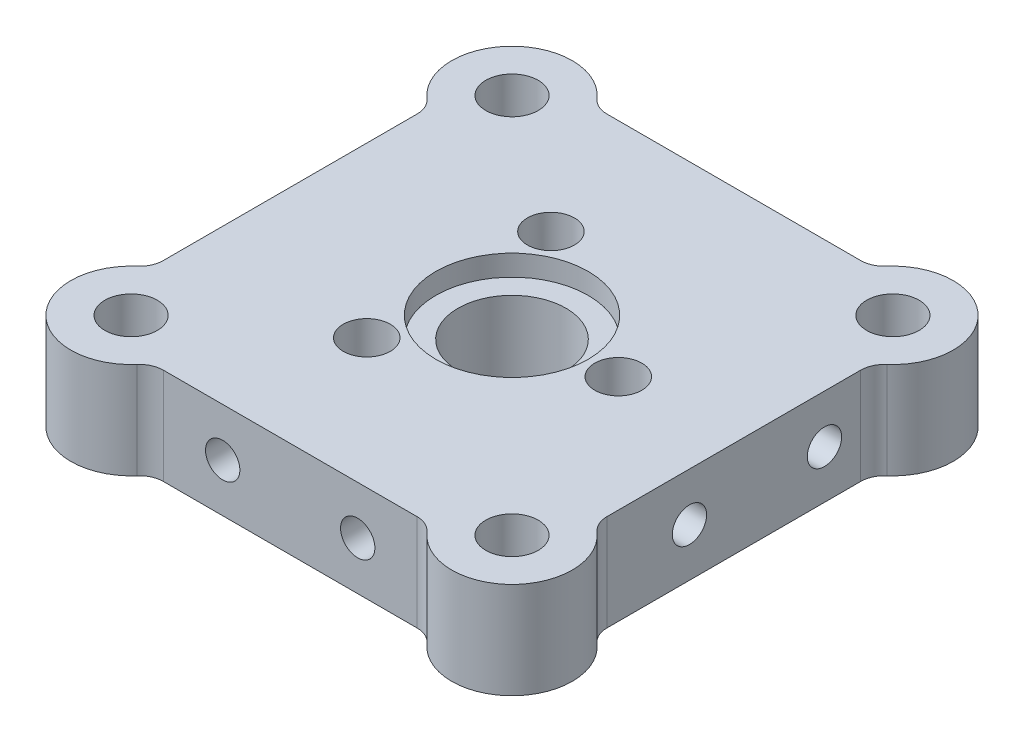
ISO-10303-21;
HEADER;
FILE_DESCRIPTION(('STEP AP214'),'2;1');
FILE_NAME('part.step','',(''),(''),'','','');
FILE_SCHEMA(('AUTOMOTIVE_DESIGN { 1 0 10303 214 1 1 1 1 }'));
ENDSEC;
DATA;
#1=APPLICATION_CONTEXT('core data for automotive mechanical design processes');
#2=APPLICATION_PROTOCOL_DEFINITION('international standard','automotive_design',2000,#1);
#3=PRODUCT_CONTEXT('',#1,'mechanical');
#4=PRODUCT('Part','Part','',(#3));
#5=PRODUCT_RELATED_PRODUCT_CATEGORY('part','',(#4));
#6=PRODUCT_DEFINITION_FORMATION('','',#4);
#7=PRODUCT_DEFINITION_CONTEXT('part definition',#1,'design');
#8=PRODUCT_DEFINITION('design','',#6,#7);
#9=PRODUCT_DEFINITION_SHAPE('','',#8);
#10=(LENGTH_UNIT() NAMED_UNIT(*) SI_UNIT(.MILLI.,.METRE.));
#11=(NAMED_UNIT(*) PLANE_ANGLE_UNIT() SI_UNIT($,.RADIAN.));
#12=(NAMED_UNIT(*) SI_UNIT($,.STERADIAN.) SOLID_ANGLE_UNIT());
#13=UNCERTAINTY_MEASURE_WITH_UNIT(LENGTH_MEASURE(1.E-05),#10,'distance_accuracy_value','');
#14=(GEOMETRIC_REPRESENTATION_CONTEXT(3) GLOBAL_UNCERTAINTY_ASSIGNED_CONTEXT((#13)) GLOBAL_UNIT_ASSIGNED_CONTEXT((#10,
#11,#12)) REPRESENTATION_CONTEXT('',''));
#15=CARTESIAN_POINT('',(0.,0.,0.));
#16=DIRECTION('',(0.,0.,1.));
#17=DIRECTION('',(1.,0.,0.));
#18=AXIS2_PLACEMENT_3D('',#15,#16,#17);
#19=CARTESIAN_POINT('',(16.5100000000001,6.35000000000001,-16.5099999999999));
#20=DIRECTION('',(0.,0.999999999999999,0.));
#21=DIRECTION('',(0.,0.,0.999999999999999));
#22=AXIS2_PLACEMENT_3D('',#19,#20,#21);
#23=PLANE('',#22);
#24=CARTESIAN_POINT('',(12.5412500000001,6.35000000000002,-12.5412499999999));
#25=DIRECTION('',(0.,0.999999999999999,0.));
#26=DIRECTION('',(0.,0.,0.999999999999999));
#27=AXIS2_PLACEMENT_3D('',#24,#25,#26);
#28=CIRCLE('',#27,1.7272);
#29=CARTESIAN_POINT('',(12.5412500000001,6.35000000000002,-10.8140499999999));
#30=VERTEX_POINT('',#29);
#31=EDGE_CURVE('E773',#30,#30,#28,.T.);
#32=ORIENTED_EDGE('',*,*,#31,.F.);
#33=EDGE_LOOP('',(#32));
#34=FACE_BOUND('',#33,.T.);
#35=CARTESIAN_POINT('',(-12.5412499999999,6.35000000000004,-12.5412499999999));
#36=DIRECTION('',(0.,0.999999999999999,0.));
#37=DIRECTION('',(0.,0.,0.999999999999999));
#38=AXIS2_PLACEMENT_3D('',#35,#36,#37);
#39=CIRCLE('',#38,1.7272);
#40=CARTESIAN_POINT('',(-12.5412499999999,6.35000000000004,-10.8140499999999));
#41=VERTEX_POINT('',#40);
#42=EDGE_CURVE('E779',#41,#41,#39,.T.);
#43=ORIENTED_EDGE('',*,*,#42,.F.);
#44=EDGE_LOOP('',(#43));
#45=FACE_BOUND('',#44,.T.);
#46=CARTESIAN_POINT('',(12.5412500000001,6.35000000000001,12.5412500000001));
#47=DIRECTION('',(0.,0.999999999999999,0.));
#48=DIRECTION('',(0.,0.,0.999999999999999));
#49=AXIS2_PLACEMENT_3D('',#46,#47,#48);
#50=CIRCLE('',#49,1.7272);
#51=CARTESIAN_POINT('',(12.5412500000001,6.35000000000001,14.2684500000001));
#52=VERTEX_POINT('',#51);
#53=EDGE_CURVE('E787',#52,#52,#50,.T.);
#54=ORIENTED_EDGE('',*,*,#53,.F.);
#55=EDGE_LOOP('',(#54));
#56=FACE_BOUND('',#55,.T.);
#57=CARTESIAN_POINT('',(-12.5412499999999,6.35000000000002,12.5412500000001));
#58=DIRECTION('',(0.,0.999999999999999,0.));
#59=DIRECTION('',(0.,0.,0.999999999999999));
#60=AXIS2_PLACEMENT_3D('',#57,#58,#59);
#61=CIRCLE('',#60,1.7272);
#62=CARTESIAN_POINT('',(-12.5412499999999,6.35000000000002,14.2684500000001));
#63=VERTEX_POINT('',#62);
#64=EDGE_CURVE('E793',#63,#63,#61,.T.);
#65=ORIENTED_EDGE('',*,*,#64,.F.);
#66=EDGE_LOOP('',(#65));
#67=FACE_BOUND('',#66,.T.);
#68=CARTESIAN_POINT('',(7.00000000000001,6.34999999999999,0.));
#69=DIRECTION('',(0.,-0.999999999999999,0.));
#70=DIRECTION('',(0.,0.,-0.999999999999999));
#71=AXIS2_PLACEMENT_3D('',#68,#69,#70);
#72=CIRCLE('',#71,1.55);
#73=CARTESIAN_POINT('',(7.00000000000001,6.34999999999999,-1.55));
#74=VERTEX_POINT('',#73);
#75=EDGE_CURVE('E404',#74,#74,#72,.T.);
#76=ORIENTED_EDGE('',*,*,#75,.T.);
#77=EDGE_LOOP('',(#76));
#78=FACE_BOUND('',#77,.T.);
#79=CARTESIAN_POINT('',(-3.50000000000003,6.35000000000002,6.06217782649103));
#80=DIRECTION('',(0.,-0.999999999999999,0.));
#81=DIRECTION('',(0.,0.,-0.999999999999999));
#82=AXIS2_PLACEMENT_3D('',#79,#80,#81);
#83=CIRCLE('',#82,1.55);
#84=CARTESIAN_POINT('',(-3.50000000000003,6.35000000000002,4.51217782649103));
#85=VERTEX_POINT('',#84);
#86=EDGE_CURVE('E416',#85,#85,#83,.T.);
#87=ORIENTED_EDGE('',*,*,#86,.T.);
#88=EDGE_LOOP('',(#87));
#89=FACE_BOUND('',#88,.T.);
#90=CARTESIAN_POINT('',(0.,6.34999999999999,0.));
#91=DIRECTION('',(0.,0.999999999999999,0.));
#92=DIRECTION('',(0.,0.,0.999999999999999));
#93=AXIS2_PLACEMENT_3D('',#90,#91,#92);
#94=CIRCLE('',#93,5.0165);
#95=CARTESIAN_POINT('',(0.,6.34999999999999,5.01649999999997));
#96=VERTEX_POINT('',#95);
#97=EDGE_CURVE('E549',#96,#96,#94,.T.);
#98=ORIENTED_EDGE('',*,*,#97,.F.);
#99=EDGE_LOOP('',(#98));
#100=FACE_BOUND('',#99,.T.);
#101=CARTESIAN_POINT('',(16.1925000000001,6.34999999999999,-8.35313735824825));
#102=DIRECTION('',(0.,0.999999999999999,0.));
#103=DIRECTION('',(0.,0.,0.999999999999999));
#104=AXIS2_PLACEMENT_3D('',#101,#102,#103);
#105=CIRCLE('',#104,1.5875);
#106=CARTESIAN_POINT('',(15.1492857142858,6.35000000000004,-9.5497409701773));
#107=VERTEX_POINT('',#106);
#108=CARTESIAN_POINT('',(14.6050000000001,6.35000000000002,-8.35313735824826));
#109=VERTEX_POINT('',#108);
#110=EDGE_CURVE('E443',#107,#109,#105,.T.);
#111=ORIENTED_EDGE('',*,*,#110,.F.);
#112=CARTESIAN_POINT('',(12.5412500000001,6.35000000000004,-12.5412499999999));
#113=DIRECTION('',(0.,0.999999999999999,0.));
#114=DIRECTION('',(0.,0.,0.999999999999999));
#115=AXIS2_PLACEMENT_3D('',#112,#113,#114);
#116=CIRCLE('',#115,3.96875);
#117=CARTESIAN_POINT('',(9.54974097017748,6.34999999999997,-15.1492857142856));
#118=VERTEX_POINT('',#117);
#119=EDGE_CURVE('E565',#107,#118,#116,.T.);
#120=ORIENTED_EDGE('',*,*,#119,.T.);
#121=CARTESIAN_POINT('',(8.35313735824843,6.35000000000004,-16.1924999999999));
#122=DIRECTION('',(0.,0.999999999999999,0.));
#123=DIRECTION('',(0.,0.,-0.999999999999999));
#124=AXIS2_PLACEMENT_3D('',#121,#122,#123);
#125=CIRCLE('',#124,1.5875);
#126=CARTESIAN_POINT('',(8.35313735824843,6.34999999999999,-14.6049999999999));
#127=VERTEX_POINT('',#126);
#128=EDGE_CURVE('E466',#127,#118,#125,.T.);
#129=ORIENTED_EDGE('',*,*,#128,.F.);
#130=DIRECTION('',(1.,0.,0.));
#131=VECTOR('',#130,1.);
#132=CARTESIAN_POINT('',(8.35313735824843,6.34999999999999,-14.6049999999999));
#133=LINE('',#132,#131);
#134=CARTESIAN_POINT('',(-8.35313735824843,6.35000000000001,-14.6049999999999));
#135=VERTEX_POINT('',#134);
#136=EDGE_CURVE('E476',#135,#127,#133,.T.);
#137=ORIENTED_EDGE('',*,*,#136,.F.);
#138=CARTESIAN_POINT('',(-8.35313735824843,6.34999999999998,-16.1924999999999));
#139=DIRECTION('',(0.,0.999999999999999,0.));
#140=DIRECTION('',(0.,0.,0.999999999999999));
#141=AXIS2_PLACEMENT_3D('',#138,#139,#140);
#142=CIRCLE('',#141,1.5875);
#143=CARTESIAN_POINT('',(-9.54974097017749,6.34999999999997,-15.1492857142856));
#144=VERTEX_POINT('',#143);
#145=EDGE_CURVE('E473',#144,#135,#142,.T.);
#146=ORIENTED_EDGE('',*,*,#145,.F.);
#147=CARTESIAN_POINT('',(-12.5412500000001,6.35000000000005,-12.5412499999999));
#148=DIRECTION('',(0.,0.999999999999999,0.));
#149=DIRECTION('',(0.,0.,0.999999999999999));
#150=AXIS2_PLACEMENT_3D('',#147,#148,#149);
#151=CIRCLE('',#150,3.96875);
#152=CARTESIAN_POINT('',(-15.1492857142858,6.35000000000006,-9.5497409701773));
#153=VERTEX_POINT('',#152);
#154=EDGE_CURVE('E563',#144,#153,#151,.T.);
#155=ORIENTED_EDGE('',*,*,#154,.T.);
#156=CARTESIAN_POINT('',(-16.1925000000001,6.35000000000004,-8.35313735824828));
#157=DIRECTION('',(0.,0.999999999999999,0.));
#158=DIRECTION('',(0.,0.,-0.999999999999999));
#159=AXIS2_PLACEMENT_3D('',#156,#157,#158);
#160=CIRCLE('',#159,1.5875);
#161=CARTESIAN_POINT('',(-14.6050000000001,6.35000000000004,-8.35313735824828));
#162=VERTEX_POINT('',#161);
#163=EDGE_CURVE('E494',#162,#153,#160,.T.);
#164=ORIENTED_EDGE('',*,*,#163,.F.);
#165=DIRECTION('',(0.,0.,-0.999999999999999));
#166=VECTOR('',#165,1.);
#167=CARTESIAN_POINT('',(-14.6050000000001,6.35000000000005,8.35313735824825));
#168=LINE('',#167,#166);
#169=CARTESIAN_POINT('',(-14.6050000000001,6.35000000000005,8.35313735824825));
#170=VERTEX_POINT('',#169);
#171=EDGE_CURVE('E504',#170,#162,#168,.T.);
#172=ORIENTED_EDGE('',*,*,#171,.F.);
#173=CARTESIAN_POINT('',(-16.1925000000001,6.35000000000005,8.35313735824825));
#174=DIRECTION('',(0.,0.999999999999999,0.));
#175=DIRECTION('',(0.,0.,0.999999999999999));
#176=AXIS2_PLACEMENT_3D('',#173,#174,#175);
#177=CIRCLE('',#176,1.5875);
#178=CARTESIAN_POINT('',(-15.1492857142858,6.34999999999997,9.54974097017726));
#179=VERTEX_POINT('',#178);
#180=EDGE_CURVE('E501',#179,#170,#177,.T.);
#181=ORIENTED_EDGE('',*,*,#180,.F.);
#182=CARTESIAN_POINT('',(-12.5412500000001,6.35000000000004,12.5412499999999));
#183=DIRECTION('',(0.,0.999999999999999,0.));
#184=DIRECTION('',(0.,0.,0.999999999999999));
#185=AXIS2_PLACEMENT_3D('',#182,#183,#184);
#186=CIRCLE('',#185,3.96875);
#187=CARTESIAN_POINT('',(-9.54974097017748,6.34999999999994,15.1492857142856));
#188=VERTEX_POINT('',#187);
#189=EDGE_CURVE('E567',#179,#188,#186,.T.);
#190=ORIENTED_EDGE('',*,*,#189,.T.);
#191=CARTESIAN_POINT('',(-8.35313735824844,6.34999999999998,16.1924999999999));
#192=DIRECTION('',(0.,0.999999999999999,0.));
#193=DIRECTION('',(0.,0.,-0.999999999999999));
#194=AXIS2_PLACEMENT_3D('',#191,#192,#193);
#195=CIRCLE('',#194,1.5875);
#196=CARTESIAN_POINT('',(-8.35313735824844,6.34999999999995,14.6049999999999));
#197=VERTEX_POINT('',#196);
#198=EDGE_CURVE('E522',#197,#188,#195,.T.);
#199=ORIENTED_EDGE('',*,*,#198,.F.);
#200=DIRECTION('',(-1.,0.,0.));
#201=VECTOR('',#200,1.);
#202=CARTESIAN_POINT('',(8.35313735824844,6.34999999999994,14.6049999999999));
#203=LINE('',#202,#201);
#204=CARTESIAN_POINT('',(8.35313735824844,6.34999999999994,14.6049999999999));
#205=VERTEX_POINT('',#204);
#206=EDGE_CURVE('E531',#205,#197,#203,.T.);
#207=ORIENTED_EDGE('',*,*,#206,.F.);
#208=CARTESIAN_POINT('',(8.35313735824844,6.34999999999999,16.1924999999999));
#209=DIRECTION('',(0.,0.999999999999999,0.));
#210=DIRECTION('',(0.,0.,0.999999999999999));
#211=AXIS2_PLACEMENT_3D('',#208,#209,#210);
#212=CIRCLE('',#211,1.5875);
#213=CARTESIAN_POINT('',(9.54974097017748,6.34999999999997,15.1492857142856));
#214=VERTEX_POINT('',#213);
#215=EDGE_CURVE('E431',#214,#205,#212,.T.);
#216=ORIENTED_EDGE('',*,*,#215,.F.);
#217=CARTESIAN_POINT('',(12.5412500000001,6.34999999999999,12.5412499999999));
#218=DIRECTION('',(0.,0.999999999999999,0.));
#219=DIRECTION('',(0.,0.,0.999999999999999));
#220=AXIS2_PLACEMENT_3D('',#217,#218,#219);
#221=CIRCLE('',#220,3.96875);
#222=CARTESIAN_POINT('',(15.1492857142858,6.34999999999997,9.54974097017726));
#223=VERTEX_POINT('',#222);
#224=EDGE_CURVE('E568',#214,#223,#221,.T.);
#225=ORIENTED_EDGE('',*,*,#224,.T.);
#226=CARTESIAN_POINT('',(16.1925000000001,6.35000000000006,8.35313735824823));
#227=DIRECTION('',(0.,0.999999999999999,0.));
#228=DIRECTION('',(0.,0.,-0.999999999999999));
#229=AXIS2_PLACEMENT_3D('',#226,#227,#228);
#230=CIRCLE('',#229,1.5875);
#231=CARTESIAN_POINT('',(14.6050000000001,6.35000000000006,8.35313735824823));
#232=VERTEX_POINT('',#231);
#233=EDGE_CURVE('E436',#232,#223,#230,.T.);
#234=ORIENTED_EDGE('',*,*,#233,.F.);
#235=DIRECTION('',(0.,0.,0.999999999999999));
#236=VECTOR('',#235,1.);
#237=CARTESIAN_POINT('',(14.6050000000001,6.35000000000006,8.35313735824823));
#238=LINE('',#237,#236);
#239=EDGE_CURVE('E446',#109,#232,#238,.T.);
#240=ORIENTED_EDGE('',*,*,#239,.F.);
#241=EDGE_LOOP('',(#111,#120,#129,#137,#146,#155,#164,#172,#181,#190,#199,#207,#216,#225,#234,#240));
#242=FACE_BOUND('',#241,.T.);
#243=CARTESIAN_POINT('',(-3.50000000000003,6.34999999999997,-6.06217782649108));
#244=DIRECTION('',(0.,-0.999999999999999,0.));
#245=DIRECTION('',(0.,0.,-0.999999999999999));
#246=AXIS2_PLACEMENT_3D('',#243,#244,#245);
#247=CIRCLE('',#246,1.55);
#248=CARTESIAN_POINT('',(-3.50000000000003,6.34999999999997,-7.61217782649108));
#249=VERTEX_POINT('',#248);
#250=EDGE_CURVE('E428',#249,#249,#247,.T.);
#251=ORIENTED_EDGE('',*,*,#250,.T.);
#252=EDGE_LOOP('',(#251));
#253=FACE_BOUND('',#252,.T.);
#254=ADVANCED_FACE('F50',(#34,#45,#56,#67,#78,#89,#100,#242,#253),#23,.T.);
#255=CARTESIAN_POINT('',(16.5100000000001,0.,-16.5099999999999));
#256=DIRECTION('',(0.,0.999999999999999,0.));
#257=DIRECTION('',(0.,0.,0.999999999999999));
#258=AXIS2_PLACEMENT_3D('',#255,#256,#257);
#259=PLANE('',#258);
#260=CARTESIAN_POINT('',(12.5412500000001,0.,-12.5412499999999));
#261=DIRECTION('',(0.,0.999999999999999,0.));
#262=DIRECTION('',(0.,0.,0.999999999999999));
#263=AXIS2_PLACEMENT_3D('',#260,#261,#262);
#264=CIRCLE('',#263,1.7272);
#265=CARTESIAN_POINT('',(12.5412500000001,0.,-10.8140499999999));
#266=VERTEX_POINT('',#265);
#267=EDGE_CURVE('E775',#266,#266,#264,.T.);
#268=ORIENTED_EDGE('',*,*,#267,.T.);
#269=EDGE_LOOP('',(#268));
#270=FACE_BOUND('',#269,.T.);
#271=CARTESIAN_POINT('',(-12.5412499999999,0.,-12.5412499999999));
#272=DIRECTION('',(0.,0.999999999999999,0.));
#273=DIRECTION('',(0.,0.,0.999999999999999));
#274=AXIS2_PLACEMENT_3D('',#271,#272,#273);
#275=CIRCLE('',#274,1.7272);
#276=CARTESIAN_POINT('',(-12.5412499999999,0.,-10.8140499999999));
#277=VERTEX_POINT('',#276);
#278=EDGE_CURVE('E784',#277,#277,#275,.T.);
#279=ORIENTED_EDGE('',*,*,#278,.T.);
#280=EDGE_LOOP('',(#279));
#281=FACE_BOUND('',#280,.T.);
#282=CARTESIAN_POINT('',(12.5412500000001,0.,12.5412500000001));
#283=DIRECTION('',(0.,0.999999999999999,0.));
#284=DIRECTION('',(0.,0.,0.999999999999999));
#285=AXIS2_PLACEMENT_3D('',#282,#283,#284);
#286=CIRCLE('',#285,1.7272);
#287=CARTESIAN_POINT('',(12.5412500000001,0.,14.2684500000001));
#288=VERTEX_POINT('',#287);
#289=EDGE_CURVE('E790',#288,#288,#286,.T.);
#290=ORIENTED_EDGE('',*,*,#289,.T.);
#291=EDGE_LOOP('',(#290));
#292=FACE_BOUND('',#291,.T.);
#293=CARTESIAN_POINT('',(-12.5412499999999,0.,12.5412500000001));
#294=DIRECTION('',(0.,0.999999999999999,0.));
#295=DIRECTION('',(0.,0.,0.999999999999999));
#296=AXIS2_PLACEMENT_3D('',#293,#294,#295);
#297=CIRCLE('',#296,1.7272);
#298=CARTESIAN_POINT('',(-12.5412499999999,0.,14.2684500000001));
#299=VERTEX_POINT('',#298);
#300=EDGE_CURVE('E796',#299,#299,#297,.T.);
#301=ORIENTED_EDGE('',*,*,#300,.T.);
#302=EDGE_LOOP('',(#301));
#303=FACE_BOUND('',#302,.T.);
#304=CARTESIAN_POINT('',(7.00000000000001,0.,0.));
#305=DIRECTION('',(0.,-0.999999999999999,0.));
#306=DIRECTION('',(0.,0.,-0.999999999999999));
#307=AXIS2_PLACEMENT_3D('',#304,#305,#306);
#308=CIRCLE('',#307,2.74999999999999);
#309=CARTESIAN_POINT('',(7.00000000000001,0.,-2.74999999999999));
#310=VERTEX_POINT('',#309);
#311=EDGE_CURVE('E395',#310,#310,#308,.T.);
#312=ORIENTED_EDGE('',*,*,#311,.F.);
#313=EDGE_LOOP('',(#312));
#314=FACE_BOUND('',#313,.T.);
#315=CARTESIAN_POINT('',(-3.50000000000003,0.,6.06217782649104));
#316=DIRECTION('',(0.,-0.999999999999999,0.));
#317=DIRECTION('',(0.,0.,-0.999999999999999));
#318=AXIS2_PLACEMENT_3D('',#315,#316,#317);
#319=CIRCLE('',#318,2.75);
#320=CARTESIAN_POINT('',(-3.50000000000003,0.,3.31217782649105));
#321=VERTEX_POINT('',#320);
#322=EDGE_CURVE('E407',#321,#321,#319,.T.);
#323=ORIENTED_EDGE('',*,*,#322,.F.);
#324=EDGE_LOOP('',(#323));
#325=FACE_BOUND('',#324,.T.);
#326=CARTESIAN_POINT('',(12.5412500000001,0.,-12.5412499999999));
#327=DIRECTION('',(0.,0.999999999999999,0.));
#328=DIRECTION('',(0.,0.,0.999999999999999));
#329=AXIS2_PLACEMENT_3D('',#326,#327,#328);
#330=CIRCLE('',#329,3.96875);
#331=CARTESIAN_POINT('',(9.54974097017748,0.,-15.1492857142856));
#332=VERTEX_POINT('',#331);
#333=CARTESIAN_POINT('',(15.1492857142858,0.,-9.54974097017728));
#334=VERTEX_POINT('',#333);
#335=EDGE_CURVE('E557',#332,#334,#330,.F.);
#336=ORIENTED_EDGE('',*,*,#335,.T.);
#337=CARTESIAN_POINT('',(16.1925000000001,0.,-8.35313735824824));
#338=DIRECTION('',(0.,0.999999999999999,0.));
#339=DIRECTION('',(0.,0.,0.999999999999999));
#340=AXIS2_PLACEMENT_3D('',#337,#338,#339);
#341=CIRCLE('',#340,1.5875);
#342=CARTESIAN_POINT('',(14.6050000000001,0.,-8.35313735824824));
#343=VERTEX_POINT('',#342);
#344=EDGE_CURVE('E432',#334,#343,#341,.T.);
#345=ORIENTED_EDGE('',*,*,#344,.T.);
#346=DIRECTION('',(0.,0.,0.999999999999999));
#347=VECTOR('',#346,1.);
#348=CARTESIAN_POINT('',(14.6050000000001,0.,8.35313735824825));
#349=LINE('',#348,#347);
#350=CARTESIAN_POINT('',(14.6050000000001,0.,8.35313735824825));
#351=VERTEX_POINT('',#350);
#352=EDGE_CURVE('E435',#343,#351,#349,.T.);
#353=ORIENTED_EDGE('',*,*,#352,.T.);
#354=CARTESIAN_POINT('',(16.1925000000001,0.,8.35313735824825));
#355=DIRECTION('',(0.,0.999999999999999,0.));
#356=DIRECTION('',(0.,0.,-0.999999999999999));
#357=AXIS2_PLACEMENT_3D('',#354,#355,#356);
#358=CIRCLE('',#357,1.5875);
#359=CARTESIAN_POINT('',(15.1492857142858,0.,9.5497409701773));
#360=VERTEX_POINT('',#359);
#361=EDGE_CURVE('E439',#351,#360,#358,.T.);
#362=ORIENTED_EDGE('',*,*,#361,.T.);
#363=CARTESIAN_POINT('',(12.5412500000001,0.,12.5412499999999));
#364=DIRECTION('',(0.,0.999999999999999,0.));
#365=DIRECTION('',(0.,0.,0.999999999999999));
#366=AXIS2_PLACEMENT_3D('',#363,#364,#365);
#367=CIRCLE('',#366,3.96875);
#368=CARTESIAN_POINT('',(9.54974097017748,0.,15.1492857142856));
#369=VERTEX_POINT('',#368);
#370=EDGE_CURVE('E561',#360,#369,#367,.F.);
#371=ORIENTED_EDGE('',*,*,#370,.T.);
#372=CARTESIAN_POINT('',(8.35313735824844,0.,16.1924999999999));
#373=DIRECTION('',(0.,0.999999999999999,0.));
#374=DIRECTION('',(0.,0.,0.999999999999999));
#375=AXIS2_PLACEMENT_3D('',#372,#373,#374);
#376=CIRCLE('',#375,1.5875);
#377=CARTESIAN_POINT('',(8.35313735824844,0.,14.6049999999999));
#378=VERTEX_POINT('',#377);
#379=EDGE_CURVE('E518',#369,#378,#376,.T.);
#380=ORIENTED_EDGE('',*,*,#379,.T.);
#381=DIRECTION('',(-1.,0.,0.));
#382=VECTOR('',#381,1.);
#383=CARTESIAN_POINT('',(8.35313735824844,0.,14.6049999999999));
#384=LINE('',#383,#382);
#385=CARTESIAN_POINT('',(-8.35313735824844,0.,14.6049999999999));
#386=VERTEX_POINT('',#385);
#387=EDGE_CURVE('E521',#378,#386,#384,.T.);
#388=ORIENTED_EDGE('',*,*,#387,.T.);
#389=CARTESIAN_POINT('',(-8.35313735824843,0.,16.1924999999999));
#390=DIRECTION('',(0.,0.999999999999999,0.));
#391=DIRECTION('',(0.,0.,-0.999999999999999));
#392=AXIS2_PLACEMENT_3D('',#389,#390,#391);
#393=CIRCLE('',#392,1.5875);
#394=CARTESIAN_POINT('',(-9.54974097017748,0.,15.1492857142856));
#395=VERTEX_POINT('',#394);
#396=EDGE_CURVE('E525',#386,#395,#393,.T.);
#397=ORIENTED_EDGE('',*,*,#396,.T.);
#398=CARTESIAN_POINT('',(-12.5412500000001,0.,12.5412499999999));
#399=DIRECTION('',(0.,0.999999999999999,0.));
#400=DIRECTION('',(0.,0.,0.999999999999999));
#401=AXIS2_PLACEMENT_3D('',#398,#399,#400);
#402=CIRCLE('',#401,3.96875);
#403=CARTESIAN_POINT('',(-15.1492857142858,0.,9.54974097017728));
#404=VERTEX_POINT('',#403);
#405=EDGE_CURVE('E559',#395,#404,#402,.F.);
#406=ORIENTED_EDGE('',*,*,#405,.T.);
#407=CARTESIAN_POINT('',(-16.1925000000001,0.,8.35313735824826));
#408=DIRECTION('',(0.,0.999999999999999,0.));
#409=DIRECTION('',(0.,0.,0.999999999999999));
#410=AXIS2_PLACEMENT_3D('',#407,#408,#409);
#411=CIRCLE('',#410,1.5875);
#412=CARTESIAN_POINT('',(-14.6050000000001,0.,8.35313735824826));
#413=VERTEX_POINT('',#412);
#414=EDGE_CURVE('E490',#404,#413,#411,.T.);
#415=ORIENTED_EDGE('',*,*,#414,.T.);
#416=DIRECTION('',(0.,0.,-0.999999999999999));
#417=VECTOR('',#416,1.);
#418=CARTESIAN_POINT('',(-14.6050000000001,0.,8.35313735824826));
#419=LINE('',#418,#417);
#420=CARTESIAN_POINT('',(-14.6050000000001,0.,-8.35313735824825));
#421=VERTEX_POINT('',#420);
#422=EDGE_CURVE('E493',#413,#421,#419,.T.);
#423=ORIENTED_EDGE('',*,*,#422,.T.);
#424=CARTESIAN_POINT('',(-16.1925000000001,0.,-8.35313735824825));
#425=DIRECTION('',(0.,0.999999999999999,0.));
#426=DIRECTION('',(0.,0.,-0.999999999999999));
#427=AXIS2_PLACEMENT_3D('',#424,#425,#426);
#428=CIRCLE('',#427,1.5875);
#429=CARTESIAN_POINT('',(-15.1492857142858,0.,-9.54974097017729));
#430=VERTEX_POINT('',#429);
#431=EDGE_CURVE('E497',#421,#430,#428,.T.);
#432=ORIENTED_EDGE('',*,*,#431,.T.);
#433=CARTESIAN_POINT('',(-12.5412500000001,0.,-12.5412499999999));
#434=DIRECTION('',(0.,0.999999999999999,0.));
#435=DIRECTION('',(0.,0.,0.999999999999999));
#436=AXIS2_PLACEMENT_3D('',#433,#434,#435);
#437=CIRCLE('',#436,3.96875);
#438=CARTESIAN_POINT('',(-9.54974097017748,0.,-15.1492857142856));
#439=VERTEX_POINT('',#438);
#440=EDGE_CURVE('E553',#430,#439,#437,.F.);
#441=ORIENTED_EDGE('',*,*,#440,.T.);
#442=CARTESIAN_POINT('',(-8.35313735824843,0.,-16.1924999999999));
#443=DIRECTION('',(0.,0.999999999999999,0.));
#444=DIRECTION('',(0.,0.,0.999999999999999));
#445=AXIS2_PLACEMENT_3D('',#442,#443,#444);
#446=CIRCLE('',#445,1.5875);
#447=CARTESIAN_POINT('',(-8.35313735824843,0.,-14.6049999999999));
#448=VERTEX_POINT('',#447);
#449=EDGE_CURVE('E462',#439,#448,#446,.T.);
#450=ORIENTED_EDGE('',*,*,#449,.T.);
#451=DIRECTION('',(1.,0.,0.));
#452=VECTOR('',#451,1.);
#453=CARTESIAN_POINT('',(8.35313735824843,0.,-14.6049999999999));
#454=LINE('',#453,#452);
#455=CARTESIAN_POINT('',(8.35313735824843,0.,-14.6049999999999));
#456=VERTEX_POINT('',#455);
#457=EDGE_CURVE('E465',#448,#456,#454,.T.);
#458=ORIENTED_EDGE('',*,*,#457,.T.);
#459=CARTESIAN_POINT('',(8.35313735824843,0.,-16.1924999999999));
#460=DIRECTION('',(0.,0.999999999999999,0.));
#461=DIRECTION('',(0.,0.,-0.999999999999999));
#462=AXIS2_PLACEMENT_3D('',#459,#460,#461);
#463=CIRCLE('',#462,1.5875);
#464=EDGE_CURVE('E469',#456,#332,#463,.T.);
#465=ORIENTED_EDGE('',*,*,#464,.T.);
#466=EDGE_LOOP('',(#336,#345,#353,#362,#371,#380,#388,#397,#406,#415,#423,#432,#441,#450,#458,#465));
#467=FACE_BOUND('',#466,.T.);
#468=CARTESIAN_POINT('',(0.,0.,0.));
#469=DIRECTION('',(0.,0.999999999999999,0.));
#470=DIRECTION('',(0.,0.,0.999999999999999));
#471=AXIS2_PLACEMENT_3D('',#468,#469,#470);
#472=CIRCLE('',#471,3.556);
#473=CARTESIAN_POINT('',(-3.556,0.,0.));
#474=VERTEX_POINT('',#473);
#475=EDGE_CURVE('E546',#474,#474,#472,.F.);
#476=ORIENTED_EDGE('',*,*,#475,.F.);
#477=EDGE_LOOP('',(#476));
#478=FACE_BOUND('',#477,.T.);
#479=CARTESIAN_POINT('',(-3.50000000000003,0.,-6.06217782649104));
#480=DIRECTION('',(0.,-0.999999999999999,0.));
#481=DIRECTION('',(0.,0.,-0.999999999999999));
#482=AXIS2_PLACEMENT_3D('',#479,#480,#481);
#483=CIRCLE('',#482,2.75);
#484=CARTESIAN_POINT('',(-3.50000000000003,0.,-8.81217782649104));
#485=VERTEX_POINT('',#484);
#486=EDGE_CURVE('E419',#485,#485,#483,.T.);
#487=ORIENTED_EDGE('',*,*,#486,.F.);
#488=EDGE_LOOP('',(#487));
#489=FACE_BOUND('',#488,.T.);
#490=ADVANCED_FACE('F683',(#270,#281,#292,#303,#314,#325,#467,#478,#489),#259,.F.);
#491=CARTESIAN_POINT('',(0.,4.97840000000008,0.));
#492=DIRECTION('',(0.,0.999999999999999,0.));
#493=DIRECTION('',(0.,0.,0.999999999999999));
#494=AXIS2_PLACEMENT_3D('',#491,#492,#493);
#495=CYLINDRICAL_SURFACE('',#494,5.0165);
#496=CARTESIAN_POINT('',(0.,4.97840000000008,0.));
#497=DIRECTION('',(0.,0.999999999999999,0.));
#498=DIRECTION('',(0.,0.,0.999999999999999));
#499=AXIS2_PLACEMENT_3D('',#496,#497,#498);
#500=CIRCLE('',#499,5.0165);
#501=CARTESIAN_POINT('',(0.,4.97840000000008,5.01649999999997));
#502=VERTEX_POINT('',#501);
#503=EDGE_CURVE('E550',#502,#502,#500,.T.);
#504=CARTESIAN_POINT('',(0.,4.97840000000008,5.01649999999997));
#505=CARTESIAN_POINT('',(0.,4.99268750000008,5.01649999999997));
#506=CARTESIAN_POINT('',(0.,5.00697500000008,5.01649999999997));
#507=CARTESIAN_POINT('',(0.,5.03555000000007,5.01649999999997));
#508=CARTESIAN_POINT('',(0.,5.04983750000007,5.01649999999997));
#509=CARTESIAN_POINT('',(0.,5.07841250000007,5.01649999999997));
#510=CARTESIAN_POINT('',(0.,5.09270000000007,5.01649999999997));
#511=CARTESIAN_POINT('',(0.,5.12127500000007,5.01649999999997));
#512=CARTESIAN_POINT('',(0.,5.13556250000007,5.01649999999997));
#513=CARTESIAN_POINT('',(0.,5.16413750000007,5.01649999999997));
#514=CARTESIAN_POINT('',(0.,5.17842500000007,5.01649999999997));
#515=CARTESIAN_POINT('',(0.,5.20700000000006,5.01649999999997));
#516=CARTESIAN_POINT('',(0.,5.22128750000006,5.01649999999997));
#517=CARTESIAN_POINT('',(0.,5.24986250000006,5.01649999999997));
#518=CARTESIAN_POINT('',(0.,5.26415000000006,5.01649999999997));
#519=CARTESIAN_POINT('',(0.,5.29272500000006,5.01649999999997));
#520=CARTESIAN_POINT('',(0.,5.30701250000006,5.01649999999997));
#521=CARTESIAN_POINT('',(0.,5.33558750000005,5.01649999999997));
#522=CARTESIAN_POINT('',(0.,5.34987500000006,5.01649999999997));
#523=CARTESIAN_POINT('',(0.,5.37845000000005,5.01649999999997));
#524=CARTESIAN_POINT('',(0.,5.39273750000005,5.01649999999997));
#525=CARTESIAN_POINT('',(0.,5.42131250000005,5.01649999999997));
#526=CARTESIAN_POINT('',(0.,5.43560000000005,5.01649999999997));
#527=CARTESIAN_POINT('',(0.,5.46417500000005,5.01649999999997));
#528=CARTESIAN_POINT('',(0.,5.47846250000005,5.01649999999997));
#529=CARTESIAN_POINT('',(0.,5.50703750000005,5.01649999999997));
#530=CARTESIAN_POINT('',(0.,5.52132500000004,5.01649999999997));
#531=CARTESIAN_POINT('',(0.,5.54990000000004,5.01649999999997));
#532=CARTESIAN_POINT('',(0.,5.56418750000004,5.01649999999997));
#533=CARTESIAN_POINT('',(0.,5.59276250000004,5.01649999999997));
#534=CARTESIAN_POINT('',(0.,5.60705000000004,5.01649999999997));
#535=CARTESIAN_POINT('',(0.,5.63562500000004,5.01649999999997));
#536=CARTESIAN_POINT('',(0.,5.64991250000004,5.01649999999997));
#537=CARTESIAN_POINT('',(0.,5.67848750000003,5.01649999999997));
#538=CARTESIAN_POINT('',(0.,5.69277500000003,5.01649999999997));
#539=CARTESIAN_POINT('',(0.,5.72135000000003,5.01649999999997));
#540=CARTESIAN_POINT('',(0.,5.73563750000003,5.01649999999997));
#541=CARTESIAN_POINT('',(0.,5.76421250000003,5.01649999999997));
#542=CARTESIAN_POINT('',(0.,5.77850000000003,5.01649999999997));
#543=CARTESIAN_POINT('',(0.,5.80707500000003,5.01649999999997));
#544=CARTESIAN_POINT('',(0.,5.82136250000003,5.01649999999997));
#545=CARTESIAN_POINT('',(0.,5.84993750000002,5.01649999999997));
#546=CARTESIAN_POINT('',(0.,5.86422500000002,5.01649999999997));
#547=CARTESIAN_POINT('',(0.,5.89280000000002,5.01649999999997));
#548=CARTESIAN_POINT('',(0.,5.90708750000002,5.01649999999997));
#549=CARTESIAN_POINT('',(0.,5.93566250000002,5.01649999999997));
#550=CARTESIAN_POINT('',(0.,5.94995000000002,5.01649999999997));
#551=CARTESIAN_POINT('',(0.,5.97852500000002,5.01649999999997));
#552=CARTESIAN_POINT('',(0.,5.99281250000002,5.01649999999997));
#553=CARTESIAN_POINT('',(0.,6.02138750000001,5.01649999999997));
#554=CARTESIAN_POINT('',(0.,6.03567500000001,5.01649999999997));
#555=CARTESIAN_POINT('',(0.,6.06425000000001,5.01649999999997));
#556=CARTESIAN_POINT('',(0.,6.07853750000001,5.01649999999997));
#557=CARTESIAN_POINT('',(0.,6.10711250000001,5.01649999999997));
#558=CARTESIAN_POINT('',(0.,6.12140000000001,5.01649999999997));
#559=CARTESIAN_POINT('',(0.,6.14997500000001,5.01649999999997));
#560=CARTESIAN_POINT('',(0.,6.16426250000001,5.01649999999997));
#561=CARTESIAN_POINT('',(0.,6.1928375,5.01649999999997));
#562=CARTESIAN_POINT('',(0.,6.207125,5.01649999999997));
#563=CARTESIAN_POINT('',(0.,6.2357,5.01649999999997));
#564=CARTESIAN_POINT('',(0.,6.2499875,5.01649999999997));
#565=CARTESIAN_POINT('',(0.,6.2785625,5.01649999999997));
#566=CARTESIAN_POINT('',(0.,6.29285,5.01649999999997));
#567=CARTESIAN_POINT('',(0.,6.321425,5.01649999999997));
#568=CARTESIAN_POINT('',(0.,6.3357125,5.01649999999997));
#569=CARTESIAN_POINT('',(0.,6.34999999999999,5.01649999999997));
#570=B_SPLINE_CURVE_WITH_KNOTS('',3,(#504,#505,#506,#507,#508,#509,#510,#511,#512,#513,#514,
#515,#516,#517,#518,#519,#520,#521,#522,#523,#524,#525,#526,#527,#528,#529,#530,#531,#532,#533,
#534,#535,#536,#537,#538,#539,#540,#541,#542,#543,#544,#545,#546,#547,#548,#549,#550,#551,#552,
#553,#554,#555,#556,#557,#558,#559,#560,#561,#562,#563,#564,#565,#566,#567,#568,#569),
.UNSPECIFIED.,.F.,.F.,(4,2,2,2,2,2,2,2,2,2,2,2,2,2,2,2,2,2,2,2,2,2,2,2,2,2,2,2,2,2,2,2,4),(0.,
0.0428624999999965,0.085724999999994,0.128587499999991,0.171449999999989,0.214312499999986,
0.257174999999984,0.300037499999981,0.342899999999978,0.385762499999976,0.428624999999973,
0.471487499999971,0.514349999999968,0.557212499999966,0.600074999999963,0.64293749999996,
0.685799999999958,0.728662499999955,0.771524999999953,0.81438749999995,0.857249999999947,
0.900112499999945,0.942974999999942,0.98583749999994,1.02869999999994,1.07156249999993,
1.11442499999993,1.15728749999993,1.20014999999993,1.24301249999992,1.28587499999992,
1.32873749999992,1.37159999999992),.UNSPECIFIED.);
#571=EDGE_CURVE('BSEAM679',#502,#96,#570,.T.);
#572=ORIENTED_EDGE('',*,*,#503,.F.);
#573=ORIENTED_EDGE('',*,*,#97,.T.);
#574=ORIENTED_EDGE('',*,*,#571,.T.);
#575=ORIENTED_EDGE('',*,*,#571,.F.);
#576=EDGE_LOOP('',(#572,#574,#573,#575));
#577=FACE_BOUND('',#576,.T.);
#578=ADVANCED_FACE('F679',(#577),#495,.F.);
#579=CARTESIAN_POINT('',(0.,4.97840000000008,0.));
#580=DIRECTION('',(0.,0.999999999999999,0.));
#581=DIRECTION('',(0.,0.,0.999999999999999));
#582=AXIS2_PLACEMENT_3D('',#579,#580,#581);
#583=PLANE('',#582);
#584=CARTESIAN_POINT('',(0.,4.97840000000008,0.));
#585=DIRECTION('',(0.,0.999999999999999,0.));
#586=DIRECTION('',(-1.,0.,0.));
#587=AXIS2_PLACEMENT_3D('',#584,#585,#586);
#588=CIRCLE('',#587,3.556);
#589=CARTESIAN_POINT('',(-3.556,4.97840000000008,0.));
#590=VERTEX_POINT('',#589);
#591=EDGE_CURVE('E455',#590,#590,#588,.T.);
#592=ORIENTED_EDGE('',*,*,#591,.F.);
#593=EDGE_LOOP('',(#592));
#594=FACE_BOUND('',#593,.T.);
#595=ORIENTED_EDGE('',*,*,#503,.T.);
#596=EDGE_LOOP('',(#595));
#597=FACE_BOUND('',#596,.T.);
#598=ADVANCED_FACE('F675',(#594,#597),#583,.T.);
#599=CARTESIAN_POINT('',(0.,-0.000999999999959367,0.));
#600=DIRECTION('',(0.,0.999999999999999,0.));
#601=DIRECTION('',(-1.,0.,0.));
#602=AXIS2_PLACEMENT_3D('',#599,#600,#601);
#603=CYLINDRICAL_SURFACE('',#602,3.556);
#604=CARTESIAN_POINT('',(-3.556,4.97840000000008,0.));
#605=CARTESIAN_POINT('',(-3.556,4.92654166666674,0.));
#606=CARTESIAN_POINT('',(-3.556,4.87468333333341,0.));
#607=CARTESIAN_POINT('',(-3.556,4.77096666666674,0.));
#608=CARTESIAN_POINT('',(-3.556,4.71910833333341,0.));
#609=CARTESIAN_POINT('',(-3.556,4.61539166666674,0.));
#610=CARTESIAN_POINT('',(-3.556,4.5635333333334,0.));
#611=CARTESIAN_POINT('',(-3.556,4.45981666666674,0.));
#612=CARTESIAN_POINT('',(-3.556,4.4079583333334,0.));
#613=CARTESIAN_POINT('',(-3.556,4.30424166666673,0.));
#614=CARTESIAN_POINT('',(-3.556,4.2523833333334,0.));
#615=CARTESIAN_POINT('',(-3.556,4.14866666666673,0.));
#616=CARTESIAN_POINT('',(-3.556,4.0968083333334,0.));
#617=CARTESIAN_POINT('',(-3.556,3.99309166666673,0.));
#618=CARTESIAN_POINT('',(-3.556,3.94123333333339,0.));
#619=CARTESIAN_POINT('',(-3.556,3.83751666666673,0.));
#620=CARTESIAN_POINT('',(-3.556,3.78565833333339,0.));
#621=CARTESIAN_POINT('',(-3.556,3.68194166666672,0.));
#622=CARTESIAN_POINT('',(-3.556,3.63008333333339,0.));
#623=CARTESIAN_POINT('',(-3.556,3.52636666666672,0.));
#624=CARTESIAN_POINT('',(-3.556,3.47450833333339,0.));
#625=CARTESIAN_POINT('',(-3.556,3.37079166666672,0.));
#626=CARTESIAN_POINT('',(-3.556,3.31893333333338,0.));
#627=CARTESIAN_POINT('',(-3.556,3.21521666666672,0.));
#628=CARTESIAN_POINT('',(-3.556,3.16335833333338,0.));
#629=CARTESIAN_POINT('',(-3.556,3.05964166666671,0.));
#630=CARTESIAN_POINT('',(-3.556,3.00778333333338,0.));
#631=CARTESIAN_POINT('',(-3.556,2.90406666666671,0.));
#632=CARTESIAN_POINT('',(-3.556,2.85220833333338,0.));
#633=CARTESIAN_POINT('',(-3.556,2.74849166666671,0.));
#634=CARTESIAN_POINT('',(-3.556,2.69663333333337,0.));
#635=CARTESIAN_POINT('',(-3.556,2.59291666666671,0.));
#636=CARTESIAN_POINT('',(-3.556,2.54105833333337,0.));
#637=CARTESIAN_POINT('',(-3.556,2.4373416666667,0.));
#638=CARTESIAN_POINT('',(-3.556,2.38548333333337,0.));
#639=CARTESIAN_POINT('',(-3.556,2.2817666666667,0.));
#640=CARTESIAN_POINT('',(-3.556,2.22990833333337,0.));
#641=CARTESIAN_POINT('',(-3.556,2.1261916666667,0.));
#642=CARTESIAN_POINT('',(-3.556,2.07433333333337,0.));
#643=CARTESIAN_POINT('',(-3.556,1.9706166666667,0.));
#644=CARTESIAN_POINT('',(-3.556,1.91875833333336,0.));
#645=CARTESIAN_POINT('',(-3.556,1.8150416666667,0.));
#646=CARTESIAN_POINT('',(-3.556,1.76318333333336,0.));
#647=CARTESIAN_POINT('',(-3.556,1.65946666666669,0.));
#648=CARTESIAN_POINT('',(-3.556,1.60760833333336,0.));
#649=CARTESIAN_POINT('',(-3.556,1.50389166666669,0.));
#650=CARTESIAN_POINT('',(-3.556,1.45203333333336,0.));
#651=CARTESIAN_POINT('',(-3.556,1.34831666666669,0.));
#652=CARTESIAN_POINT('',(-3.556,1.29645833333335,0.));
#653=CARTESIAN_POINT('',(-3.556,1.19274166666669,0.));
#654=CARTESIAN_POINT('',(-3.556,1.14088333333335,0.));
#655=CARTESIAN_POINT('',(-3.556,1.03716666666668,0.));
#656=CARTESIAN_POINT('',(-3.556,0.985308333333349,0.));
#657=CARTESIAN_POINT('',(-3.556,0.881591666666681,0.));
#658=CARTESIAN_POINT('',(-3.556,0.829733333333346,0.));
#659=CARTESIAN_POINT('',(-3.556,0.726016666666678,0.));
#660=CARTESIAN_POINT('',(-3.556,0.674158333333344,0.));
#661=CARTESIAN_POINT('',(-3.556,0.570441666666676,0.));
#662=CARTESIAN_POINT('',(-3.556,0.518583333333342,0.));
#663=CARTESIAN_POINT('',(-3.556,0.414866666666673,0.));
#664=CARTESIAN_POINT('',(-3.556,0.363008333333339,0.));
#665=CARTESIAN_POINT('',(-3.556,0.25929166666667,0.));
#666=CARTESIAN_POINT('',(-3.556,0.207433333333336,0.));
#667=CARTESIAN_POINT('',(-3.556,0.103716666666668,0.));
#668=CARTESIAN_POINT('',(-3.556,0.0518583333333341,0.));
#669=CARTESIAN_POINT('',(-3.556,0.,0.));
#670=B_SPLINE_CURVE_WITH_KNOTS('',3,(#604,#605,#606,#607,#608,#609,#610,#611,#612,#613,#614,
#615,#616,#617,#618,#619,#620,#621,#622,#623,#624,#625,#626,#627,#628,#629,#630,#631,#632,#633,
#634,#635,#636,#637,#638,#639,#640,#641,#642,#643,#644,#645,#646,#647,#648,#649,#650,#651,#652,
#653,#654,#655,#656,#657,#658,#659,#660,#661,#662,#663,#664,#665,#666,#667,#668,#669),
.UNSPECIFIED.,.F.,.F.,(4,2,2,2,2,2,2,2,2,2,2,2,2,2,2,2,2,2,2,2,2,2,2,2,2,2,2,2,2,2,2,2,4),(0.,
0.155575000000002,0.311150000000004,0.466725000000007,0.62230000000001,0.777875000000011,
0.933450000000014,1.08902500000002,1.24460000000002,1.40017500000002,1.55575000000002,
1.71132500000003,1.86690000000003,2.02247500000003,2.17805000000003,2.33362500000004,
2.48920000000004,2.64477500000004,2.80035000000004,2.95592500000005,3.11150000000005,
3.26707500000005,3.42265000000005,3.57822500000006,3.73380000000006,3.88937500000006,
4.04495000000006,4.20052500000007,4.35610000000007,4.51167500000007,4.66725000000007,
4.82282500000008,4.97840000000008),.UNSPECIFIED.);
#671=EDGE_CURVE('BSEAM671',#590,#474,#670,.T.);
#672=ORIENTED_EDGE('',*,*,#591,.T.);
#673=ORIENTED_EDGE('',*,*,#475,.T.);
#674=ORIENTED_EDGE('',*,*,#671,.T.);
#675=ORIENTED_EDGE('',*,*,#671,.F.);
#676=EDGE_LOOP('',(#672,#674,#673,#675));
#677=FACE_BOUND('',#676,.T.);
#678=ADVANCED_FACE('F671',(#677),#603,.F.);
#679=CARTESIAN_POINT('',(12.5412500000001,6.34999999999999,12.5412499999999));
#680=DIRECTION('',(0.,-0.999999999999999,0.));
#681=DIRECTION('',(0.,0.,-0.999999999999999));
#682=AXIS2_PLACEMENT_3D('',#679,#680,#681);
#683=CYLINDRICAL_SURFACE('',#682,3.96875);
#684=ORIENTED_EDGE('',*,*,#224,.F.);
#685=DIRECTION('',(0.,0.999999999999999,0.));
#686=VECTOR('',#685,1.);
#687=CARTESIAN_POINT('',(9.54974097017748,0.,15.1492857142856));
#688=LINE('',#687,#686);
#689=EDGE_CURVE('E528',#369,#214,#688,.T.);
#690=ORIENTED_EDGE('',*,*,#689,.F.);
#691=ORIENTED_EDGE('',*,*,#370,.F.);
#692=DIRECTION('',(0.,0.999999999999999,0.));
#693=VECTOR('',#692,1.);
#694=CARTESIAN_POINT('',(15.1492857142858,0.,9.5497409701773));
#695=LINE('',#694,#693);
#696=EDGE_CURVE('E452',#360,#223,#695,.T.);
#697=ORIENTED_EDGE('',*,*,#696,.T.);
#698=EDGE_LOOP('',(#684,#690,#691,#697));
#699=FACE_BOUND('',#698,.T.);
#700=ADVANCED_FACE('F674',(#699),#683,.T.);
#701=CARTESIAN_POINT('',(-12.5412500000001,6.35000000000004,12.5412499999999));
#702=DIRECTION('',(0.,-0.999999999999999,0.));
#703=DIRECTION('',(0.,0.,-0.999999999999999));
#704=AXIS2_PLACEMENT_3D('',#701,#702,#703);
#705=CYLINDRICAL_SURFACE('',#704,3.96875);
#706=ORIENTED_EDGE('',*,*,#189,.F.);
#707=DIRECTION('',(0.,0.999999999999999,0.));
#708=VECTOR('',#707,1.);
#709=CARTESIAN_POINT('',(-15.1492857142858,0.,9.54974097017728));
#710=LINE('',#709,#708);
#711=EDGE_CURVE('E500',#404,#179,#710,.T.);
#712=ORIENTED_EDGE('',*,*,#711,.F.);
#713=ORIENTED_EDGE('',*,*,#405,.F.);
#714=DIRECTION('',(0.,0.999999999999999,0.));
#715=VECTOR('',#714,1.);
#716=CARTESIAN_POINT('',(-9.54974097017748,0.,15.1492857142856));
#717=LINE('',#716,#715);
#718=EDGE_CURVE('E505',#395,#188,#717,.T.);
#719=ORIENTED_EDGE('',*,*,#718,.T.);
#720=EDGE_LOOP('',(#706,#712,#713,#719));
#721=FACE_BOUND('',#720,.T.);
#722=ADVANCED_FACE('F693',(#721),#705,.T.);
#723=CARTESIAN_POINT('',(12.5412500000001,6.35000000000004,-12.5412499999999));
#724=DIRECTION('',(0.,-0.999999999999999,0.));
#725=DIRECTION('',(0.,0.,-0.999999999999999));
#726=AXIS2_PLACEMENT_3D('',#723,#724,#725);
#727=CYLINDRICAL_SURFACE('',#726,3.96875);
#728=ORIENTED_EDGE('',*,*,#119,.F.);
#729=DIRECTION('',(0.,0.999999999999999,0.));
#730=VECTOR('',#729,1.);
#731=CARTESIAN_POINT('',(15.1492857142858,0.,-9.54974097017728));
#732=LINE('',#731,#730);
#733=EDGE_CURVE('E442',#334,#107,#732,.T.);
#734=ORIENTED_EDGE('',*,*,#733,.F.);
#735=ORIENTED_EDGE('',*,*,#335,.F.);
#736=DIRECTION('',(0.,0.999999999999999,0.));
#737=VECTOR('',#736,1.);
#738=CARTESIAN_POINT('',(9.54974097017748,0.,-15.1492857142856));
#739=LINE('',#738,#737);
#740=EDGE_CURVE('E447',#332,#118,#739,.T.);
#741=ORIENTED_EDGE('',*,*,#740,.T.);
#742=EDGE_LOOP('',(#728,#734,#735,#741));
#743=FACE_BOUND('',#742,.T.);
#744=ADVANCED_FACE('F696',(#743),#727,.T.);
#745=CARTESIAN_POINT('',(-12.5412500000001,6.35000000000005,-12.5412499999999));
#746=DIRECTION('',(0.,-0.999999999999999,0.));
#747=DIRECTION('',(0.,0.,-0.999999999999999));
#748=AXIS2_PLACEMENT_3D('',#745,#746,#747);
#749=CYLINDRICAL_SURFACE('',#748,3.96875);
#750=ORIENTED_EDGE('',*,*,#154,.F.);
#751=DIRECTION('',(0.,0.999999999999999,0.));
#752=VECTOR('',#751,1.);
#753=CARTESIAN_POINT('',(-9.54974097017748,0.,-15.1492857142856));
#754=LINE('',#753,#752);
#755=EDGE_CURVE('E472',#439,#144,#754,.T.);
#756=ORIENTED_EDGE('',*,*,#755,.F.);
#757=ORIENTED_EDGE('',*,*,#440,.F.);
#758=DIRECTION('',(0.,0.999999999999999,0.));
#759=VECTOR('',#758,1.);
#760=CARTESIAN_POINT('',(-15.1492857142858,0.,-9.54974097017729));
#761=LINE('',#760,#759);
#762=EDGE_CURVE('E477',#430,#153,#761,.T.);
#763=ORIENTED_EDGE('',*,*,#762,.T.);
#764=EDGE_LOOP('',(#750,#756,#757,#763));
#765=FACE_BOUND('',#764,.T.);
#766=ADVANCED_FACE('F52',(#765),#749,.T.);
#767=CARTESIAN_POINT('',(-16.1925000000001,0.,-8.35313735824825));
#768=DIRECTION('',(0.,0.999999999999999,0.));
#769=DIRECTION('',(0.,0.,0.999999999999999));
#770=AXIS2_PLACEMENT_3D('',#767,#768,#769);
#771=CYLINDRICAL_SURFACE('',#770,1.5875);
#772=ORIENTED_EDGE('',*,*,#163,.T.);
#773=ORIENTED_EDGE('',*,*,#762,.F.);
#774=ORIENTED_EDGE('',*,*,#431,.F.);
#775=DIRECTION('',(0.,0.999999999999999,0.));
#776=VECTOR('',#775,1.);
#777=CARTESIAN_POINT('',(-14.6050000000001,0.,-8.35313735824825));
#778=LINE('',#777,#776);
#779=EDGE_CURVE('E512',#421,#162,#778,.T.);
#780=ORIENTED_EDGE('',*,*,#779,.T.);
#781=EDGE_LOOP('',(#772,#773,#774,#780));
#782=FACE_BOUND('',#781,.T.);
#783=ADVANCED_FACE('F650',(#782),#771,.F.);
#784=CARTESIAN_POINT('',(-14.6050000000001,0.,8.35313735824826));
#785=DIRECTION('',(1.,0.,0.));
#786=DIRECTION('',(0.,0.,-0.999999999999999));
#787=AXIS2_PLACEMENT_3D('',#784,#785,#786);
#788=PLANE('',#787);
#789=CARTESIAN_POINT('',(-14.6050000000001,3.17500000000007,4.44499999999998));
#790=DIRECTION('',(-1.,0.,0.));
#791=DIRECTION('',(0.,0.,0.999999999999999));
#792=AXIS2_PLACEMENT_3D('',#789,#790,#791);
#793=CIRCLE('',#792,1.13029999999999);
#794=CARTESIAN_POINT('',(-14.6050000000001,3.17500000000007,5.57529999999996));
#795=VERTEX_POINT('',#794);
#796=EDGE_CURVE('E383',#795,#795,#793,.T.);
#797=ORIENTED_EDGE('',*,*,#796,.F.);
#798=EDGE_LOOP('',(#797));
#799=FACE_BOUND('',#798,.T.);
#800=CARTESIAN_POINT('',(-14.6050000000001,3.175,-4.445));
#801=DIRECTION('',(-1.,0.,0.));
#802=DIRECTION('',(0.,0.,0.999999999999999));
#803=AXIS2_PLACEMENT_3D('',#800,#801,#802);
#804=CIRCLE('',#803,1.13029999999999);
#805=CARTESIAN_POINT('',(-14.6050000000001,3.175,-3.31470000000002));
#806=VERTEX_POINT('',#805);
#807=EDGE_CURVE('E389',#806,#806,#804,.T.);
#808=ORIENTED_EDGE('',*,*,#807,.F.);
#809=EDGE_LOOP('',(#808));
#810=FACE_BOUND('',#809,.T.);
#811=ORIENTED_EDGE('',*,*,#171,.T.);
#812=ORIENTED_EDGE('',*,*,#779,.F.);
#813=ORIENTED_EDGE('',*,*,#422,.F.);
#814=DIRECTION('',(0.,0.999999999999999,0.));
#815=VECTOR('',#814,1.);
#816=CARTESIAN_POINT('',(-14.6050000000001,0.,8.35313735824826));
#817=LINE('',#816,#815);
#818=EDGE_CURVE('E514',#413,#170,#817,.T.);
#819=ORIENTED_EDGE('',*,*,#818,.T.);
#820=EDGE_LOOP('',(#811,#812,#813,#819));
#821=FACE_BOUND('',#820,.T.);
#822=ADVANCED_FACE('F653',(#799,#810,#821),#788,.F.);
#823=CARTESIAN_POINT('',(-16.1925000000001,0.,8.35313735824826));
#824=DIRECTION('',(0.,0.999999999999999,0.));
#825=DIRECTION('',(0.,0.,0.999999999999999));
#826=AXIS2_PLACEMENT_3D('',#823,#824,#825);
#827=CYLINDRICAL_SURFACE('',#826,1.5875);
#828=ORIENTED_EDGE('',*,*,#180,.T.);
#829=ORIENTED_EDGE('',*,*,#818,.F.);
#830=ORIENTED_EDGE('',*,*,#414,.F.);
#831=ORIENTED_EDGE('',*,*,#711,.T.);
#832=EDGE_LOOP('',(#828,#829,#830,#831));
#833=FACE_BOUND('',#832,.T.);
#834=ADVANCED_FACE('F642',(#833),#827,.F.);
#835=CARTESIAN_POINT('',(8.35313735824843,0.,-16.1924999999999));
#836=DIRECTION('',(0.,0.999999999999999,0.));
#837=DIRECTION('',(0.,0.,0.999999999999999));
#838=AXIS2_PLACEMENT_3D('',#835,#836,#837);
#839=CYLINDRICAL_SURFACE('',#838,1.5875);
#840=ORIENTED_EDGE('',*,*,#128,.T.);
#841=ORIENTED_EDGE('',*,*,#740,.F.);
#842=ORIENTED_EDGE('',*,*,#464,.F.);
#843=DIRECTION('',(0.,0.999999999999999,0.));
#844=VECTOR('',#843,1.);
#845=CARTESIAN_POINT('',(8.35313735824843,0.,-14.6049999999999));
#846=LINE('',#845,#844);
#847=EDGE_CURVE('E484',#456,#127,#846,.T.);
#848=ORIENTED_EDGE('',*,*,#847,.T.);
#849=EDGE_LOOP('',(#840,#841,#842,#848));
#850=FACE_BOUND('',#849,.T.);
#851=ADVANCED_FACE('F638',(#850),#839,.F.);
#852=CARTESIAN_POINT('',(8.35313735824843,0.,-14.6049999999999));
#853=DIRECTION('',(0.,0.,0.999999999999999));
#854=DIRECTION('',(1.,0.,0.));
#855=AXIS2_PLACEMENT_3D('',#852,#853,#854);
#856=PLANE('',#855);
#857=CARTESIAN_POINT('',(5.207,3.17500000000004,-14.6049999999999));
#858=DIRECTION('',(0.,0.,-0.999999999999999));
#859=DIRECTION('',(-1.,0.,0.));
#860=AXIS2_PLACEMENT_3D('',#857,#858,#859);
#861=CIRCLE('',#860,1.13029999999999);
#862=CARTESIAN_POINT('',(4.07670000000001,3.17500000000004,-14.6049999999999));
#863=VERTEX_POINT('',#862);
#864=EDGE_CURVE('E256',#863,#863,#861,.T.);
#865=ORIENTED_EDGE('',*,*,#864,.F.);
#866=EDGE_LOOP('',(#865));
#867=FACE_BOUND('',#866,.T.);
#868=CARTESIAN_POINT('',(-3.683,3.17500000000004,-14.6049999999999));
#869=DIRECTION('',(0.,0.,-0.999999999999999));
#870=DIRECTION('',(-1.,0.,0.));
#871=AXIS2_PLACEMENT_3D('',#868,#869,#870);
#872=CIRCLE('',#871,1.13029999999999);
#873=CARTESIAN_POINT('',(-4.81329999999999,3.17500000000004,-14.6049999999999));
#874=VERTEX_POINT('',#873);
#875=EDGE_CURVE('E757',#874,#874,#872,.T.);
#876=ORIENTED_EDGE('',*,*,#875,.F.);
#877=EDGE_LOOP('',(#876));
#878=FACE_BOUND('',#877,.T.);
#879=ORIENTED_EDGE('',*,*,#136,.T.);
#880=ORIENTED_EDGE('',*,*,#847,.F.);
#881=ORIENTED_EDGE('',*,*,#457,.F.);
#882=DIRECTION('',(0.,0.999999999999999,0.));
#883=VECTOR('',#882,1.);
#884=CARTESIAN_POINT('',(-8.35313735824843,0.,-14.6049999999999));
#885=LINE('',#884,#883);
#886=EDGE_CURVE('E486',#448,#135,#885,.T.);
#887=ORIENTED_EDGE('',*,*,#886,.T.);
#888=EDGE_LOOP('',(#879,#880,#881,#887));
#889=FACE_BOUND('',#888,.T.);
#890=ADVANCED_FACE('F641',(#867,#878,#889),#856,.F.);
#891=CARTESIAN_POINT('',(-8.35313735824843,0.,-16.1924999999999));
#892=DIRECTION('',(0.,0.999999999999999,0.));
#893=DIRECTION('',(0.,0.,0.999999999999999));
#894=AXIS2_PLACEMENT_3D('',#891,#892,#893);
#895=CYLINDRICAL_SURFACE('',#894,1.5875);
#896=ORIENTED_EDGE('',*,*,#145,.T.);
#897=ORIENTED_EDGE('',*,*,#886,.F.);
#898=ORIENTED_EDGE('',*,*,#449,.F.);
#899=ORIENTED_EDGE('',*,*,#755,.T.);
#900=EDGE_LOOP('',(#896,#897,#898,#899));
#901=FACE_BOUND('',#900,.T.);
#902=ADVANCED_FACE('F628',(#901),#895,.F.);
#903=CARTESIAN_POINT('',(16.1925000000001,0.,8.35313735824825));
#904=DIRECTION('',(0.,0.999999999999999,0.));
#905=DIRECTION('',(0.,0.,0.999999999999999));
#906=AXIS2_PLACEMENT_3D('',#903,#904,#905);
#907=CYLINDRICAL_SURFACE('',#906,1.5875);
#908=ORIENTED_EDGE('',*,*,#233,.T.);
#909=ORIENTED_EDGE('',*,*,#696,.F.);
#910=ORIENTED_EDGE('',*,*,#361,.F.);
#911=DIRECTION('',(0.,0.999999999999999,0.));
#912=VECTOR('',#911,1.);
#913=CARTESIAN_POINT('',(14.6050000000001,0.,8.35313735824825));
#914=LINE('',#913,#912);
#915=EDGE_CURVE('E456',#351,#232,#914,.T.);
#916=ORIENTED_EDGE('',*,*,#915,.T.);
#917=EDGE_LOOP('',(#908,#909,#910,#916));
#918=FACE_BOUND('',#917,.T.);
#919=ADVANCED_FACE('F623',(#918),#907,.F.);
#920=CARTESIAN_POINT('',(14.6050000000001,0.,8.35313735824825));
#921=DIRECTION('',(-1.,0.,0.));
#922=DIRECTION('',(0.,0.,0.999999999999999));
#923=AXIS2_PLACEMENT_3D('',#920,#921,#922);
#924=PLANE('',#923);
#925=CARTESIAN_POINT('',(14.6050000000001,3.17500000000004,-5.96899999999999));
#926=DIRECTION('',(1.,0.,0.));
#927=DIRECTION('',(0.,0.,-0.999999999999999));
#928=AXIS2_PLACEMENT_3D('',#925,#926,#927);
#929=CIRCLE('',#928,1.13029999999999);
#930=CARTESIAN_POINT('',(14.6050000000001,3.17500000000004,-7.09929999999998));
#931=VERTEX_POINT('',#930);
#932=EDGE_CURVE('E239',#931,#931,#929,.T.);
#933=ORIENTED_EDGE('',*,*,#932,.F.);
#934=EDGE_LOOP('',(#933));
#935=FACE_BOUND('',#934,.T.);
#936=CARTESIAN_POINT('',(14.6050000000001,3.17500000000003,2.92099999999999));
#937=DIRECTION('',(1.,0.,0.));
#938=DIRECTION('',(0.,0.,-0.999999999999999));
#939=AXIS2_PLACEMENT_3D('',#936,#937,#938);
#940=CIRCLE('',#939,1.13029999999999);
#941=CARTESIAN_POINT('',(14.6050000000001,3.17500000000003,1.79070000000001));
#942=VERTEX_POINT('',#941);
#943=EDGE_CURVE('E238',#942,#942,#940,.T.);
#944=ORIENTED_EDGE('',*,*,#943,.F.);
#945=EDGE_LOOP('',(#944));
#946=FACE_BOUND('',#945,.T.);
#947=ORIENTED_EDGE('',*,*,#239,.T.);
#948=ORIENTED_EDGE('',*,*,#915,.F.);
#949=ORIENTED_EDGE('',*,*,#352,.F.);
#950=DIRECTION('',(0.,0.999999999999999,0.));
#951=VECTOR('',#950,1.);
#952=CARTESIAN_POINT('',(14.6050000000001,0.,-8.35313735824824));
#953=LINE('',#952,#951);
#954=EDGE_CURVE('E458',#343,#109,#953,.T.);
#955=ORIENTED_EDGE('',*,*,#954,.T.);
#956=EDGE_LOOP('',(#947,#948,#949,#955));
#957=FACE_BOUND('',#956,.T.);
#958=ADVANCED_FACE('F627',(#935,#946,#957),#924,.F.);
#959=CARTESIAN_POINT('',(16.1925000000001,0.,-8.35313735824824));
#960=DIRECTION('',(0.,0.999999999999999,0.));
#961=DIRECTION('',(0.,0.,0.999999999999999));
#962=AXIS2_PLACEMENT_3D('',#959,#960,#961);
#963=CYLINDRICAL_SURFACE('',#962,1.5875);
#964=ORIENTED_EDGE('',*,*,#110,.T.);
#965=ORIENTED_EDGE('',*,*,#954,.F.);
#966=ORIENTED_EDGE('',*,*,#344,.F.);
#967=ORIENTED_EDGE('',*,*,#733,.T.);
#968=EDGE_LOOP('',(#964,#965,#966,#967));
#969=FACE_BOUND('',#968,.T.);
#970=ADVANCED_FACE('F632',(#969),#963,.F.);
#971=CARTESIAN_POINT('',(-8.35313735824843,0.,16.1924999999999));
#972=DIRECTION('',(0.,0.999999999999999,0.));
#973=DIRECTION('',(0.,0.,0.999999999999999));
#974=AXIS2_PLACEMENT_3D('',#971,#972,#973);
#975=CYLINDRICAL_SURFACE('',#974,1.5875);
#976=ORIENTED_EDGE('',*,*,#198,.T.);
#977=ORIENTED_EDGE('',*,*,#718,.F.);
#978=ORIENTED_EDGE('',*,*,#396,.F.);
#979=DIRECTION('',(0.,0.999999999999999,0.));
#980=VECTOR('',#979,1.);
#981=CARTESIAN_POINT('',(-8.35313735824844,0.,14.6049999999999));
#982=LINE('',#981,#980);
#983=EDGE_CURVE('E538',#386,#197,#982,.T.);
#984=ORIENTED_EDGE('',*,*,#983,.T.);
#985=EDGE_LOOP('',(#976,#977,#978,#984));
#986=FACE_BOUND('',#985,.T.);
#987=ADVANCED_FACE('F636',(#986),#975,.F.);
#988=CARTESIAN_POINT('',(8.35313735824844,0.,14.6049999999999));
#989=DIRECTION('',(0.,0.,-0.999999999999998));
#990=DIRECTION('',(-1.,0.,0.));
#991=AXIS2_PLACEMENT_3D('',#988,#989,#990);
#992=PLANE('',#991);
#993=CARTESIAN_POINT('',(-4.445,3.17499999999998,14.6049999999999));
#994=DIRECTION('',(0.,0.,0.999999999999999));
#995=DIRECTION('',(1.,0.,0.));
#996=AXIS2_PLACEMENT_3D('',#993,#994,#995);
#997=CIRCLE('',#996,1.13029999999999);
#998=CARTESIAN_POINT('',(-3.31470000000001,3.17499999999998,14.6049999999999));
#999=VERTEX_POINT('',#998);
#1000=EDGE_CURVE('E798',#999,#999,#997,.T.);
#1001=ORIENTED_EDGE('',*,*,#1000,.F.);
#1002=EDGE_LOOP('',(#1001));
#1003=FACE_BOUND('',#1002,.T.);
#1004=CARTESIAN_POINT('',(4.445,3.175,14.6049999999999));
#1005=DIRECTION('',(0.,0.,0.999999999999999));
#1006=DIRECTION('',(1.,0.,0.));
#1007=AXIS2_PLACEMENT_3D('',#1004,#1005,#1006);
#1008=CIRCLE('',#1007,1.13029999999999);
#1009=CARTESIAN_POINT('',(5.57529999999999,3.17500000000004,14.6049999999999));
#1010=VERTEX_POINT('',#1009);
#1011=EDGE_CURVE('E377',#1010,#1010,#1008,.T.);
#1012=ORIENTED_EDGE('',*,*,#1011,.F.);
#1013=EDGE_LOOP('',(#1012));
#1014=FACE_BOUND('',#1013,.T.);
#1015=ORIENTED_EDGE('',*,*,#206,.T.);
#1016=ORIENTED_EDGE('',*,*,#983,.F.);
#1017=ORIENTED_EDGE('',*,*,#387,.F.);
#1018=DIRECTION('',(0.,0.999999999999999,0.));
#1019=VECTOR('',#1018,1.);
#1020=CARTESIAN_POINT('',(8.35313735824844,0.,14.6049999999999));
#1021=LINE('',#1020,#1019);
#1022=EDGE_CURVE('E540',#378,#205,#1021,.T.);
#1023=ORIENTED_EDGE('',*,*,#1022,.T.);
#1024=EDGE_LOOP('',(#1015,#1016,#1017,#1023));
#1025=FACE_BOUND('',#1024,.T.);
#1026=ADVANCED_FACE('F663',(#1003,#1014,#1025),#992,.F.);
#1027=CARTESIAN_POINT('',(8.35313735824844,0.,16.1924999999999));
#1028=DIRECTION('',(0.,0.999999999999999,0.));
#1029=DIRECTION('',(0.,0.,0.999999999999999));
#1030=AXIS2_PLACEMENT_3D('',#1027,#1028,#1029);
#1031=CYLINDRICAL_SURFACE('',#1030,1.5875);
#1032=ORIENTED_EDGE('',*,*,#215,.T.);
#1033=ORIENTED_EDGE('',*,*,#1022,.F.);
#1034=ORIENTED_EDGE('',*,*,#379,.F.);
#1035=ORIENTED_EDGE('',*,*,#689,.T.);
#1036=EDGE_LOOP('',(#1032,#1033,#1034,#1035));
#1037=FACE_BOUND('',#1036,.T.);
#1038=ADVANCED_FACE('F620',(#1037),#1031,.F.);
#1039=CARTESIAN_POINT('',(-3.50000000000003,0.,-6.06217782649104));
#1040=DIRECTION('',(0.,-0.999999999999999,0.));
#1041=DIRECTION('',(0.,0.,-0.999999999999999));
#1042=AXIS2_PLACEMENT_3D('',#1039,#1040,#1041);
#1043=CYLINDRICAL_SURFACE('',#1042,1.55);
#1044=ORIENTED_EDGE('',*,*,#250,.F.);
#1045=EDGE_LOOP('',(#1044));
#1046=FACE_BOUND('',#1045,.T.);
#1047=CARTESIAN_POINT('',(-4.74344465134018,3.43687000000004,-6.98756714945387));
#1048=CARTESIAN_POINT('',(-4.74029390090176,3.47902166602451,-6.99179482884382));
#1049=CARTESIAN_POINT('',(-4.73638784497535,3.52100906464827,-6.99700456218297));
#1050=CARTESIAN_POINT('',(-4.72710201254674,3.60445378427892,-7.00916343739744));
#1051=CARTESIAN_POINT('',(-4.72172615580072,3.64591221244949,-7.01610794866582));
#1052=CARTESIAN_POINT('',(-4.70952333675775,3.72830326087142,-7.03153289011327));
#1053=CARTESIAN_POINT('',(-4.70269700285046,3.76923610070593,-7.04001265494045));
#1054=CARTESIAN_POINT('',(-4.68758302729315,3.85064680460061,-7.05831396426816));
#1055=CARTESIAN_POINT('',(-4.67929156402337,3.89112317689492,-7.06813900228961));
#1056=CARTESIAN_POINT('',(-4.67028124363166,3.93128899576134,-7.0785152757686));
#1057=B_SPLINE_CURVE_WITH_KNOTS('',3,(#1047,#1048,#1049,#1050,#1051,#1052,#1053,#1054,#1055,
#1056),.UNSPECIFIED.,.F.,.F.,(4,2,2,2,4),(0.,0.127408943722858,0.254481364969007,
0.381498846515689,0.508852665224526),.UNSPECIFIED.);
#1058=CARTESIAN_POINT('',(-4.73662558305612,3.51600000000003,-6.99666012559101));
#1059=VERTEX_POINT('',#1058);
#1060=CARTESIAN_POINT('',(-4.72612181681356,3.61028722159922,-7.01039999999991));
#1061=VERTEX_POINT('',#1060);
#1062=EDGE_CURVE('E607',#1059,#1061,#1057,.T.);
#1063=ORIENTED_EDGE('',*,*,#1062,.T.);
#1064=CARTESIAN_POINT('',(-4.72612181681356,3.61028722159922,-7.01039999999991));
#1065=CARTESIAN_POINT('',(-4.70949861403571,3.65002312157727,-7.03193307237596));
#1066=CARTESIAN_POINT('',(-4.6909445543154,3.6881908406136,-7.05472062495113));
#1067=CARTESIAN_POINT('',(-4.65012468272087,3.76154269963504,-7.10172627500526));
#1068=CARTESIAN_POINT('',(-4.6278596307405,3.79672744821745,-7.12594407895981));
#1069=CARTESIAN_POINT('',(-4.57945125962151,3.86471704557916,-7.17505555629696));
#1070=CARTESIAN_POINT('',(-4.55326170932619,3.89748543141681,-7.19995391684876));
#1071=CARTESIAN_POINT('',(-4.49725343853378,3.96006923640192,-7.24935068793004));
#1072=CARTESIAN_POINT('',(-4.46743504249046,3.98988491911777,-7.27384913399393));
#1073=CARTESIAN_POINT('',(-4.382332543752,4.06587124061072,-7.33829781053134));
#1074=CARTESIAN_POINT('',(-4.32364900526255,4.10917053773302,-7.37727492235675));
#1075=CARTESIAN_POINT('',(-4.19646921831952,4.18462061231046,-7.44879149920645));
#1076=CARTESIAN_POINT('',(-4.12803723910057,4.21684002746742,-7.48137004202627));
#1077=CARTESIAN_POINT('',(-4.0066624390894,4.25920056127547,-7.52796416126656));
#1078=CARTESIAN_POINT('',(-3.95602029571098,4.27311766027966,-7.54456164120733));
#1079=CARTESIAN_POINT('',(-3.85190752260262,4.29386501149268,-7.57266097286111));
#1080=CARTESIAN_POINT('',(-3.79843766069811,4.30069717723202,-7.58416419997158));
#1081=CARTESIAN_POINT('',(-3.68993348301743,4.30658829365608,-7.60148099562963));
#1082=CARTESIAN_POINT('',(-3.6348939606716,4.30561737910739,-7.60727260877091));
#1083=CARTESIAN_POINT('',(-3.52524852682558,4.29559008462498,-7.61294389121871));
#1084=CARTESIAN_POINT('',(-3.4706426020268,4.28653395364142,-7.61282374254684));
#1085=CARTESIAN_POINT('',(-3.36692052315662,4.26143730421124,-7.60727484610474));
#1086=CARTESIAN_POINT('',(-3.31767293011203,4.24585822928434,-7.60217148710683));
#1087=CARTESIAN_POINT('',(-3.222286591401,4.20841587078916,-7.58785909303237));
#1088=CARTESIAN_POINT('',(-3.17614810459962,4.18655206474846,-7.57864971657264));
#1089=CARTESIAN_POINT('',(-3.08451710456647,4.13539156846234,-7.55625333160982));
#1090=CARTESIAN_POINT('',(-3.0393269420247,4.10566351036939,-7.54282174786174));
#1091=CARTESIAN_POINT('',(-2.95407348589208,4.0405221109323,-7.5135566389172));
#1092=CARTESIAN_POINT('',(-2.9140166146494,4.00510177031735,-7.4977201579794));
#1093=CARTESIAN_POINT('',(-2.83346652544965,3.92312177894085,-7.46234425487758));
#1094=CARTESIAN_POINT('',(-2.79394455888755,3.87568690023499,-7.44261951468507));
#1095=CARTESIAN_POINT('',(-2.72304399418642,3.77487799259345,-7.4039920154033));
#1096=CARTESIAN_POINT('',(-2.69165111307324,3.72151461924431,-7.38508786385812));
#1097=CARTESIAN_POINT('',(-2.64157266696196,3.61753294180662,-7.35305360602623));
#1098=CARTESIAN_POINT('',(-2.62171318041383,3.56760907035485,-7.33948450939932));
#1099=CARTESIAN_POINT('',(-2.60536504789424,3.51599999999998,-7.32792989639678));
#1100=B_SPLINE_CURVE_WITH_KNOTS('',3,(#1064,#1065,#1066,#1067,#1068,#1069,#1070,#1071,#1072,
#1073,#1074,#1075,#1076,#1077,#1078,#1079,#1080,#1081,#1082,#1083,#1084,#1085,#1086,#1087,#1088,
#1089,#1090,#1091,#1092,#1093,#1094,#1095,#1096,#1097,#1098,#1099),.UNSPECIFIED.,.F.,.F.,(4,2,2,
2,2,2,2,2,2,2,2,2,2,2,2,2,2,4),(0.,0.144290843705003,0.288552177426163,0.434670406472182,
0.580775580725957,0.827463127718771,1.07259373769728,1.23716387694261,1.40168955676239,
1.56684523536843,1.73199582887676,1.88703757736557,2.04209221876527,2.20866013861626,
2.37543446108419,2.56910209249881,2.76242710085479,2.92817237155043),.UNSPECIFIED.);
#1101=CARTESIAN_POINT('',(-2.60536504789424,3.51599999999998,-7.32792989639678));
#1102=VERTEX_POINT('',#1101);
#1103=EDGE_CURVE('E598',#1061,#1102,#1100,.T.);
#1104=ORIENTED_EDGE('',*,*,#1103,.T.);
#1105=CARTESIAN_POINT('',(-3.50000000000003,3.51600000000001,-6.06217782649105));
#1106=DIRECTION('',(0.,-0.999999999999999,0.));
#1107=DIRECTION('',(0.,0.,-0.999999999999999));
#1108=AXIS2_PLACEMENT_3D('',#1105,#1106,#1107);
#1109=CIRCLE('',#1108,1.55);
#1110=EDGE_CURVE('E425',#1102,#1059,#1109,.T.);
#1111=ORIENTED_EDGE('',*,*,#1110,.T.);
#1112=EDGE_LOOP('',(#1063,#1104,#1111));
#1113=FACE_BOUND('',#1112,.T.);
#1114=ADVANCED_FACE('F615',(#1046,#1113),#1043,.F.);
#1115=CARTESIAN_POINT('',(-1.95000000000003,3.51600000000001,-6.06217782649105));
#1116=DIRECTION('',(0.,0.999999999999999,0.));
#1117=DIRECTION('',(0.,0.,0.999999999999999));
#1118=AXIS2_PLACEMENT_3D('',#1115,#1116,#1117);
#1119=PLANE('',#1118);
#1120=ORIENTED_EDGE('',*,*,#1110,.F.);
#1121=DIRECTION('',(0.,0.,-0.999999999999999));
#1122=VECTOR('',#1121,1.);
#1123=CARTESIAN_POINT('',(-2.60536504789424,3.51600000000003,-14.6049999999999));
#1124=LINE('',#1123,#1122);
#1125=CARTESIAN_POINT('',(-2.60536504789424,3.51600000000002,-8.6625870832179));
#1126=VERTEX_POINT('',#1125);
#1127=EDGE_CURVE('E608',#1102,#1126,#1124,.T.);
#1128=ORIENTED_EDGE('',*,*,#1127,.T.);
#1129=CARTESIAN_POINT('',(-3.50000000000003,3.51600000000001,-6.06217782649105));
#1130=DIRECTION('',(0.,-0.999999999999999,0.));
#1131=DIRECTION('',(0.,0.,-0.999999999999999));
#1132=AXIS2_PLACEMENT_3D('',#1129,#1130,#1131);
#1133=CIRCLE('',#1132,2.75);
#1134=CARTESIAN_POINT('',(-4.76063495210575,3.51600000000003,-8.50621127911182));
#1135=VERTEX_POINT('',#1134);
#1136=EDGE_CURVE('E422',#1126,#1135,#1133,.T.);
#1137=ORIENTED_EDGE('',*,*,#1136,.T.);
#1138=DIRECTION('',(0.,0.,-0.999999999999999));
#1139=VECTOR('',#1138,1.);
#1140=CARTESIAN_POINT('',(-4.76063495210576,3.51600000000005,-14.6049999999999));
#1141=LINE('',#1140,#1139);
#1142=CARTESIAN_POINT('',(-4.76063495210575,3.51599999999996,-7.01039999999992));
#1143=VERTEX_POINT('',#1142);
#1144=EDGE_CURVE('E73',#1135,#1143,#1141,.F.);
#1145=ORIENTED_EDGE('',*,*,#1144,.T.);
#1146=CARTESIAN_POINT('',(-9.45586949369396,3.51599999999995,-9.80598337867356));
#1147=CARTESIAN_POINT('',(-9.25440033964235,3.51599999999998,-9.68514095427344));
#1148=CARTESIAN_POINT('',(-9.05292297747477,3.516,-9.5643122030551));
#1149=CARTESIAN_POINT('',(-8.64993865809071,3.51600000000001,-9.32269903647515));
#1150=CARTESIAN_POINT('',(-8.44843170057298,3.51600000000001,-9.20191462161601));
#1151=CARTESIAN_POINT('',(-8.04531987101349,3.516,-8.96037408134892));
#1152=CARTESIAN_POINT('',(-7.84371498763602,3.516,-8.83961797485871));
#1153=CARTESIAN_POINT('',(-7.4404490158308,3.51600000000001,-8.598204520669));
#1154=CARTESIAN_POINT('',(-7.23878792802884,3.516,-8.47754717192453));
#1155=CARTESIAN_POINT('',(-6.8363656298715,3.516,-8.23698780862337));
#1156=CARTESIAN_POINT('',(-6.63560489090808,3.516,-8.11708500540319));
#1157=CARTESIAN_POINT('',(-6.23391300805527,3.516,-7.87755046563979));
#1158=CARTESIAN_POINT('',(-6.03298185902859,3.51600000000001,-7.75791873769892));
#1159=CARTESIAN_POINT('',(-5.73134528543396,3.516,-7.57892104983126));
#1160=CARTESIAN_POINT('',(-5.63076985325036,3.516,-7.51933607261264));
#1161=CARTESIAN_POINT('',(-5.429480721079,3.51600000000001,-7.40039681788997));
#1162=CARTESIAN_POINT('',(-5.32876701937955,3.51600000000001,-7.34104254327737));
#1163=CARTESIAN_POINT('',(-5.12711663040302,3.516,-7.22272770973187));
#1164=CARTESIAN_POINT('',(-5.0261799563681,3.51599999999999,-7.16376712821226));
#1165=CARTESIAN_POINT('',(-4.82390174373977,3.51600000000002,-7.04654546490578));
#1166=CARTESIAN_POINT('',(-4.72256021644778,3.51600000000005,-6.98828436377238));
#1167=CARTESIAN_POINT('',(-4.58009635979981,3.51600000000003,-6.90784797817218));
#1168=CARTESIAN_POINT('',(-4.53934973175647,3.51600000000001,-6.8850085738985));
#1169=CARTESIAN_POINT('',(-4.45763969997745,3.516,-6.83971003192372));
#1170=CARTESIAN_POINT('',(-4.41667627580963,3.51600000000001,-6.81725093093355));
#1171=CARTESIAN_POINT('',(-4.33432681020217,3.51600000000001,-6.77285978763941));
#1172=CARTESIAN_POINT('',(-4.29293994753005,3.516,-6.75092926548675));
#1173=CARTESIAN_POINT('',(-4.20967681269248,3.51600000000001,-6.70802215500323));
#1174=CARTESIAN_POINT('',(-4.1678006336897,3.51600000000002,-6.68704538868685));
#1175=CARTESIAN_POINT('',(-4.10213276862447,3.51600000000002,-6.65579735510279));
#1176=CARTESIAN_POINT('',(-4.07862539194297,3.51600000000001,-6.64493242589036));
#1177=CARTESIAN_POINT('',(-4.0312771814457,3.516,-6.62395964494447));
#1178=CARTESIAN_POINT('',(-4.00743640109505,3.516,-6.6138516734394));
#1179=CARTESIAN_POINT('',(-3.95935422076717,3.51600000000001,-6.59475648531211));
#1180=CARTESIAN_POINT('',(-3.93511370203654,3.51600000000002,-6.58576710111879));
#1181=CARTESIAN_POINT('',(-3.88610163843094,3.51599999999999,-6.56941294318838));
#1182=CARTESIAN_POINT('',(-3.86133035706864,3.51599999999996,-6.56204738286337));
#1183=CARTESIAN_POINT('',(-3.80083822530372,3.51599999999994,-6.54717491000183));
#1184=CARTESIAN_POINT('',(-3.76479042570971,3.51599999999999,-6.54084713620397));
#1185=CARTESIAN_POINT('',(-3.7104050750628,3.51600000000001,-6.53651536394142));
#1186=CARTESIAN_POINT('',(-3.69226675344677,3.51600000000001,-6.5359268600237));
#1187=CARTESIAN_POINT('',(-3.65601535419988,3.516,-6.53649283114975));
#1188=CARTESIAN_POINT('',(-3.63790227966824,3.51599999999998,-6.53764750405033));
#1189=CARTESIAN_POINT('',(-3.57186884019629,3.51599999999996,-6.54487940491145));
#1190=CARTESIAN_POINT('',(-3.52449781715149,3.51599999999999,-6.55595043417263));
#1191=CARTESIAN_POINT('',(-3.45489541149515,3.51600000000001,-6.57745364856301));
#1192=CARTESIAN_POINT('',(-3.43178150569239,3.51600000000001,-6.58551101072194));
#1193=CARTESIAN_POINT('',(-3.38597476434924,3.516,-6.60276061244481));
#1194=CARTESIAN_POINT('',(-3.3632817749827,3.51599999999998,-6.61195242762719));
#1195=CARTESIAN_POINT('',(-3.31546422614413,3.51599999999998,-6.63230356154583));
#1196=CARTESIAN_POINT('',(-3.29038468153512,3.516,-6.64356574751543));
#1197=CARTESIAN_POINT('',(-3.24053852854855,3.51600000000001,-6.6667660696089));
#1198=CARTESIAN_POINT('',(-3.21577194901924,3.51600000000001,-6.67870426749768));
#1199=CARTESIAN_POINT('',(-3.14179473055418,3.516,-6.71522615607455));
#1200=CARTESIAN_POINT('',(-3.09293025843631,3.516,-6.74050655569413));
#1201=CARTESIAN_POINT('',(-2.99564747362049,3.51600000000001,-6.79208134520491));
#1202=CARTESIAN_POINT('',(-2.94722999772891,3.51600000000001,-6.81837728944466));
#1203=CARTESIAN_POINT('',(-2.8507324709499,3.516,-6.8715476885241));
#1204=CARTESIAN_POINT('',(-2.80265232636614,3.516,-6.8984219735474));
#1205=CARTESIAN_POINT('',(-2.70695490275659,3.51600000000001,-6.95239771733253));
#1206=CARTESIAN_POINT('',(-2.65933652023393,3.51600000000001,-6.9794972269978));
#1207=CARTESIAN_POINT('',(-2.56423843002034,3.516,-7.03394642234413));
#1208=CARTESIAN_POINT('',(-2.51675873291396,3.516,-7.0612961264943));
#1209=CARTESIAN_POINT('',(-2.37456246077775,3.51600000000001,-7.14354904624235));
#1210=CARTESIAN_POINT('',(-2.27999483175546,3.51600000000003,-7.19870946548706));
#1211=CARTESIAN_POINT('',(-2.02233915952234,3.51600000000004,-7.34965806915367));
#1212=CARTESIAN_POINT('',(-1.85946134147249,3.51600000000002,-7.44580418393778));
#1213=CARTESIAN_POINT('',(-1.53398050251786,3.516,-7.63856427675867));
#1214=CARTESIAN_POINT('',(-1.37137748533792,3.516,-7.73517826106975));
#1215=CARTESIAN_POINT('',(-1.04625164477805,3.51600000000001,-7.92870362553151));
#1216=CARTESIAN_POINT('',(-0.883728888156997,3.51600000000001,-8.02561511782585));
#1217=CARTESIAN_POINT('',(-0.558774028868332,3.516,-8.21958817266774));
#1218=CARTESIAN_POINT('',(-0.396341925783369,3.51600000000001,-8.3166497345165));
#1219=CARTESIAN_POINT('',(0.0923797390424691,3.51600000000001,-8.60887371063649));
#1220=CARTESIAN_POINT('',(0.418585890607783,3.516,-8.80417559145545));
#1221=CARTESIAN_POINT('',(1.07072904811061,3.51600000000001,-9.19488562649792));
#1222=CARTESIAN_POINT('',(1.39666610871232,3.51600000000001,-9.39029368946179));
#1223=CARTESIAN_POINT('',(1.72259609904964,3.51600000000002,-9.58571326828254));
#1224=B_SPLINE_CURVE_WITH_KNOTS('',3,(#1146,#1147,#1148,#1149,#1150,#1151,#1152,#1153,#1154,
#1155,#1156,#1157,#1158,#1159,#1160,#1161,#1162,#1163,#1164,#1165,#1166,#1167,#1168,#1169,#1170,
#1171,#1172,#1173,#1174,#1175,#1176,#1177,#1178,#1179,#1180,#1181,#1182,#1183,#1184,#1185,#1186,
#1187,#1188,#1189,#1190,#1191,#1192,#1193,#1194,#1195,#1196,#1197,#1198,#1199,#1200,#1201,#1202,
#1203,#1204,#1205,#1206,#1207,#1208,#1209,#1210,#1211,#1212,#1213,#1214,#1215,#1216,#1217,#1218,
#1219,#1220,#1221,#1222,#1223),.UNSPECIFIED.,.F.,.F.,(4,2,2,2,2,2,2,2,2,2,2,2,2,2,2,2,2,2,2,2,2,
2,2,2,2,2,2,2,2,2,2,2,2,2,2,2,2,2,4),(0.,0.7047938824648,1.40959551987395,2.11460550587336,
2.8196079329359,3.52113053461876,4.22267509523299,4.57337725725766,4.92408380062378,
5.27477004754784,5.62544657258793,5.76557863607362,5.9057241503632,6.04623360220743,
6.18671672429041,6.26439779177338,6.34206654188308,6.41958236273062,6.49706055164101,
6.60629090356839,6.66065463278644,6.71502453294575,6.85985783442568,6.93330282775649,
7.00672042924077,7.08918643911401,7.17165999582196,7.33668476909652,7.50197299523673,
7.66721333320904,7.83158107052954,7.9959610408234,8.32439700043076,8.89180966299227,
9.45922995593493,10.0268998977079,10.5945672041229,11.7351719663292,12.8752478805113),.UNSPECIFIED.);
#1225=EDGE_CURVE('E280',#1143,#1059,#1224,.T.);
#1226=ORIENTED_EDGE('',*,*,#1225,.T.);
#1227=EDGE_LOOP('',(#1120,#1128,#1137,#1145,#1226));
#1228=FACE_BOUND('',#1227,.T.);
#1229=ADVANCED_FACE('F619',(#1228),#1119,.F.);
#1230=CARTESIAN_POINT('',(-3.50000000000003,0.,-6.06217782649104));
#1231=DIRECTION('',(0.,-0.999999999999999,0.));
#1232=DIRECTION('',(0.,0.,-0.999999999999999));
#1233=AXIS2_PLACEMENT_3D('',#1230,#1231,#1232);
#1234=CYLINDRICAL_SURFACE('',#1233,2.75);
#1235=ORIENTED_EDGE('',*,*,#1136,.F.);
#1236=CARTESIAN_POINT('',(-2.60536504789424,3.51600000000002,-8.6625870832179));
#1237=CARTESIAN_POINT('',(-2.59631233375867,3.48739123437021,-8.65947048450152));
#1238=CARTESIAN_POINT('',(-2.58839252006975,3.45839917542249,-8.65669540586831));
#1239=CARTESIAN_POINT('',(-2.57487476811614,3.39981432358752,-8.65190686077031));
#1240=CARTESIAN_POINT('',(-2.56927707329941,3.37022146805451,-8.64989347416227));
#1241=CARTESIAN_POINT('',(-2.55607658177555,3.28095376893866,-8.64512285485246));
#1242=CARTESIAN_POINT('',(-2.55201901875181,3.22064013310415,-8.6436182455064));
#1243=CARTESIAN_POINT('',(-2.55357016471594,3.10011405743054,-8.64418660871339));
#1244=CARTESIAN_POINT('',(-2.55919020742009,3.03990181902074,-8.64626377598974));
#1245=CARTESIAN_POINT('',(-2.57988679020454,2.92134851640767,-8.6537044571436));
#1246=CARTESIAN_POINT('',(-2.59496213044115,2.86300721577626,-8.65906755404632));
#1247=CARTESIAN_POINT('',(-2.63409591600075,2.74957059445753,-8.67237601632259));
#1248=CARTESIAN_POINT('',(-2.65817880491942,2.69448458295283,-8.68032840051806));
#1249=CARTESIAN_POINT('',(-2.71462618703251,2.58898551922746,-8.6978103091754));
#1250=CARTESIAN_POINT('',(-2.74699527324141,2.5385750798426,-8.70734070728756));
#1251=CARTESIAN_POINT('',(-2.82126272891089,2.44086034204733,-8.72739336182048));
#1252=CARTESIAN_POINT('',(-2.86359471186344,2.39389027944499,-8.73794125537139));
#1253=CARTESIAN_POINT('',(-2.95560247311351,2.30756084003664,-8.75816501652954));
#1254=CARTESIAN_POINT('',(-3.00527865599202,2.26820188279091,-8.76784083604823));
#1255=CARTESIAN_POINT('',(-3.11166049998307,2.19761118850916,-8.78516144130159));
#1256=CARTESIAN_POINT('',(-3.16846854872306,2.16652413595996,-8.79277011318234));
#1257=CARTESIAN_POINT('',(-3.28685879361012,2.11442108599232,-8.8045492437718));
#1258=CARTESIAN_POINT('',(-3.34843888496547,2.09340067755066,-8.80872120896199));
#1259=CARTESIAN_POINT('',(-3.47104605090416,2.06305295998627,-8.81267234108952));
#1260=CARTESIAN_POINT('',(-3.53192576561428,2.05315915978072,-8.81267503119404));
#1261=CARTESIAN_POINT('',(-3.65433481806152,2.04339767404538,-8.80852580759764));
#1262=CARTESIAN_POINT('',(-3.71586399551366,2.04352756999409,-8.80437489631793));
#1263=CARTESIAN_POINT('',(-3.83526010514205,2.05346398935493,-8.79229906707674));
#1264=CARTESIAN_POINT('',(-3.89317563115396,2.06288756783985,-8.78452991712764));
#1265=CARTESIAN_POINT('',(-4.00636330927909,2.09037654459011,-8.76576617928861));
#1266=CARTESIAN_POINT('',(-4.06163503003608,2.10844334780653,-8.75477106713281));
#1267=CARTESIAN_POINT('',(-4.17033967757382,2.15339833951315,-8.72983111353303));
#1268=CARTESIAN_POINT('',(-4.22362100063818,2.18059800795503,-8.7157893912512));
#1269=CARTESIAN_POINT('',(-4.32493009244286,2.24277663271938,-8.68606467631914));
#1270=CARTESIAN_POINT('',(-4.37295561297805,2.27775889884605,-8.67038098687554));
#1271=CARTESIAN_POINT('',(-4.46650447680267,2.35781686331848,-8.63725560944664));
#1272=CARTESIAN_POINT('',(-4.51151291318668,2.40347937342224,-8.61977420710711));
#1273=CARTESIAN_POINT('',(-4.59336323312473,2.5020061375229,-8.58587029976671));
#1274=CARTESIAN_POINT('',(-4.63020130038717,2.55487373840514,-8.56944829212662));
#1275=CARTESIAN_POINT('',(-4.69529401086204,2.66787646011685,-8.53908956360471));
#1276=CARTESIAN_POINT('',(-4.72335810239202,2.72813789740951,-8.52521041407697));
#1277=CARTESIAN_POINT('',(-4.76863330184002,2.85343973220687,-8.5022033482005));
#1278=CARTESIAN_POINT('',(-4.78585759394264,2.91847421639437,-8.49306966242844));
#1279=CARTESIAN_POINT('',(-4.80740720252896,3.04468526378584,-8.48154157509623));
#1280=CARTESIAN_POINT('',(-4.81282095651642,3.10562477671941,-8.47857976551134));
#1281=CARTESIAN_POINT('',(-4.81371680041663,3.22759958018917,-8.47809411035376));
#1282=CARTESIAN_POINT('',(-4.80920568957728,3.28863477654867,-8.48056654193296));
#1283=CARTESIAN_POINT('',(-4.79545676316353,3.37712767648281,-8.48793780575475));
#1284=CARTESIAN_POINT('',(-4.7899435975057,3.40539152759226,-8.49088144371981));
#1285=CARTESIAN_POINT('',(-4.77683214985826,3.46123065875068,-8.49779967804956));
#1286=CARTESIAN_POINT('',(-4.76923892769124,3.48880743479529,-8.50177177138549));
#1287=CARTESIAN_POINT('',(-4.76063495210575,3.51600000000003,-8.50621127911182));
#1288=B_SPLINE_CURVE_WITH_KNOTS('',3,(#1236,#1237,#1238,#1239,#1240,#1241,#1242,#1243,#1244,
#1245,#1246,#1247,#1248,#1249,#1250,#1251,#1252,#1253,#1254,#1255,#1256,#1257,#1258,#1259,#1260,
#1261,#1262,#1263,#1264,#1265,#1266,#1267,#1268,#1269,#1270,#1271,#1272,#1273,#1274,#1275,#1276,
#1277,#1278,#1279,#1280,#1281,#1282,#1283,#1284,#1285,#1286,#1287),.UNSPECIFIED.,.F.,.F.,(4,2,2,
2,2,2,2,2,2,2,2,2,2,2,2,2,2,2,2,2,2,2,2,2,2,4),(0.,0.0904543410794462,0.180918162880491,
0.361378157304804,0.542049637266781,0.722698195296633,0.903840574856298,1.08508357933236,
1.27652178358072,1.46797053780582,1.66257555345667,1.85709521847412,2.0411859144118,
2.22523219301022,2.40199884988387,2.57879424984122,2.76236383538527,2.94601163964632,
3.14448368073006,3.34304823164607,3.54566584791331,3.74803654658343,3.93079210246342,
4.1134224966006,4.20017666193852,4.28672163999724),.UNSPECIFIED.);
#1289=EDGE_CURVE('E581',#1126,#1135,#1288,.T.);
#1290=ORIENTED_EDGE('',*,*,#1289,.T.);
#1291=EDGE_LOOP('',(#1235,#1290));
#1292=FACE_BOUND('',#1291,.T.);
#1293=ORIENTED_EDGE('',*,*,#486,.T.);
#1294=EDGE_LOOP('',(#1293));
#1295=FACE_BOUND('',#1294,.T.);
#1296=ADVANCED_FACE('F365',(#1292,#1295),#1234,.F.);
#1297=CARTESIAN_POINT('',(-3.50000000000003,0.,6.06217782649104));
#1298=DIRECTION('',(0.,-0.999999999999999,0.));
#1299=DIRECTION('',(0.,0.,-0.999999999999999));
#1300=AXIS2_PLACEMENT_3D('',#1297,#1298,#1299);
#1301=CYLINDRICAL_SURFACE('',#1300,1.55);
#1302=ORIENTED_EDGE('',*,*,#86,.F.);
#1303=EDGE_LOOP('',(#1302));
#1304=FACE_BOUND('',#1303,.T.);
#1305=CARTESIAN_POINT('',(-3.50000000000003,3.51599999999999,6.06217782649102));
#1306=DIRECTION('',(0.,-0.999999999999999,0.));
#1307=DIRECTION('',(0.,0.,-0.999999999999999));
#1308=AXIS2_PLACEMENT_3D('',#1305,#1306,#1307);
#1309=CIRCLE('',#1308,1.55);
#1310=CARTESIAN_POINT('',(-4.92034608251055,3.51599999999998,6.68275578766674));
#1311=VERTEX_POINT('',#1310);
#1312=CARTESIAN_POINT('',(-3.36736504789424,3.51600000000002,7.60649255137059));
#1313=VERTEX_POINT('',#1312);
#1314=EDGE_CURVE('E413',#1311,#1313,#1309,.T.);
#1315=ORIENTED_EDGE('',*,*,#1314,.T.);
#1316=CARTESIAN_POINT('',(-3.36736504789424,3.51600000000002,7.60649255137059));
#1317=CARTESIAN_POINT('',(-3.37670757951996,3.5455225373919,7.60729092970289));
#1318=CARTESIAN_POINT('',(-3.38725838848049,3.57464676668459,7.60811593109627));
#1319=CARTESIAN_POINT('',(-3.41071525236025,3.63193835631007,7.60964970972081));
#1320=CARTESIAN_POINT('',(-3.42362162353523,3.66010558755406,7.61035847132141));
#1321=CARTESIAN_POINT('',(-3.4658375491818,3.74303688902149,7.61205816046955));
#1322=CARTESIAN_POINT('',(-3.49860369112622,3.79610367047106,7.61261765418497));
#1323=CARTESIAN_POINT('',(-3.57246107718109,3.89620293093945,7.61092334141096));
#1324=CARTESIAN_POINT('',(-3.61356959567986,3.94322255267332,7.60866364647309));
#1325=CARTESIAN_POINT('',(-3.70264935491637,4.02959155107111,7.5995217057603));
#1326=CARTESIAN_POINT('',(-3.75060682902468,4.06895594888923,7.59264863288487));
#1327=CARTESIAN_POINT('',(-3.84852655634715,4.13684253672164,7.57326063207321));
#1328=CARTESIAN_POINT('',(-3.89821465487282,4.16585827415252,7.56109310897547));
#1329=CARTESIAN_POINT('',(-3.99977805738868,4.21545506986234,7.53035018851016));
#1330=CARTESIAN_POINT('',(-4.05165312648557,4.23603703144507,7.51177547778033));
#1331=CARTESIAN_POINT('',(-4.15143026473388,4.26767432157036,7.46960772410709));
#1332=CARTESIAN_POINT('',(-4.19934651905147,4.27931432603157,7.44647871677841));
#1333=CARTESIAN_POINT('',(-4.2933611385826,4.29610050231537,7.39482814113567));
#1334=CARTESIAN_POINT('',(-4.33945892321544,4.30124461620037,7.36630486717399));
#1335=CARTESIAN_POINT('',(-4.43146680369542,4.30621911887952,7.30242398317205));
#1336=CARTESIAN_POINT('',(-4.47716871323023,4.30568119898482,7.26674203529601));
#1337=CARTESIAN_POINT('',(-4.56410933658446,4.29985140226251,7.19067682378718));
#1338=CARTESIAN_POINT('',(-4.60534775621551,4.29455921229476,7.15029325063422));
#1339=CARTESIAN_POINT('',(-4.65845672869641,4.28505783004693,7.09219458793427));
#1340=CARTESIAN_POINT('',(-4.672501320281,4.28225696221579,7.07617684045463));
#1341=CARTESIAN_POINT('',(-4.69985489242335,4.27628211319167,7.04365519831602));
#1342=CARTESIAN_POINT('',(-4.71316547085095,4.27310899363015,7.0271524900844));
#1343=CARTESIAN_POINT('',(-4.72612181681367,4.26978245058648,7.01039999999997));
#1344=B_SPLINE_CURVE_WITH_KNOTS('',3,(#1316,#1317,#1318,#1319,#1320,#1321,#1322,#1323,#1324,
#1325,#1326,#1327,#1328,#1329,#1330,#1331,#1332,#1333,#1334,#1335,#1336,#1337,#1338,#1339,#1340,
#1341,#1342,#1343),.UNSPECIFIED.,.F.,.F.,(4,2,2,2,2,2,2,2,2,2,2,2,2,4),(0.,0.0928722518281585,
0.18575698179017,0.371921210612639,0.558474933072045,0.74465882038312,0.920129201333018,
1.09558078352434,1.25825362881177,1.420977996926,1.59431161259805,1.76765664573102,
1.83210075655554,1.89639854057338),.UNSPECIFIED.);
#1345=CARTESIAN_POINT('',(-4.72612181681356,4.26978245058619,7.01039999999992));
#1346=VERTEX_POINT('',#1345);
#1347=EDGE_CURVE('E370',#1313,#1346,#1344,.T.);
#1348=ORIENTED_EDGE('',*,*,#1347,.T.);
#1349=CARTESIAN_POINT('',(-4.67663369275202,4.38442999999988,7.07115411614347));
#1350=CARTESIAN_POINT('',(-4.69340605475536,4.34805904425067,7.05158973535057));
#1351=CARTESIAN_POINT('',(-4.70930113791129,4.31127424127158,7.03207030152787));
#1352=CARTESIAN_POINT('',(-4.739443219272,4.23694232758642,6.99324591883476));
#1353=CARTESIAN_POINT('',(-4.7536907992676,4.19939549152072,6.97394089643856));
#1354=CARTESIAN_POINT('',(-4.7939260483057,4.08626875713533,6.91681533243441));
#1355=CARTESIAN_POINT('',(-4.81766695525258,4.0096274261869,6.87947215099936));
#1356=CARTESIAN_POINT('',(-4.84909613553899,3.89226066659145,6.82564145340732));
#1357=CARTESIAN_POINT('',(-4.85889965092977,3.85260919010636,6.8080099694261));
#1358=CARTESIAN_POINT('',(-4.87705676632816,3.77249735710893,6.7739267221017));
#1359=CARTESIAN_POINT('',(-4.8854112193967,3.73203749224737,6.75747426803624));
#1360=CARTESIAN_POINT('',(-4.90067844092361,3.64982788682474,6.72618429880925));
#1361=CARTESIAN_POINT('',(-4.90757904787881,3.60807037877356,6.71136086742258));
#1362=CARTESIAN_POINT('',(-4.91667817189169,3.54456942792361,6.69112799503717));
#1363=CARTESIAN_POINT('',(-4.91950470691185,3.52323729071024,6.68471218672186));
#1364=CARTESIAN_POINT('',(-4.92470957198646,3.48027604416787,6.67270678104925));
#1365=CARTESIAN_POINT('',(-4.92708765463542,3.45864677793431,6.66711764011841));
#1366=CARTESIAN_POINT('',(-4.92922625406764,3.4368699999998,6.66202140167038));
#1367=B_SPLINE_CURVE_WITH_KNOTS('',3,(#1349,#1350,#1351,#1352,#1353,#1354,#1355,#1356,#1357,
#1358,#1359,#1360,#1361,#1362,#1363,#1364,#1365,#1366),.UNSPECIFIED.,.F.,.F.,(4,2,2,2,2,2,2,2,
4),(0.,0.133692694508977,0.267338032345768,0.532520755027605,0.66595340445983,0.79930723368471,
0.9337357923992,1.00108038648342,1.06846202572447),.UNSPECIFIED.);
#1368=EDGE_CURVE('E342',#1346,#1311,#1367,.T.);
#1369=ORIENTED_EDGE('',*,*,#1368,.T.);
#1370=EDGE_LOOP('',(#1315,#1348,#1369));
#1371=FACE_BOUND('',#1370,.T.);
#1372=ADVANCED_FACE('F360',(#1304,#1371),#1301,.F.);
#1373=CARTESIAN_POINT('',(-1.95000000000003,3.51599999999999,6.06217782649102));
#1374=DIRECTION('',(0.,0.999999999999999,0.));
#1375=DIRECTION('',(0.,0.,0.999999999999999));
#1376=AXIS2_PLACEMENT_3D('',#1373,#1374,#1375);
#1377=PLANE('',#1376);
#1378=CARTESIAN_POINT('',(-3.50000000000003,3.51599999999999,6.06217782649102));
#1379=DIRECTION('',(0.,-0.999999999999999,0.));
#1380=DIRECTION('',(0.,0.,-0.999999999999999));
#1381=AXIS2_PLACEMENT_3D('',#1378,#1379,#1380);
#1382=CIRCLE('',#1381,2.75);
#1383=CARTESIAN_POINT('',(-5.52263495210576,3.51600000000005,7.92536001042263));
#1384=VERTEX_POINT('',#1383);
#1385=CARTESIAN_POINT('',(-3.36736504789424,3.51599999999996,8.80897741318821));
#1386=VERTEX_POINT('',#1385);
#1387=EDGE_CURVE('E410',#1384,#1386,#1382,.T.);
#1388=ORIENTED_EDGE('',*,*,#1387,.T.);
#1389=DIRECTION('',(0.,0.,0.999999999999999));
#1390=VECTOR('',#1389,1.);
#1391=CARTESIAN_POINT('',(-3.36736504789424,3.51600000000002,14.6049999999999));
#1392=LINE('',#1391,#1390);
#1393=EDGE_CURVE('E577',#1386,#1313,#1392,.F.);
#1394=ORIENTED_EDGE('',*,*,#1393,.T.);
#1395=ORIENTED_EDGE('',*,*,#1314,.F.);
#1396=CARTESIAN_POINT('',(-10.217869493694,3.51600000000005,9.80598337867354));
#1397=CARTESIAN_POINT('',(-10.0164003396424,3.51600000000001,9.68514095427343));
#1398=CARTESIAN_POINT('',(-9.8149229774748,3.516,9.5643122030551));
#1399=CARTESIAN_POINT('',(-9.41193865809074,3.51599999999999,9.32269903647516));
#1400=CARTESIAN_POINT('',(-9.21043170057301,3.51599999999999,9.20191462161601));
#1401=CARTESIAN_POINT('',(-8.80731987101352,3.51599999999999,8.96037408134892));
#1402=CARTESIAN_POINT('',(-8.60571498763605,3.51599999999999,8.83961797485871));
#1403=CARTESIAN_POINT('',(-8.20244901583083,3.51599999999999,8.598204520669));
#1404=CARTESIAN_POINT('',(-8.00078792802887,3.51599999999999,8.47754717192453));
#1405=CARTESIAN_POINT('',(-7.59836562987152,3.51599999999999,8.23698780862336));
#1406=CARTESIAN_POINT('',(-7.39760489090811,3.51599999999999,8.11708500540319));
#1407=CARTESIAN_POINT('',(-6.99591300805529,3.51599999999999,7.87755046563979));
#1408=CARTESIAN_POINT('',(-6.79498185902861,3.51599999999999,7.75791873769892));
#1409=CARTESIAN_POINT('',(-6.49334528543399,3.51599999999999,7.57892104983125));
#1410=CARTESIAN_POINT('',(-6.39276985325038,3.51599999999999,7.51933607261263));
#1411=CARTESIAN_POINT('',(-6.19148072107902,3.51599999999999,7.40039681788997));
#1412=CARTESIAN_POINT('',(-6.09076701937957,3.51599999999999,7.34104254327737));
#1413=CARTESIAN_POINT('',(-5.88911663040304,3.51599999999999,7.22272770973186));
#1414=CARTESIAN_POINT('',(-5.78817995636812,3.51599999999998,7.16376712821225));
#1415=CARTESIAN_POINT('',(-5.58590174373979,3.516,7.04654546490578));
#1416=CARTESIAN_POINT('',(-5.48456021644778,3.51600000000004,6.98828436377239));
#1417=CARTESIAN_POINT('',(-5.34209635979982,3.51600000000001,6.90784797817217));
#1418=CARTESIAN_POINT('',(-5.30134973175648,3.516,6.88500857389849));
#1419=CARTESIAN_POINT('',(-5.21963969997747,3.51599999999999,6.8397100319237));
#1420=CARTESIAN_POINT('',(-5.17867627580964,3.516,6.81725093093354));
#1421=CARTESIAN_POINT('',(-5.09632681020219,3.51599999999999,6.7728597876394));
#1422=CARTESIAN_POINT('',(-5.05493994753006,3.51599999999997,6.75092926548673));
#1423=CARTESIAN_POINT('',(-4.97167681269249,3.51600000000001,6.70802215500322));
#1424=CARTESIAN_POINT('',(-4.9298006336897,3.51600000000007,6.68704538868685));
#1425=CARTESIAN_POINT('',(-4.86413276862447,3.51600000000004,6.65579735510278));
#1426=CARTESIAN_POINT('',(-4.84062539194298,3.516,6.64493242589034));
#1427=CARTESIAN_POINT('',(-4.79327718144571,3.51599999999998,6.62395964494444));
#1428=CARTESIAN_POINT('',(-4.76943640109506,3.51599999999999,6.61385167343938));
#1429=CARTESIAN_POINT('',(-4.72135422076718,3.51599999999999,6.59475648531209));
#1430=CARTESIAN_POINT('',(-4.69711370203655,3.51599999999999,6.58576710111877));
#1431=CARTESIAN_POINT('',(-4.64810163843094,3.51599999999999,6.56941294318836));
#1432=CARTESIAN_POINT('',(-4.62333035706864,3.51599999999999,6.56204738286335));
#1433=CARTESIAN_POINT('',(-4.56283822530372,3.51599999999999,6.54717491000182));
#1434=CARTESIAN_POINT('',(-4.52679042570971,3.51599999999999,6.54084713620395));
#1435=CARTESIAN_POINT('',(-4.4724050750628,3.51599999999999,6.53651536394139));
#1436=CARTESIAN_POINT('',(-4.45426675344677,3.51599999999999,6.53592686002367));
#1437=CARTESIAN_POINT('',(-4.41801535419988,3.51599999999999,6.53649283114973));
#1438=CARTESIAN_POINT('',(-4.39990227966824,3.516,6.53764750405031));
#1439=CARTESIAN_POINT('',(-4.33386884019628,3.51600000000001,6.54487940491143));
#1440=CARTESIAN_POINT('',(-4.28649781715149,3.51599999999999,6.5559504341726));
#1441=CARTESIAN_POINT('',(-4.21689541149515,3.51599999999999,6.57745364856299));
#1442=CARTESIAN_POINT('',(-4.19378150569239,3.51599999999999,6.58551101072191));
#1443=CARTESIAN_POINT('',(-4.14797476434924,3.51599999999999,6.60276061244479));
#1444=CARTESIAN_POINT('',(-4.1252817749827,3.51599999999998,6.61195242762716));
#1445=CARTESIAN_POINT('',(-4.07746422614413,3.51599999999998,6.63230356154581));
#1446=CARTESIAN_POINT('',(-4.05238468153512,3.51599999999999,6.64356574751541));
#1447=CARTESIAN_POINT('',(-4.00253852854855,3.516,6.66676606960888));
#1448=CARTESIAN_POINT('',(-3.97777194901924,3.51599999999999,6.67870426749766));
#1449=CARTESIAN_POINT('',(-3.90379473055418,3.51599999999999,6.71522615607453));
#1450=CARTESIAN_POINT('',(-3.85493025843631,3.51599999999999,6.74050655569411));
#1451=CARTESIAN_POINT('',(-3.75764747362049,3.51599999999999,6.7920813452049));
#1452=CARTESIAN_POINT('',(-3.70922999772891,3.51599999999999,6.81837728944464));
#1453=CARTESIAN_POINT('',(-3.61273247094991,3.51599999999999,6.87154768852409));
#1454=CARTESIAN_POINT('',(-3.56465232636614,3.51599999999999,6.89842197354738));
#1455=CARTESIAN_POINT('',(-3.46895490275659,3.51599999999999,6.95239771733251));
#1456=CARTESIAN_POINT('',(-3.42133652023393,3.51599999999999,6.97949722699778));
#1457=CARTESIAN_POINT('',(-3.32623843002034,3.51599999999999,7.03394642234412));
#1458=CARTESIAN_POINT('',(-3.27875873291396,3.51599999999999,7.06129612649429));
#1459=CARTESIAN_POINT('',(-3.13656246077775,3.516,7.14354904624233));
#1460=CARTESIAN_POINT('',(-3.04199483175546,3.51600000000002,7.19870946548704));
#1461=CARTESIAN_POINT('',(-2.78433915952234,3.51600000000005,7.34965806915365));
#1462=CARTESIAN_POINT('',(-2.62146134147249,3.51600000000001,7.44580418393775));
#1463=CARTESIAN_POINT('',(-2.29598050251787,3.51599999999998,7.63856427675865));
#1464=CARTESIAN_POINT('',(-2.13337748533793,3.51599999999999,7.73517826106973));
#1465=CARTESIAN_POINT('',(-1.80825164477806,3.516,7.92870362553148));
#1466=CARTESIAN_POINT('',(-1.64572888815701,3.51599999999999,8.02561511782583));
#1467=CARTESIAN_POINT('',(-1.32077402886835,3.51599999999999,8.21958817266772));
#1468=CARTESIAN_POINT('',(-1.15834192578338,3.51599999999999,8.31664973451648));
#1469=CARTESIAN_POINT('',(-0.669620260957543,3.51599999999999,8.60887371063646));
#1470=CARTESIAN_POINT('',(-0.343414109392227,3.51599999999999,8.80417559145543));
#1471=CARTESIAN_POINT('',(0.308729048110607,3.51599999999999,9.1948856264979));
#1472=CARTESIAN_POINT('',(0.634666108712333,3.51599999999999,9.39029368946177));
#1473=CARTESIAN_POINT('',(0.960596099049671,3.51599999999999,9.5857132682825));
#1474=B_SPLINE_CURVE_WITH_KNOTS('',3,(#1396,#1397,#1398,#1399,#1400,#1401,#1402,#1403,#1404,
#1405,#1406,#1407,#1408,#1409,#1410,#1411,#1412,#1413,#1414,#1415,#1416,#1417,#1418,#1419,#1420,
#1421,#1422,#1423,#1424,#1425,#1426,#1427,#1428,#1429,#1430,#1431,#1432,#1433,#1434,#1435,#1436,
#1437,#1438,#1439,#1440,#1441,#1442,#1443,#1444,#1445,#1446,#1447,#1448,#1449,#1450,#1451,#1452,
#1453,#1454,#1455,#1456,#1457,#1458,#1459,#1460,#1461,#1462,#1463,#1464,#1465,#1466,#1467,#1468,
#1469,#1470,#1471,#1472,#1473),.UNSPECIFIED.,.F.,.F.,(4,2,2,2,2,2,2,2,2,2,2,2,2,2,2,2,2,2,2,2,2,
2,2,2,2,2,2,2,2,2,2,2,2,2,2,2,2,2,4),(0.,0.704793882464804,1.40959551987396,2.11460550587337,
2.81960793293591,3.52113053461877,4.222675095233,4.57337725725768,4.92408380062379,
5.27477004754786,5.62544657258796,5.76557863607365,5.90572415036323,6.04623360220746,
6.18671672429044,6.26439779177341,6.34206654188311,6.41958236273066,6.49706055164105,
6.60629090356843,6.66065463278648,6.71502453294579,6.85985783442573,6.93330282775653,
7.00672042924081,7.08918643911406,7.171659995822,7.33668476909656,7.50197299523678,
7.66721333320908,7.83158107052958,7.99596104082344,8.32439700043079,8.8918096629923,
9.45922995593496,10.0268998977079,10.594567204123,11.7351719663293,12.8752478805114),.UNSPECIFIED.);
#1475=CARTESIAN_POINT('',(-5.52263495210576,3.51600000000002,7.01039999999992));
#1476=VERTEX_POINT('',#1475);
#1477=EDGE_CURVE('E333',#1311,#1476,#1474,.F.);
#1478=ORIENTED_EDGE('',*,*,#1477,.T.);
#1479=DIRECTION('',(0.,0.,0.999999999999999));
#1480=VECTOR('',#1479,1.);
#1481=CARTESIAN_POINT('',(-5.52263495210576,3.51600000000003,14.6049999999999));
#1482=LINE('',#1481,#1480);
#1483=EDGE_CURVE('E573',#1476,#1384,#1482,.T.);
#1484=ORIENTED_EDGE('',*,*,#1483,.T.);
#1485=EDGE_LOOP('',(#1388,#1394,#1395,#1478,#1484));
#1486=FACE_BOUND('',#1485,.T.);
#1487=ADVANCED_FACE('F364',(#1486),#1377,.F.);
#1488=CARTESIAN_POINT('',(-3.50000000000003,0.,6.06217782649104));
#1489=DIRECTION('',(0.,-0.999999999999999,0.));
#1490=DIRECTION('',(0.,0.,-0.999999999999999));
#1491=AXIS2_PLACEMENT_3D('',#1488,#1489,#1490);
#1492=CYLINDRICAL_SURFACE('',#1491,2.75);
#1493=ORIENTED_EDGE('',*,*,#1387,.F.);
#1494=CARTESIAN_POINT('',(-5.52263495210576,3.51600000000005,7.92536001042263));
#1495=CARTESIAN_POINT('',(-5.52904391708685,3.49574417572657,7.91840241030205));
#1496=CARTESIAN_POINT('',(-5.53493042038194,3.47515555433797,7.91194039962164));
#1497=CARTESIAN_POINT('',(-5.54558991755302,3.43335408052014,7.90014541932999));
#1498=CARTESIAN_POINT('',(-5.55036181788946,3.41214063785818,7.89481355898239));
#1499=CARTESIAN_POINT('',(-5.56287655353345,3.34773001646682,7.88074923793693));
#1500=CARTESIAN_POINT('',(-5.56883194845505,3.3037205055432,7.87393309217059));
#1501=CARTESIAN_POINT('',(-5.57549789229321,3.21453342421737,7.86629454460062));
#1502=CARTESIAN_POINT('',(-5.57617874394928,3.16935067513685,7.86550608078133));
#1503=CARTESIAN_POINT('',(-5.57216298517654,3.07962953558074,7.87011817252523));
#1504=CARTESIAN_POINT('',(-5.56747520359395,3.03509020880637,7.87550856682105));
#1505=CARTESIAN_POINT('',(-5.55355465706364,2.95045911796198,7.89125204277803));
#1506=CARTESIAN_POINT('',(-5.54460532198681,2.9102598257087,7.90129470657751));
#1507=CARTESIAN_POINT('',(-5.52280029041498,2.83210774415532,7.92525105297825));
#1508=CARTESIAN_POINT('',(-5.50993802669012,2.7941588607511,7.93917124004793));
#1509=CARTESIAN_POINT('',(-5.4720537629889,2.6988437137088,7.97911305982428));
#1510=CARTESIAN_POINT('',(-5.44436534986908,2.64348074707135,8.00738567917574));
#1511=CARTESIAN_POINT('',(-5.38173953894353,2.53955298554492,8.0680358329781));
#1512=CARTESIAN_POINT('',(-5.34678892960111,2.4910008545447,8.10042080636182));
#1513=CARTESIAN_POINT('',(-5.26926690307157,2.39918853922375,8.16810459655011));
#1514=CARTESIAN_POINT('',(-5.22648469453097,2.35615167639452,8.20346391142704));
#1515=CARTESIAN_POINT('',(-5.1346997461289,2.27747752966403,8.27433166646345));
#1516=CARTESIAN_POINT('',(-5.08569564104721,2.24184187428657,8.3098401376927));
#1517=CARTESIAN_POINT('',(-4.97101289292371,2.17185597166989,8.38690023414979));
#1518=CARTESIAN_POINT('',(-4.90399290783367,2.13934398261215,8.42815674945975));
#1519=CARTESIAN_POINT('',(-4.76271385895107,2.08767721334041,8.50646657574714));
#1520=CARTESIAN_POINT('',(-4.68846315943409,2.06850720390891,8.54352463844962));
#1521=CARTESIAN_POINT('',(-4.55317512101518,2.04833306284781,8.60332514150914));
#1522=CARTESIAN_POINT('',(-4.49319439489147,2.04409314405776,8.62737625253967));
#1523=CARTESIAN_POINT('',(-4.37177665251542,2.0454454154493,8.67113469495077));
#1524=CARTESIAN_POINT('',(-4.31034083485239,2.05102977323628,8.69084547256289));
#1525=CARTESIAN_POINT('',(-4.18768569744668,2.07261239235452,8.72557183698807));
#1526=CARTESIAN_POINT('',(-4.12646812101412,2.08865065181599,8.74056906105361));
#1527=CARTESIAN_POINT('',(-4.00673101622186,2.13119329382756,8.76578062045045));
#1528=CARTESIAN_POINT('',(-3.94821140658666,2.15769736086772,8.77599509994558));
#1529=CARTESIAN_POINT('',(-3.83980647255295,2.21848268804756,8.79161698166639));
#1530=CARTESIAN_POINT('',(-3.78960624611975,2.25213581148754,8.79729696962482));
#1531=CARTESIAN_POINT('',(-3.69507397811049,2.32716130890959,8.80566115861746));
#1532=CARTESIAN_POINT('',(-3.65074208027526,2.36853387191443,8.808345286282));
#1533=CARTESIAN_POINT('',(-3.56887195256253,2.45827100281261,8.81162406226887));
#1534=CARTESIAN_POINT('',(-3.53139773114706,2.50669454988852,8.81219989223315));
#1535=CARTESIAN_POINT('',(-3.46475149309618,2.60894666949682,8.81215441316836));
#1536=CARTESIAN_POINT('',(-3.43557995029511,2.66277555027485,8.81153303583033));
#1537=CARTESIAN_POINT('',(-3.38549891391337,2.77624608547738,8.80991167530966));
#1538=CARTESIAN_POINT('',(-3.36488831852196,2.83601970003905,8.80890005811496));
#1539=CARTESIAN_POINT('',(-3.33389703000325,2.95820092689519,8.80720119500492));
#1540=CARTESIAN_POINT('',(-3.32352165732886,3.02060989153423,8.80651411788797));
#1541=CARTESIAN_POINT('',(-3.3132608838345,3.14684201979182,8.80583507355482));
#1542=CARTESIAN_POINT('',(-3.31346979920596,3.21067283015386,8.8058493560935));
#1543=CARTESIAN_POINT('',(-3.32461446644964,3.33728660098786,8.80658583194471));
#1544=CARTESIAN_POINT('',(-3.33552729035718,3.40007150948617,8.80730651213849));
#1545=CARTESIAN_POINT('',(-3.35639265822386,3.47975432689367,8.80842852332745));
#1546=CARTESIAN_POINT('',(-3.36165151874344,3.49795391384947,8.8086993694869));
#1547=CARTESIAN_POINT('',(-3.36736504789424,3.51599999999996,8.80897741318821));
#1548=B_SPLINE_CURVE_WITH_KNOTS('',3,(#1494,#1495,#1496,#1497,#1498,#1499,#1500,#1501,#1502,
#1503,#1504,#1505,#1506,#1507,#1508,#1509,#1510,#1511,#1512,#1513,#1514,#1515,#1516,#1517,#1518,
#1519,#1520,#1521,#1522,#1523,#1524,#1525,#1526,#1527,#1528,#1529,#1530,#1531,#1532,#1533,#1534,
#1535,#1536,#1537,#1538,#1539,#1540,#1541,#1542,#1543,#1544,#1545,#1546,#1547),.UNSPECIFIED.,
.F.,.F.,(4,2,2,2,2,2,2,2,2,2,2,2,2,2,2,2,2,2,2,2,2,2,2,2,2,2,4),(0.,0.0670432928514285,
0.134152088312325,0.26823138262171,0.403065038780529,0.537677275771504,0.664374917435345,
0.791286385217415,0.994306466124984,1.19769917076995,1.40770334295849,1.61775367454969,
1.87187307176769,2.12570192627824,2.31917075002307,2.51248540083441,2.70654407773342,
2.90059690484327,3.08185274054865,3.26311301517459,3.44598730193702,3.62887202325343,
3.81769274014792,4.00661155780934,4.19721411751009,4.3874092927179,4.44422106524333),.UNSPECIFIED.);
#1549=EDGE_CURVE('E351',#1384,#1386,#1548,.T.);
#1550=ORIENTED_EDGE('',*,*,#1549,.T.);
#1551=EDGE_LOOP('',(#1493,#1550));
#1552=FACE_BOUND('',#1551,.T.);
#1553=ORIENTED_EDGE('',*,*,#322,.T.);
#1554=EDGE_LOOP('',(#1553));
#1555=FACE_BOUND('',#1554,.T.);
#1556=ADVANCED_FACE('F806',(#1552,#1555),#1492,.F.);
#1557=CARTESIAN_POINT('',(7.00000000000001,0.,0.));
#1558=DIRECTION('',(0.,-0.999999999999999,0.));
#1559=DIRECTION('',(0.,0.,-0.999999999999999));
#1560=AXIS2_PLACEMENT_3D('',#1557,#1558,#1559);
#1561=CYLINDRICAL_SURFACE('',#1560,1.55);
#1562=CARTESIAN_POINT('',(7.,3.51600000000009,0.));
#1563=DIRECTION('',(0.,-0.999999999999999,0.));
#1564=DIRECTION('',(0.,0.,-0.999999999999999));
#1565=AXIS2_PLACEMENT_3D('',#1562,#1563,#1564);
#1566=CIRCLE('',#1565,1.55);
#1567=CARTESIAN_POINT('',(7.00000000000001,3.51600000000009,-1.55));
#1568=VERTEX_POINT('',#1567);
#1569=EDGE_CURVE('E401',#1568,#1568,#1566,.T.);
#1570=CARTESIAN_POINT('',(7.00000000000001,6.34999999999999,-1.55));
#1571=CARTESIAN_POINT('',(7.00000000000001,6.32047916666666,-1.55));
#1572=CARTESIAN_POINT('',(7.00000000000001,6.29095833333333,-1.55));
#1573=CARTESIAN_POINT('',(7.00000000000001,6.23191666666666,-1.55));
#1574=CARTESIAN_POINT('',(7.00000000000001,6.20239583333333,-1.55));
#1575=CARTESIAN_POINT('',(7.00000000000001,6.14335416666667,-1.55));
#1576=CARTESIAN_POINT('',(7.00000000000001,6.11383333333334,-1.55));
#1577=CARTESIAN_POINT('',(7.00000000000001,6.05479166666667,-1.55));
#1578=CARTESIAN_POINT('',(7.00000000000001,6.02527083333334,-1.55));
#1579=CARTESIAN_POINT('',(7.00000000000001,5.96622916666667,-1.55));
#1580=CARTESIAN_POINT('',(7.00000000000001,5.93670833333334,-1.55));
#1581=CARTESIAN_POINT('',(7.00000000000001,5.87766666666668,-1.55));
#1582=CARTESIAN_POINT('',(7.00000000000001,5.84814583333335,-1.55));
#1583=CARTESIAN_POINT('',(7.00000000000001,5.78910416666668,-1.55));
#1584=CARTESIAN_POINT('',(7.00000000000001,5.75958333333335,-1.55));
#1585=CARTESIAN_POINT('',(7.00000000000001,5.70054166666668,-1.55));
#1586=CARTESIAN_POINT('',(7.00000000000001,5.67102083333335,-1.55));
#1587=CARTESIAN_POINT('',(7.00000000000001,5.61197916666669,-1.55));
#1588=CARTESIAN_POINT('',(7.00000000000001,5.58245833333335,-1.55));
#1589=CARTESIAN_POINT('',(7.00000000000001,5.52341666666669,-1.55));
#1590=CARTESIAN_POINT('',(7.00000000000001,5.49389583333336,-1.55));
#1591=CARTESIAN_POINT('',(7.00000000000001,5.43485416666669,-1.55));
#1592=CARTESIAN_POINT('',(7.00000000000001,5.40533333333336,-1.55));
#1593=CARTESIAN_POINT('',(7.00000000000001,5.34629166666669,-1.55));
#1594=CARTESIAN_POINT('',(7.00000000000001,5.31677083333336,-1.55));
#1595=CARTESIAN_POINT('',(7.00000000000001,5.2577291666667,-1.55));
#1596=CARTESIAN_POINT('',(7.00000000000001,5.22820833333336,-1.55));
#1597=CARTESIAN_POINT('',(7.00000000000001,5.1691666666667,-1.55));
#1598=CARTESIAN_POINT('',(7.00000000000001,5.13964583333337,-1.55));
#1599=CARTESIAN_POINT('',(7.00000000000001,5.0806041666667,-1.55));
#1600=CARTESIAN_POINT('',(7.00000000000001,5.05108333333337,-1.55));
#1601=CARTESIAN_POINT('',(7.00000000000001,4.99204166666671,-1.55));
#1602=CARTESIAN_POINT('',(7.00000000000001,4.96252083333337,-1.55));
#1603=CARTESIAN_POINT('',(7.00000000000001,4.90347916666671,-1.55));
#1604=CARTESIAN_POINT('',(7.00000000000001,4.87395833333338,-1.55));
#1605=CARTESIAN_POINT('',(7.00000000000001,4.81491666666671,-1.55));
#1606=CARTESIAN_POINT('',(7.00000000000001,4.78539583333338,-1.55));
#1607=CARTESIAN_POINT('',(7.00000000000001,4.72635416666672,-1.55));
#1608=CARTESIAN_POINT('',(7.00000000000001,4.69683333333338,-1.55));
#1609=CARTESIAN_POINT('',(7.00000000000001,4.63779166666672,-1.55));
#1610=CARTESIAN_POINT('',(7.00000000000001,4.60827083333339,-1.55));
#1611=CARTESIAN_POINT('',(7.00000000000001,4.54922916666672,-1.55));
#1612=CARTESIAN_POINT('',(7.00000000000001,4.51970833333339,-1.55));
#1613=CARTESIAN_POINT('',(7.00000000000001,4.46066666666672,-1.55));
#1614=CARTESIAN_POINT('',(7.00000000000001,4.43114583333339,-1.55));
#1615=CARTESIAN_POINT('',(7.00000000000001,4.37210416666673,-1.55));
#1616=CARTESIAN_POINT('',(7.00000000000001,4.34258333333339,-1.55));
#1617=CARTESIAN_POINT('',(7.00000000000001,4.28354166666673,-1.55));
#1618=CARTESIAN_POINT('',(7.00000000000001,4.2540208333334,-1.55));
#1619=CARTESIAN_POINT('',(7.00000000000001,4.19497916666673,-1.55));
#1620=CARTESIAN_POINT('',(7.00000000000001,4.1654583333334,-1.55));
#1621=CARTESIAN_POINT('',(7.00000000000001,4.10641666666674,-1.55));
#1622=CARTESIAN_POINT('',(7.00000000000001,4.0768958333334,-1.55));
#1623=CARTESIAN_POINT('',(7.00000000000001,4.01785416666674,-1.55));
#1624=CARTESIAN_POINT('',(7.00000000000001,3.98833333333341,-1.55));
#1625=CARTESIAN_POINT('',(7.00000000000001,3.92929166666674,-1.55));
#1626=CARTESIAN_POINT('',(7.00000000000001,3.89977083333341,-1.55));
#1627=CARTESIAN_POINT('',(7.00000000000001,3.84072916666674,-1.55));
#1628=CARTESIAN_POINT('',(7.00000000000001,3.81120833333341,-1.55));
#1629=CARTESIAN_POINT('',(7.00000000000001,3.75216666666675,-1.55));
#1630=CARTESIAN_POINT('',(7.00000000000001,3.72264583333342,-1.55));
#1631=CARTESIAN_POINT('',(7.00000000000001,3.66360416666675,-1.55));
#1632=CARTESIAN_POINT('',(7.00000000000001,3.63408333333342,-1.55));
#1633=CARTESIAN_POINT('',(7.00000000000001,3.57504166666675,-1.55));
#1634=CARTESIAN_POINT('',(7.00000000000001,3.54552083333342,-1.55));
#1635=CARTESIAN_POINT('',(7.00000000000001,3.51600000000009,-1.55));
#1636=B_SPLINE_CURVE_WITH_KNOTS('',3,(#1570,#1571,#1572,#1573,#1574,#1575,#1576,#1577,#1578,
#1579,#1580,#1581,#1582,#1583,#1584,#1585,#1586,#1587,#1588,#1589,#1590,#1591,#1592,#1593,#1594,
#1595,#1596,#1597,#1598,#1599,#1600,#1601,#1602,#1603,#1604,#1605,#1606,#1607,#1608,#1609,#1610,
#1611,#1612,#1613,#1614,#1615,#1616,#1617,#1618,#1619,#1620,#1621,#1622,#1623,#1624,#1625,#1626,
#1627,#1628,#1629,#1630,#1631,#1632,#1633,#1634,#1635),.UNSPECIFIED.,.F.,.F.,(4,2,2,2,2,2,2,2,2,
2,2,2,2,2,2,2,2,2,2,2,2,2,2,2,2,2,2,2,2,2,2,2,4),(0.,0.0885624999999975,0.177124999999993,
0.265687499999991,0.354249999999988,0.442812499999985,0.531374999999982,0.61993749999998,
0.708499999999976,0.797062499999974,0.88562499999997,0.974187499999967,1.06274999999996,
1.15131249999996,1.23987499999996,1.32843749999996,1.41699999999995,1.50556249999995,
1.59412499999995,1.68268749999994,1.77124999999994,1.85981249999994,1.94837499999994,
2.03693749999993,2.12549999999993,2.21406249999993,2.30262499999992,2.39118749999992,
2.47974999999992,2.56831249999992,2.65687499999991,2.74543749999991,2.83399999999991),.UNSPECIFIED.);
#1637=EDGE_CURVE('BSEAM813',#74,#1568,#1636,.T.);
#1638=ORIENTED_EDGE('',*,*,#75,.F.);
#1639=ORIENTED_EDGE('',*,*,#1569,.T.);
#1640=ORIENTED_EDGE('',*,*,#1637,.T.);
#1641=ORIENTED_EDGE('',*,*,#1637,.F.);
#1642=EDGE_LOOP('',(#1638,#1640,#1639,#1641));
#1643=FACE_BOUND('',#1642,.T.);
#1644=ADVANCED_FACE('F813',(#1643),#1561,.F.);
#1645=CARTESIAN_POINT('',(8.55,3.51600000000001,0.));
#1646=DIRECTION('',(0.,0.999999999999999,0.));
#1647=DIRECTION('',(0.,0.,0.999999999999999));
#1648=AXIS2_PLACEMENT_3D('',#1645,#1646,#1647);
#1649=PLANE('',#1648);
#1650=ORIENTED_EDGE('',*,*,#1569,.F.);
#1651=EDGE_LOOP('',(#1650));
#1652=FACE_BOUND('',#1651,.T.);
#1653=CARTESIAN_POINT('',(7.,3.51600000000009,0.));
#1654=DIRECTION('',(0.,-0.999999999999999,0.));
#1655=DIRECTION('',(0.,0.,-0.999999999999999));
#1656=AXIS2_PLACEMENT_3D('',#1653,#1654,#1655);
#1657=CIRCLE('',#1656,2.75);
#1658=CARTESIAN_POINT('',(6.57024977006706,3.51600000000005,2.7162133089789));
#1659=VERTEX_POINT('',#1658);
#1660=CARTESIAN_POINT('',(9.04071195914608,3.51599999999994,1.84336504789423));
#1661=VERTEX_POINT('',#1660);
#1662=EDGE_CURVE('E398',#1659,#1661,#1657,.T.);
#1663=ORIENTED_EDGE('',*,*,#1662,.T.);
#1664=DIRECTION('',(1.,0.,0.));
#1665=VECTOR('',#1664,1.);
#1666=CARTESIAN_POINT('',(14.6050000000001,3.51599999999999,1.84336504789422));
#1667=LINE('',#1666,#1665);
#1668=CARTESIAN_POINT('',(7.01040000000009,3.51600000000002,1.84336504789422));
#1669=VERTEX_POINT('',#1668);
#1670=EDGE_CURVE('E13',#1661,#1669,#1667,.F.);
#1671=ORIENTED_EDGE('',*,*,#1670,.T.);
#1672=CARTESIAN_POINT('',(7.45313076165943,3.51599999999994,1.08527536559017));
#1673=CARTESIAN_POINT('',(7.40849828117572,3.51599999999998,1.16084595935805));
#1674=CARTESIAN_POINT('',(7.36391837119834,3.516,1.23644802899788));
#1675=CARTESIAN_POINT('',(7.27495901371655,3.51600000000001,1.38777872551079));
#1676=CARTESIAN_POINT('',(7.23057958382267,3.51600000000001,1.46350736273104));
#1677=CARTESIAN_POINT('',(7.14225073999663,3.516,1.61492493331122));
#1678=CARTESIAN_POINT('',(7.09830045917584,3.516,1.69061336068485));
#1679=CARTESIAN_POINT('',(7.01089941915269,3.51600000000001,1.84227388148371));
#1680=CARTESIAN_POINT('',(6.96744863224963,3.51600000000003,1.91824595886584));
#1681=CARTESIAN_POINT('',(6.90176771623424,3.51600000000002,2.03473352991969));
#1682=CARTESIAN_POINT('',(6.87920152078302,3.51600000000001,2.07505927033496));
#1683=CARTESIAN_POINT('',(6.83445273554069,3.516,2.1559289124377));
#1684=CARTESIAN_POINT('',(6.8122701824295,3.51600000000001,2.19647283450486));
#1685=CARTESIAN_POINT('',(6.76843551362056,3.516,2.27799316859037));
#1686=CARTESIAN_POINT('',(6.74678505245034,3.51599999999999,2.31897047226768));
#1687=CARTESIAN_POINT('',(6.70444889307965,3.51600000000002,2.40141800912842));
#1688=CARTESIAN_POINT('',(6.68376300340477,3.51600000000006,2.44288814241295));
#1689=CARTESIAN_POINT('',(6.65296102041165,3.51600000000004,2.50796782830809));
#1690=CARTESIAN_POINT('',(6.64224633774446,3.51600000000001,2.53129222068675));
#1691=CARTESIAN_POINT('',(6.62158330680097,3.516,2.5782761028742));
#1692=CARTESIAN_POINT('',(6.61163483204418,3.516,2.60193553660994));
#1693=CARTESIAN_POINT('',(6.59287920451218,3.51600000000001,2.64963247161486));
#1694=CARTESIAN_POINT('',(6.58406877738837,3.516,2.67366865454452));
#1695=CARTESIAN_POINT('',(6.56808015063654,3.51600000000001,2.72226676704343));
#1696=CARTESIAN_POINT('',(6.56090113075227,3.51600000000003,2.74682842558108));
#1697=CARTESIAN_POINT('',(6.54641643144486,3.51600000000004,2.80704817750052));
#1698=CARTESIAN_POINT('',(6.54032301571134,3.51600000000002,2.84303558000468));
#1699=CARTESIAN_POINT('',(6.53634646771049,3.516,2.89733071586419));
#1700=CARTESIAN_POINT('',(6.53587874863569,3.516,2.91545706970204));
#1701=CARTESIAN_POINT('',(6.53668076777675,3.51600000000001,2.95167257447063));
#1702=CARTESIAN_POINT('',(6.53795065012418,3.51600000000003,2.96976172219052));
#1703=CARTESIAN_POINT('',(6.54564970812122,3.51600000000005,3.03638851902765));
#1704=CARTESIAN_POINT('',(6.55718188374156,3.51600000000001,3.08433080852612));
#1705=CARTESIAN_POINT('',(6.57935176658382,3.516,3.15473622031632));
#1706=CARTESIAN_POINT('',(6.58762232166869,3.516,3.17809733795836));
#1707=CARTESIAN_POINT('',(6.60529147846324,3.51600000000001,3.22439511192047));
#1708=CARTESIAN_POINT('',(6.61468962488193,3.51600000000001,3.24733193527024));
#1709=CARTESIAN_POINT('',(6.63808904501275,3.516,3.30179291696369));
#1710=CARTESIAN_POINT('',(6.65245035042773,3.516,3.33315793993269));
#1711=CARTESIAN_POINT('',(6.68186717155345,3.51600000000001,3.39485994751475));
#1712=CARTESIAN_POINT('',(6.69690514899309,3.51600000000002,3.42520523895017));
#1713=CARTESIAN_POINT('',(6.71216192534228,3.51600000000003,3.45542463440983));
#1714=B_SPLINE_CURVE_WITH_KNOTS('',3,(#1672,#1673,#1674,#1675,#1676,#1677,#1678,#1679,#1680,
#1681,#1682,#1683,#1684,#1685,#1686,#1687,#1688,#1689,#1690,#1691,#1692,#1693,#1694,#1695,#1696,
#1697,#1698,#1699,#1700,#1701,#1702,#1703,#1704,#1705,#1706,#1707,#1708,#1709,#1710,#1711,#1712,
#1713),.UNSPECIFIED.,.F.,.F.,(4,2,2,2,2,2,2,2,2,2,2,2,2,2,2,2,2,2,2,2,4),(0.,0.263300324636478,
0.526623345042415,0.78919318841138,1.051748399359,1.19037829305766,1.32902136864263,
1.46805166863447,1.60705425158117,1.68404783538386,1.76102868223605,1.83778286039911,
1.91449836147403,2.02342243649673,2.07773989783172,2.13206186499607,2.27887121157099,
2.35323014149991,2.42755914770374,2.53103150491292,2.63260821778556),.UNSPECIFIED.);
#1715=EDGE_CURVE('E247',#1669,#1659,#1714,.T.);
#1716=ORIENTED_EDGE('',*,*,#1715,.T.);
#1717=EDGE_LOOP('',(#1663,#1671,#1716));
#1718=FACE_BOUND('',#1717,.T.);
#1719=ADVANCED_FACE('F258',(#1652,#1718),#1649,.F.);
#1720=CARTESIAN_POINT('',(7.00000000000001,0.,0.));
#1721=DIRECTION('',(0.,-0.999999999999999,0.));
#1722=DIRECTION('',(0.,0.,-0.999999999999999));
#1723=AXIS2_PLACEMENT_3D('',#1720,#1721,#1722);
#1724=CYLINDRICAL_SURFACE('',#1723,2.75);
#1725=CARTESIAN_POINT('',(6.6469189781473,3.66333000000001,2.72723922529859));
#1726=CARTESIAN_POINT('',(6.63482985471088,3.64103414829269,2.72567559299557));
#1727=CARTESIAN_POINT('',(6.6228524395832,3.61867941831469,2.72404170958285));
#1728=CARTESIAN_POINT('',(6.59927797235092,3.57372956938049,2.72067305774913));
#1729=CARTESIAN_POINT('',(6.5876816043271,3.55113410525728,2.71893812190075));
#1730=CARTESIAN_POINT('',(6.56444754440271,3.50440652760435,2.71531577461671));
#1731=CARTESIAN_POINT('',(6.55284257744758,3.48025818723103,2.71342522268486));
#1732=CARTESIAN_POINT('',(6.53069624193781,3.43148868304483,2.7096826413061));
#1733=CARTESIAN_POINT('',(6.52015413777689,3.40686786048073,2.70783058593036));
#1734=CARTESIAN_POINT('',(6.49973054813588,3.35405912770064,2.70413529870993));
#1735=CARTESIAN_POINT('',(6.4900607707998,3.32578413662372,2.70231705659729));
#1736=CARTESIAN_POINT('',(6.47497021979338,3.26853817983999,2.69942701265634));
#1737=CARTESIAN_POINT('',(6.46947042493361,3.23959146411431,2.69834137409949));
#1738=CARTESIAN_POINT('',(6.4657402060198,3.19544726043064,2.69760400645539));
#1739=CARTESIAN_POINT('',(6.46527025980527,3.18044752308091,2.69751071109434));
#1740=CARTESIAN_POINT('',(6.46595836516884,3.15048764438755,2.69764709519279));
#1741=CARTESIAN_POINT('',(6.46711644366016,3.13552750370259,2.69787677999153));
#1742=CARTESIAN_POINT('',(6.47093000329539,3.1056464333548,2.69862714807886));
#1743=CARTESIAN_POINT('',(6.47360188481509,3.0907277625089,2.69915101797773));
#1744=CARTESIAN_POINT('',(6.48016145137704,3.06117220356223,2.70042200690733));
#1745=CARTESIAN_POINT('',(6.48404967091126,3.04653544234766,2.70116922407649));
#1746=CARTESIAN_POINT('',(6.49485549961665,3.0104893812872,2.70321507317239));
#1747=CARTESIAN_POINT('',(6.50232616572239,2.98925413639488,2.70460500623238));
#1748=CARTESIAN_POINT('',(6.51854063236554,2.94727975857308,2.70753857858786));
#1749=CARTESIAN_POINT('',(6.52728573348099,2.92654115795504,2.7090823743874));
#1750=CARTESIAN_POINT('',(6.54560851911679,2.88538240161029,2.71221589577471));
#1751=CARTESIAN_POINT('',(6.5551881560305,2.86496313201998,2.71380572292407));
#1752=CARTESIAN_POINT('',(6.57488812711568,2.82438393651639,2.7169615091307));
#1753=CARTESIAN_POINT('',(6.58500854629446,2.80422405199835,2.71852746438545));
#1754=CARTESIAN_POINT('',(6.61608316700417,2.74368183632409,2.72315017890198));
#1755=CARTESIAN_POINT('',(6.63759129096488,2.70357716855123,2.72610402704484));
#1756=CARTESIAN_POINT('',(6.68131087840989,2.62381613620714,2.7315608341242));
#1757=CARTESIAN_POINT('',(6.70352109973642,2.58415913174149,2.73406454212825));
#1758=CARTESIAN_POINT('',(6.75485605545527,2.49362093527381,2.73920566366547));
#1759=CARTESIAN_POINT('',(6.78412287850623,2.44281048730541,2.74167234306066));
#1760=CARTESIAN_POINT('',(6.84305640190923,2.34134479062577,2.74567717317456));
#1761=CARTESIAN_POINT('',(6.87272333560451,2.29068965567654,2.7472147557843));
#1762=CARTESIAN_POINT('',(6.93168023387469,2.19052017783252,2.74930618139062));
#1763=CARTESIAN_POINT('',(6.96096562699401,2.14100354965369,2.74987935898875));
#1764=CARTESIAN_POINT('',(7.01966124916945,2.04208369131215,2.75008652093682));
#1765=CARTESIAN_POINT('',(7.04907139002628,1.99268041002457,2.74972108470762));
#1766=CARTESIAN_POINT('',(7.07851527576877,1.94330538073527,2.74887892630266));
#1767=B_SPLINE_CURVE_WITH_KNOTS('',3,(#1725,#1726,#1727,#1728,#1729,#1730,#1731,#1732,#1733,
#1734,#1735,#1736,#1737,#1738,#1739,#1740,#1741,#1742,#1743,#1744,#1745,#1746,#1747,#1748,#1749,
#1750,#1751,#1752,#1753,#1754,#1755,#1756,#1757,#1758,#1759,#1760,#1761,#1762,#1763,#1764,#1765,
#1766),.UNSPECIFIED.,.F.,.F.,(4,2,2,2,2,2,2,2,2,2,2,2,2,2,2,2,2,2,2,2,4),(0.,0.0762355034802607,
0.152601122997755,0.233161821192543,0.313666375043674,0.403332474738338,0.491253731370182,
0.536185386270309,0.581117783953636,0.626546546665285,0.671995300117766,0.739583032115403,
0.807240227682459,0.87506019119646,0.942890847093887,1.07968159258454,1.21624255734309,
1.39229695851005,1.56845890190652,1.7410450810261,1.91352474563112),.UNSPECIFIED.);
#1768=CARTESIAN_POINT('',(7.01040000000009,2.05771294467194,2.74998033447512));
#1769=VERTEX_POINT('',#1768);
#1770=EDGE_CURVE('E273',#1659,#1769,#1767,.T.);
#1771=ORIENTED_EDGE('',*,*,#1770,.T.);
#1772=CARTESIAN_POINT('',(7.01040000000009,2.05771294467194,2.74998033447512));
#1773=CARTESIAN_POINT('',(7.04807383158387,2.05773737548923,2.74983793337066));
#1774=CARTESIAN_POINT('',(7.08574046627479,2.05787477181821,2.74892113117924));
#1775=CARTESIAN_POINT('',(7.16100261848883,2.05839963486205,2.74554134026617));
#1776=CARTESIAN_POINT('',(7.19859813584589,2.05878710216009,2.74307834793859));
#1777=CARTESIAN_POINT('',(7.31124954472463,2.0603616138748,2.73336911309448));
#1778=CARTESIAN_POINT('',(7.38611302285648,2.06196080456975,2.72380283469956));
#1779=CARTESIAN_POINT('',(7.5354022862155,2.06675050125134,2.69844853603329));
#1780=CARTESIAN_POINT('',(7.60981853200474,2.06995478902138,2.68260688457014));
#1781=CARTESIAN_POINT('',(7.75689795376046,2.07877610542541,2.64487714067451));
#1782=CARTESIAN_POINT('',(7.82956213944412,2.08439170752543,2.62299262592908));
#1783=CARTESIAN_POINT('',(7.99936075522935,2.10193122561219,2.5640892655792));
#1784=CARTESIAN_POINT('',(8.09547984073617,2.11542919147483,2.52447143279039));
#1785=CARTESIAN_POINT('',(8.23438274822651,2.14363416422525,2.45793413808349));
#1786=CARTESIAN_POINT('',(8.27973990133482,2.15434002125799,2.43461050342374));
#1787=CARTESIAN_POINT('',(8.36840636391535,2.1790113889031,2.38589998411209));
#1788=CARTESIAN_POINT('',(8.41171642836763,2.19297568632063,2.36051386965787));
#1789=CARTESIAN_POINT('',(8.51296432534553,2.23126985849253,2.2974511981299));
#1790=CARTESIAN_POINT('',(8.56970853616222,2.25750664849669,2.25896660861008));
#1791=CARTESIAN_POINT('',(8.67677395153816,2.31945007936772,2.18066755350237));
#1792=CARTESIAN_POINT('',(8.72710359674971,2.35514408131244,2.14085492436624));
#1793=CARTESIAN_POINT('',(8.81031624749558,2.42898854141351,2.07065341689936));
#1794=CARTESIAN_POINT('',(8.84467171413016,2.46519750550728,2.03998105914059));
#1795=CARTESIAN_POINT('',(8.9073221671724,2.54460542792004,1.98152884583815));
#1796=CARTESIAN_POINT('',(8.93561813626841,2.58780325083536,1.9537485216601));
#1797=CARTESIAN_POINT('',(8.98555658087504,2.68098114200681,1.90298442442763));
#1798=CARTESIAN_POINT('',(9.00714849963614,2.73100883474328,1.88003749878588));
#1799=CARTESIAN_POINT('',(9.04282658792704,2.83621921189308,1.84121252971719));
#1800=CARTESIAN_POINT('',(9.05691901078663,2.89139755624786,1.82532859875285));
#1801=CARTESIAN_POINT('',(9.07603961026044,2.99773937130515,1.8035358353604));
#1802=CARTESIAN_POINT('',(9.0819846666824,3.0485353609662,1.79662392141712));
#1803=CARTESIAN_POINT('',(9.08786167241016,3.15095118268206,1.78979232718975));
#1804=CARTESIAN_POINT('',(9.08779371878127,3.20257100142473,1.78987253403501));
#1805=CARTESIAN_POINT('',(9.08200678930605,3.29886315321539,1.79659717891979));
#1806=CARTESIAN_POINT('',(9.07696069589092,3.34363176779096,1.80245997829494));
#1807=CARTESIAN_POINT('',(9.0659412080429,3.40943496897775,1.81505272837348));
#1808=CARTESIAN_POINT('',(9.0616915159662,3.43114959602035,1.81988506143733));
#1809=CARTESIAN_POINT('',(9.05205310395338,3.47402007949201,1.8307457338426));
#1810=CARTESIAN_POINT('',(9.04666438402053,3.49517593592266,1.83677407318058));
#1811=CARTESIAN_POINT('',(9.04071195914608,3.51599999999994,1.84336504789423));
#1812=B_SPLINE_CURVE_WITH_KNOTS('',3,(#1772,#1773,#1774,#1775,#1776,#1777,#1778,#1779,#1780,
#1781,#1782,#1783,#1784,#1785,#1786,#1787,#1788,#1789,#1790,#1791,#1792,#1793,#1794,#1795,#1796,
#1797,#1798,#1799,#1800,#1801,#1802,#1803,#1804,#1805,#1806,#1807,#1808,#1809,#1810,#1811),
.UNSPECIFIED.,.F.,.F.,(4,2,2,2,2,2,2,2,2,2,2,2,2,2,2,2,2,2,2,4),(0.,0.113005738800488,
0.226011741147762,0.452195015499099,0.680354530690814,0.908379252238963,1.22170993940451,
1.37790428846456,1.53404057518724,1.75351827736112,1.97270412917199,2.14775968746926,
2.32278683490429,2.49910352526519,2.67527296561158,2.82929244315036,2.98330943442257,
3.11901339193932,3.18689880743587,3.25478422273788),.UNSPECIFIED.);
#1813=EDGE_CURVE('E58',#1769,#1661,#1812,.T.);
#1814=ORIENTED_EDGE('',*,*,#1813,.T.);
#1815=ORIENTED_EDGE('',*,*,#1662,.F.);
#1816=EDGE_LOOP('',(#1771,#1814,#1815));
#1817=FACE_BOUND('',#1816,.T.);
#1818=ORIENTED_EDGE('',*,*,#311,.T.);
#1819=EDGE_LOOP('',(#1818));
#1820=FACE_BOUND('',#1819,.T.);
#1821=ADVANCED_FACE('F292',(#1817,#1820),#1724,.F.);
#1822=CARTESIAN_POINT('',(-7.01040000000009,3.17499999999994,-4.44500000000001));
#1823=DIRECTION('',(-1.,0.,0.));
#1824=DIRECTION('',(0.,0.,0.999999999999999));
#1825=AXIS2_PLACEMENT_3D('',#1822,#1823,#1824);
#1826=CONICAL_SURFACE('',#1825,1.1303,1.02974425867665);
#1827=CARTESIAN_POINT('',(-6.33124724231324,3.17499999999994,-4.44500000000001));
#1828=VERTEX_POINT('',#1827);
#1829=VERTEX_LOOP('',#1828);
#1830=FACE_BOUND('',#1829,.T.);
#1831=CARTESIAN_POINT('',(-7.01040000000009,3.17499999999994,-4.44500000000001));
#1832=DIRECTION('',(-1.,0.,0.));
#1833=DIRECTION('',(0.,0.,0.999999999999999));
#1834=AXIS2_PLACEMENT_3D('',#1831,#1832,#1833);
#1835=CIRCLE('',#1834,1.1303);
#1836=CARTESIAN_POINT('',(-7.01040000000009,3.17499999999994,-3.31470000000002));
#1837=VERTEX_POINT('',#1836);
#1838=EDGE_CURVE('E392',#1837,#1837,#1835,.T.);
#1839=ORIENTED_EDGE('',*,*,#1838,.T.);
#1840=EDGE_LOOP('',(#1839));
#1841=FACE_BOUND('',#1840,.T.);
#1842=ADVANCED_FACE('F296',(#1830,#1841),#1826,.F.);
#1843=CARTESIAN_POINT('',(-14.6050000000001,3.175,-4.445));
#1844=DIRECTION('',(-1.,0.,0.));
#1845=DIRECTION('',(0.,0.,0.999999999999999));
#1846=AXIS2_PLACEMENT_3D('',#1843,#1844,#1845);
#1847=CYLINDRICAL_SURFACE('',#1846,1.13029999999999);
#1848=ORIENTED_EDGE('',*,*,#1838,.F.);
#1849=EDGE_LOOP('',(#1848));
#1850=FACE_BOUND('',#1849,.T.);
#1851=ORIENTED_EDGE('',*,*,#807,.T.);
#1852=EDGE_LOOP('',(#1851));
#1853=FACE_BOUND('',#1852,.T.);
#1854=ADVANCED_FACE('F301',(#1850,#1853),#1847,.F.);
#1855=CARTESIAN_POINT('',(-7.01040000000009,3.17500000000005,4.44499999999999));
#1856=DIRECTION('',(-1.,0.,0.));
#1857=DIRECTION('',(0.,0.,0.999999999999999));
#1858=AXIS2_PLACEMENT_3D('',#1855,#1856,#1857);
#1859=CONICAL_SURFACE('',#1858,1.1303,1.02974425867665);
#1860=CARTESIAN_POINT('',(-6.33124724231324,3.17500000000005,4.44499999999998));
#1861=VERTEX_POINT('',#1860);
#1862=VERTEX_LOOP('',#1861);
#1863=FACE_BOUND('',#1862,.T.);
#1864=CARTESIAN_POINT('',(-7.01040000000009,3.17500000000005,4.44499999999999));
#1865=DIRECTION('',(-1.,0.,0.));
#1866=DIRECTION('',(0.,0.,0.999999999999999));
#1867=AXIS2_PLACEMENT_3D('',#1864,#1865,#1866);
#1868=CIRCLE('',#1867,1.1303);
#1869=CARTESIAN_POINT('',(-7.01040000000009,3.17500000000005,5.57529999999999));
#1870=VERTEX_POINT('',#1869);
#1871=EDGE_CURVE('E386',#1870,#1870,#1868,.T.);
#1872=ORIENTED_EDGE('',*,*,#1871,.T.);
#1873=EDGE_LOOP('',(#1872));
#1874=FACE_BOUND('',#1873,.T.);
#1875=ADVANCED_FACE('F305',(#1863,#1874),#1859,.F.);
#1876=CARTESIAN_POINT('',(-14.6050000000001,3.17500000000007,4.44499999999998));
#1877=DIRECTION('',(-1.,0.,0.));
#1878=DIRECTION('',(0.,0.,0.999999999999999));
#1879=AXIS2_PLACEMENT_3D('',#1876,#1877,#1878);
#1880=CYLINDRICAL_SURFACE('',#1879,1.13029999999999);
#1881=ORIENTED_EDGE('',*,*,#1871,.F.);
#1882=EDGE_LOOP('',(#1881));
#1883=FACE_BOUND('',#1882,.T.);
#1884=ORIENTED_EDGE('',*,*,#796,.T.);
#1885=EDGE_LOOP('',(#1884));
#1886=FACE_BOUND('',#1885,.T.);
#1887=ADVANCED_FACE('F309',(#1883,#1886),#1880,.F.);
#1888=CARTESIAN_POINT('',(4.445,3.17500000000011,7.01039999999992));
#1889=DIRECTION('',(0.,0.,0.999999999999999));
#1890=DIRECTION('',(1.,0.,0.));
#1891=AXIS2_PLACEMENT_3D('',#1888,#1889,#1890);
#1892=CONICAL_SURFACE('',#1891,1.1303,1.02974425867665);
#1893=CARTESIAN_POINT('',(4.445,3.17500000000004,6.33124724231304));
#1894=VERTEX_POINT('',#1893);
#1895=VERTEX_LOOP('',#1894);
#1896=FACE_BOUND('',#1895,.T.);
#1897=CARTESIAN_POINT('',(4.445,3.17500000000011,7.01039999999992));
#1898=DIRECTION('',(0.,0.,0.999999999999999));
#1899=DIRECTION('',(1.,0.,0.));
#1900=AXIS2_PLACEMENT_3D('',#1897,#1898,#1899);
#1901=CIRCLE('',#1900,1.1303);
#1902=CARTESIAN_POINT('',(5.57529999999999,3.17500000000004,7.01039999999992));
#1903=VERTEX_POINT('',#1902);
#1904=EDGE_CURVE('E380',#1903,#1903,#1901,.T.);
#1905=ORIENTED_EDGE('',*,*,#1904,.T.);
#1906=EDGE_LOOP('',(#1905));
#1907=FACE_BOUND('',#1906,.T.);
#1908=ADVANCED_FACE('F313',(#1896,#1907),#1892,.F.);
#1909=CARTESIAN_POINT('',(4.445,3.17500000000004,14.6049999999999));
#1910=DIRECTION('',(0.,0.,0.999999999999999));
#1911=DIRECTION('',(1.,0.,0.));
#1912=AXIS2_PLACEMENT_3D('',#1909,#1910,#1911);
#1913=CYLINDRICAL_SURFACE('',#1912,1.13029999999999);
#1914=CARTESIAN_POINT('',(5.57529999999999,3.17500000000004,7.01039999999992));
#1915=CARTESIAN_POINT('',(5.57529999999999,3.17500000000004,7.08951041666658));
#1916=CARTESIAN_POINT('',(5.57529999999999,3.17500000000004,7.16862083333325));
#1917=CARTESIAN_POINT('',(5.57529999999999,3.17500000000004,7.32684166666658));
#1918=CARTESIAN_POINT('',(5.57529999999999,3.17500000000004,7.40595208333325));
#1919=CARTESIAN_POINT('',(5.57529999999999,3.17500000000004,7.56417291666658));
#1920=CARTESIAN_POINT('',(5.57529999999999,3.17500000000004,7.64328333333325));
#1921=CARTESIAN_POINT('',(5.57529999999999,3.17500000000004,7.80150416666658));
#1922=CARTESIAN_POINT('',(5.57529999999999,3.17500000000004,7.88061458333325));
#1923=CARTESIAN_POINT('',(5.57529999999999,3.17500000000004,8.03883541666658));
#1924=CARTESIAN_POINT('',(5.57529999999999,3.17500000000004,8.11794583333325));
#1925=CARTESIAN_POINT('',(5.57529999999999,3.17500000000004,8.27616666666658));
#1926=CARTESIAN_POINT('',(5.57529999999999,3.17500000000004,8.35527708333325));
#1927=CARTESIAN_POINT('',(5.57529999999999,3.17500000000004,8.51349791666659));
#1928=CARTESIAN_POINT('',(5.57529999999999,3.17500000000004,8.59260833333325));
#1929=CARTESIAN_POINT('',(5.57529999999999,3.17500000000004,8.75082916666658));
#1930=CARTESIAN_POINT('',(5.57529999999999,3.17500000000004,8.82993958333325));
#1931=CARTESIAN_POINT('',(5.57529999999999,3.17500000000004,8.98816041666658));
#1932=CARTESIAN_POINT('',(5.57529999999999,3.17500000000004,9.06727083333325));
#1933=CARTESIAN_POINT('',(5.57529999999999,3.17500000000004,9.22549166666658));
#1934=CARTESIAN_POINT('',(5.57529999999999,3.17500000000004,9.30460208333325));
#1935=CARTESIAN_POINT('',(5.57529999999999,3.17500000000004,9.46282291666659));
#1936=CARTESIAN_POINT('',(5.57529999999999,3.17500000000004,9.54193333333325));
#1937=CARTESIAN_POINT('',(5.57529999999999,3.17500000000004,9.70015416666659));
#1938=CARTESIAN_POINT('',(5.57529999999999,3.17500000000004,9.77926458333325));
#1939=CARTESIAN_POINT('',(5.57529999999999,3.17500000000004,9.93748541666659));
#1940=CARTESIAN_POINT('',(5.57529999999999,3.17500000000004,10.0165958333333));
#1941=CARTESIAN_POINT('',(5.57529999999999,3.17500000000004,10.1748166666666));
#1942=CARTESIAN_POINT('',(5.57529999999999,3.17500000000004,10.2539270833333));
#1943=CARTESIAN_POINT('',(5.57529999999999,3.17500000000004,10.4121479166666));
#1944=CARTESIAN_POINT('',(5.57529999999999,3.17500000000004,10.4912583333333));
#1945=CARTESIAN_POINT('',(5.57529999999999,3.17500000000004,10.6494791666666));
#1946=CARTESIAN_POINT('',(5.57529999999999,3.17500000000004,10.7285895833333));
#1947=CARTESIAN_POINT('',(5.57529999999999,3.17500000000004,10.8868104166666));
#1948=CARTESIAN_POINT('',(5.57529999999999,3.17500000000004,10.9659208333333));
#1949=CARTESIAN_POINT('',(5.57529999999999,3.17500000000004,11.1241416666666));
#1950=CARTESIAN_POINT('',(5.57529999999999,3.17500000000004,11.2032520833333));
#1951=CARTESIAN_POINT('',(5.57529999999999,3.17500000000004,11.3614729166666));
#1952=CARTESIAN_POINT('',(5.57529999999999,3.17500000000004,11.4405833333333));
#1953=CARTESIAN_POINT('',(5.57529999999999,3.17500000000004,11.5988041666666));
#1954=CARTESIAN_POINT('',(5.57529999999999,3.17500000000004,11.6779145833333));
#1955=CARTESIAN_POINT('',(5.57529999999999,3.17500000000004,11.8361354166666));
#1956=CARTESIAN_POINT('',(5.57529999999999,3.17500000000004,11.9152458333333));
#1957=CARTESIAN_POINT('',(5.57529999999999,3.17500000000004,12.0734666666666));
#1958=CARTESIAN_POINT('',(5.57529999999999,3.17500000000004,12.1525770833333));
#1959=CARTESIAN_POINT('',(5.57529999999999,3.17500000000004,12.3107979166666));
#1960=CARTESIAN_POINT('',(5.57529999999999,3.17500000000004,12.3899083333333));
#1961=CARTESIAN_POINT('',(5.57529999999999,3.17500000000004,12.5481291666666));
#1962=CARTESIAN_POINT('',(5.57529999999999,3.17500000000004,12.6272395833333));
#1963=CARTESIAN_POINT('',(5.57529999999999,3.17500000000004,12.7854604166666));
#1964=CARTESIAN_POINT('',(5.57529999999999,3.17500000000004,12.8645708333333));
#1965=CARTESIAN_POINT('',(5.57529999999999,3.17500000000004,13.0227916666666));
#1966=CARTESIAN_POINT('',(5.57529999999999,3.17500000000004,13.1019020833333));
#1967=CARTESIAN_POINT('',(5.57529999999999,3.17500000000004,13.2601229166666));
#1968=CARTESIAN_POINT('',(5.57529999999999,3.17500000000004,13.3392333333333));
#1969=CARTESIAN_POINT('',(5.57529999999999,3.17500000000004,13.4974541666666));
#1970=CARTESIAN_POINT('',(5.57529999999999,3.17500000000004,13.5765645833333));
#1971=CARTESIAN_POINT('',(5.57529999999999,3.17500000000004,13.7347854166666));
#1972=CARTESIAN_POINT('',(5.57529999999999,3.17500000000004,13.8138958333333));
#1973=CARTESIAN_POINT('',(5.57529999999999,3.17500000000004,13.9721166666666));
#1974=CARTESIAN_POINT('',(5.57529999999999,3.17500000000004,14.0512270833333));
#1975=CARTESIAN_POINT('',(5.57529999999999,3.17500000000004,14.2094479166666));
#1976=CARTESIAN_POINT('',(5.57529999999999,3.17500000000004,14.2885583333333));
#1977=CARTESIAN_POINT('',(5.57529999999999,3.17500000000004,14.4467791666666));
#1978=CARTESIAN_POINT('',(5.57529999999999,3.17500000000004,14.5258895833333));
#1979=CARTESIAN_POINT('',(5.57529999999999,3.17500000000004,14.6049999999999));
#1980=B_SPLINE_CURVE_WITH_KNOTS('',3,(#1914,#1915,#1916,#1917,#1918,#1919,#1920,#1921,#1922,
#1923,#1924,#1925,#1926,#1927,#1928,#1929,#1930,#1931,#1932,#1933,#1934,#1935,#1936,#1937,#1938,
#1939,#1940,#1941,#1942,#1943,#1944,#1945,#1946,#1947,#1948,#1949,#1950,#1951,#1952,#1953,#1954,
#1955,#1956,#1957,#1958,#1959,#1960,#1961,#1962,#1963,#1964,#1965,#1966,#1967,#1968,#1969,#1970,
#1971,#1972,#1973,#1974,#1975,#1976,#1977,#1978,#1979),.UNSPECIFIED.,.F.,.F.,(4,2,2,2,2,2,2,2,2,
2,2,2,2,2,2,2,2,2,2,2,2,2,2,2,2,2,2,2,2,2,2,2,4),(0.,0.237331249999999,0.4746625,0.71199375,
0.949325,1.18665625,1.4239875,1.66131875,1.89865,2.13598125,2.3733125,2.61064375,2.847975,
3.08530625,3.3226375,3.55996875,3.7973,4.03463125,4.2719625,4.50929375,4.746625,
4.98395625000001,5.2212875,5.45861875,5.69595000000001,5.93328125,6.17061250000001,6.40794375,
6.64527500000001,6.88260625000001,7.11993750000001,7.35726875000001,7.59460000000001),.UNSPECIFIED.);
#1981=EDGE_CURVE('BSEAM317',#1903,#1010,#1980,.T.);
#1982=ORIENTED_EDGE('',*,*,#1904,.F.);
#1983=ORIENTED_EDGE('',*,*,#1011,.T.);
#1984=ORIENTED_EDGE('',*,*,#1981,.T.);
#1985=ORIENTED_EDGE('',*,*,#1981,.F.);
#1986=EDGE_LOOP('',(#1982,#1984,#1983,#1985));
#1987=FACE_BOUND('',#1986,.T.);
#1988=ADVANCED_FACE('F317',(#1987),#1913,.F.);
#1989=CARTESIAN_POINT('',(-4.445,3.17499999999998,14.6049999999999));
#1990=DIRECTION('',(0.,0.,0.999999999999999));
#1991=DIRECTION('',(1.,0.,0.));
#1992=AXIS2_PLACEMENT_3D('',#1989,#1990,#1991);
#1993=CYLINDRICAL_SURFACE('',#1992,1.13029999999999);
#1994=ORIENTED_EDGE('',*,*,#1000,.T.);
#1995=EDGE_LOOP('',(#1994));
#1996=FACE_BOUND('',#1995,.T.);
#1997=CARTESIAN_POINT('',(-4.445,3.17500000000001,7.01039999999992));
#1998=DIRECTION('',(0.,0.,0.999999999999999));
#1999=DIRECTION('',(1.,0.,0.));
#2000=AXIS2_PLACEMENT_3D('',#1997,#1998,#1999);
#2001=CIRCLE('',#2000,1.1303);
#2002=EDGE_CURVE('E352',#1346,#1476,#2001,.T.);
#2003=ORIENTED_EDGE('',*,*,#2002,.F.);
#2004=ORIENTED_EDGE('',*,*,#1347,.F.);
#2005=ORIENTED_EDGE('',*,*,#1393,.F.);
#2006=ORIENTED_EDGE('',*,*,#1549,.F.);
#2007=ORIENTED_EDGE('',*,*,#1483,.F.);
#2008=EDGE_LOOP('',(#2003,#2004,#2005,#2006,#2007));
#2009=FACE_BOUND('',#2008,.T.);
#2010=ADVANCED_FACE('F321',(#1996,#2009),#1993,.F.);
#2011=CARTESIAN_POINT('',(-4.445,3.17500000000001,7.01039999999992));
#2012=DIRECTION('',(0.,0.,0.999999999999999));
#2013=DIRECTION('',(1.,0.,0.));
#2014=AXIS2_PLACEMENT_3D('',#2011,#2012,#2013);
#2015=CONICAL_SURFACE('',#2014,1.1303,1.02974425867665);
#2016=ORIENTED_EDGE('',*,*,#2002,.T.);
#2017=ORIENTED_EDGE('',*,*,#1477,.F.);
#2018=ORIENTED_EDGE('',*,*,#1368,.F.);
#2019=EDGE_LOOP('',(#2016,#2017,#2018));
#2020=FACE_BOUND('',#2019,.T.);
#2021=ADVANCED_FACE('F323',(#2020),#2015,.F.);
#2022=CARTESIAN_POINT('',(-12.5412499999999,6.35000000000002,12.5412500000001));
#2023=DIRECTION('',(0.,0.999999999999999,0.));
#2024=DIRECTION('',(0.,0.,0.999999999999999));
#2025=AXIS2_PLACEMENT_3D('',#2022,#2023,#2024);
#2026=CYLINDRICAL_SURFACE('',#2025,1.7272);
#2027=CARTESIAN_POINT('',(-12.5412499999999,0.,14.2684500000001));
#2028=CARTESIAN_POINT('',(-12.5412499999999,0.0661458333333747,14.2684500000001));
#2029=CARTESIAN_POINT('',(-12.5412499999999,0.132291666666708,14.2684500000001));
#2030=CARTESIAN_POINT('',(-12.5412499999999,0.264583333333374,14.2684500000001));
#2031=CARTESIAN_POINT('',(-12.5412499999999,0.330729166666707,14.2684500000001));
#2032=CARTESIAN_POINT('',(-12.5412499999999,0.463020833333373,14.2684500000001));
#2033=CARTESIAN_POINT('',(-12.5412499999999,0.529166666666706,14.2684500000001));
#2034=CARTESIAN_POINT('',(-12.5412499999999,0.661458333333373,14.2684500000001));
#2035=CARTESIAN_POINT('',(-12.5412499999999,0.727604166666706,14.2684500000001));
#2036=CARTESIAN_POINT('',(-12.5412499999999,0.859895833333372,14.2684500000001));
#2037=CARTESIAN_POINT('',(-12.5412499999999,0.926041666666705,14.2684500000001));
#2038=CARTESIAN_POINT('',(-12.5412499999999,1.05833333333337,14.2684500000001));
#2039=CARTESIAN_POINT('',(-12.5412499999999,1.1244791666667,14.2684500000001));
#2040=CARTESIAN_POINT('',(-12.5412499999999,1.25677083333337,14.2684500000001));
#2041=CARTESIAN_POINT('',(-12.5412499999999,1.3229166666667,14.2684500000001));
#2042=CARTESIAN_POINT('',(-12.5412499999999,1.45520833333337,14.2684500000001));
#2043=CARTESIAN_POINT('',(-12.5412499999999,1.5213541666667,14.2684500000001));
#2044=CARTESIAN_POINT('',(-12.5412499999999,1.65364583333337,14.2684500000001));
#2045=CARTESIAN_POINT('',(-12.5412499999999,1.7197916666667,14.2684500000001));
#2046=CARTESIAN_POINT('',(-12.5412499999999,1.85208333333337,14.2684500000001));
#2047=CARTESIAN_POINT('',(-12.5412499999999,1.9182291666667,14.2684500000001));
#2048=CARTESIAN_POINT('',(-12.5412499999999,2.05052083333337,14.2684500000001));
#2049=CARTESIAN_POINT('',(-12.5412499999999,2.1166666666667,14.2684500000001));
#2050=CARTESIAN_POINT('',(-12.5412499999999,2.24895833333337,14.2684500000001));
#2051=CARTESIAN_POINT('',(-12.5412499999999,2.3151041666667,14.2684500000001));
#2052=CARTESIAN_POINT('',(-12.5412499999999,2.44739583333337,14.2684500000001));
#2053=CARTESIAN_POINT('',(-12.5412499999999,2.5135416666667,14.2684500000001));
#2054=CARTESIAN_POINT('',(-12.5412499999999,2.64583333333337,14.2684500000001));
#2055=CARTESIAN_POINT('',(-12.5412499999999,2.7119791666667,14.2684500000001));
#2056=CARTESIAN_POINT('',(-12.5412499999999,2.84427083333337,14.2684500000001));
#2057=CARTESIAN_POINT('',(-12.5412499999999,2.9104166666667,14.2684500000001));
#2058=CARTESIAN_POINT('',(-12.5412499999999,3.04270833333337,14.2684500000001));
#2059=CARTESIAN_POINT('',(-12.5412499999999,3.1088541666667,14.2684500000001));
#2060=CARTESIAN_POINT('',(-12.5412499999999,3.24114583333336,14.2684500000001));
#2061=CARTESIAN_POINT('',(-12.5412499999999,3.3072916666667,14.2684500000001));
#2062=CARTESIAN_POINT('',(-12.5412499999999,3.43958333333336,14.2684500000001));
#2063=CARTESIAN_POINT('',(-12.5412499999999,3.5057291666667,14.2684500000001));
#2064=CARTESIAN_POINT('',(-12.5412499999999,3.63802083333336,14.2684500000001));
#2065=CARTESIAN_POINT('',(-12.5412499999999,3.7041666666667,14.2684500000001));
#2066=CARTESIAN_POINT('',(-12.5412499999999,3.83645833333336,14.2684500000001));
#2067=CARTESIAN_POINT('',(-12.5412499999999,3.9026041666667,14.2684500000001));
#2068=CARTESIAN_POINT('',(-12.5412499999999,4.03489583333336,14.2684500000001));
#2069=CARTESIAN_POINT('',(-12.5412499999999,4.1010416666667,14.2684500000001));
#2070=CARTESIAN_POINT('',(-12.5412499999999,4.23333333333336,14.2684500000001));
#2071=CARTESIAN_POINT('',(-12.5412499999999,4.2994791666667,14.2684500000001));
#2072=CARTESIAN_POINT('',(-12.5412499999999,4.43177083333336,14.2684500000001));
#2073=CARTESIAN_POINT('',(-12.5412499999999,4.4979166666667,14.2684500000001));
#2074=CARTESIAN_POINT('',(-12.5412499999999,4.63020833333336,14.2684500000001));
#2075=CARTESIAN_POINT('',(-12.5412499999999,4.69635416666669,14.2684500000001));
#2076=CARTESIAN_POINT('',(-12.5412499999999,4.82864583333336,14.2684500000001));
#2077=CARTESIAN_POINT('',(-12.5412499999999,4.89479166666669,14.2684500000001));
#2078=CARTESIAN_POINT('',(-12.5412499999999,5.02708333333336,14.2684500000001));
#2079=CARTESIAN_POINT('',(-12.5412499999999,5.09322916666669,14.2684500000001));
#2080=CARTESIAN_POINT('',(-12.5412499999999,5.22552083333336,14.2684500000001));
#2081=CARTESIAN_POINT('',(-12.5412499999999,5.29166666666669,14.2684500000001));
#2082=CARTESIAN_POINT('',(-12.5412499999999,5.42395833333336,14.2684500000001));
#2083=CARTESIAN_POINT('',(-12.5412499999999,5.49010416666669,14.2684500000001));
#2084=CARTESIAN_POINT('',(-12.5412499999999,5.62239583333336,14.2684500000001));
#2085=CARTESIAN_POINT('',(-12.5412499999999,5.68854166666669,14.2684500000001));
#2086=CARTESIAN_POINT('',(-12.5412499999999,5.82083333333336,14.2684500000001));
#2087=CARTESIAN_POINT('',(-12.5412499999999,5.88697916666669,14.2684500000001));
#2088=CARTESIAN_POINT('',(-12.5412499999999,6.01927083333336,14.2684500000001));
#2089=CARTESIAN_POINT('',(-12.5412499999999,6.08541666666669,14.2684500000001));
#2090=CARTESIAN_POINT('',(-12.5412499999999,6.21770833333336,14.2684500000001));
#2091=CARTESIAN_POINT('',(-12.5412499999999,6.28385416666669,14.2684500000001));
#2092=CARTESIAN_POINT('',(-12.5412499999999,6.35000000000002,14.2684500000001));
#2093=B_SPLINE_CURVE_WITH_KNOTS('',3,(#2027,#2028,#2029,#2030,#2031,#2032,#2033,#2034,#2035,
#2036,#2037,#2038,#2039,#2040,#2041,#2042,#2043,#2044,#2045,#2046,#2047,#2048,#2049,#2050,#2051,
#2052,#2053,#2054,#2055,#2056,#2057,#2058,#2059,#2060,#2061,#2062,#2063,#2064,#2065,#2066,#2067,
#2068,#2069,#2070,#2071,#2072,#2073,#2074,#2075,#2076,#2077,#2078,#2079,#2080,#2081,#2082,#2083,
#2084,#2085,#2086,#2087,#2088,#2089,#2090,#2091,#2092),.UNSPECIFIED.,.F.,.F.,(4,2,2,2,2,2,2,2,2,
2,2,2,2,2,2,2,2,2,2,2,2,2,2,2,2,2,2,2,2,2,2,2,4),(0.,0.198437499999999,0.396874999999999,
0.595312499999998,0.793749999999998,0.992187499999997,1.190625,1.3890625,1.58749999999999,
1.78593749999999,1.98437499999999,2.18281249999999,2.38124999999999,2.57968749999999,
2.77812499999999,2.97656249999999,3.17499999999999,3.37343749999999,3.57187499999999,
3.77031249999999,3.96874999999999,4.16718749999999,4.36562499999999,4.56406249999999,
4.76249999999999,4.96093749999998,5.15937499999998,5.35781249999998,5.55624999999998,
5.75468749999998,5.95312499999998,6.15156249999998,6.34999999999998),.UNSPECIFIED.);
#2094=EDGE_CURVE('BSEAM327',#299,#63,#2093,.T.);
#2095=ORIENTED_EDGE('',*,*,#300,.F.);
#2096=ORIENTED_EDGE('',*,*,#64,.T.);
#2097=ORIENTED_EDGE('',*,*,#2094,.T.);
#2098=ORIENTED_EDGE('',*,*,#2094,.F.);
#2099=EDGE_LOOP('',(#2095,#2097,#2096,#2098));
#2100=FACE_BOUND('',#2099,.T.);
#2101=ADVANCED_FACE('F327',(#2100),#2026,.F.);
#2102=CARTESIAN_POINT('',(12.5412500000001,6.35000000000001,12.5412500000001));
#2103=DIRECTION('',(0.,0.999999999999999,0.));
#2104=DIRECTION('',(0.,0.,0.999999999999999));
#2105=AXIS2_PLACEMENT_3D('',#2102,#2103,#2104);
#2106=CYLINDRICAL_SURFACE('',#2105,1.7272);
#2107=CARTESIAN_POINT('',(12.5412500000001,0.,14.2684500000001));
#2108=CARTESIAN_POINT('',(12.5412500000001,0.0661458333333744,14.2684500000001));
#2109=CARTESIAN_POINT('',(12.5412500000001,0.132291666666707,14.2684500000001));
#2110=CARTESIAN_POINT('',(12.5412500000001,0.264583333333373,14.2684500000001));
#2111=CARTESIAN_POINT('',(12.5412500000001,0.330729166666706,14.2684500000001));
#2112=CARTESIAN_POINT('',(12.5412500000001,0.463020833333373,14.2684500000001));
#2113=CARTESIAN_POINT('',(12.5412500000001,0.529166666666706,14.2684500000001));
#2114=CARTESIAN_POINT('',(12.5412500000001,0.661458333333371,14.2684500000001));
#2115=CARTESIAN_POINT('',(12.5412500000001,0.727604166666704,14.2684500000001));
#2116=CARTESIAN_POINT('',(12.5412500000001,0.85989583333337,14.2684500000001));
#2117=CARTESIAN_POINT('',(12.5412500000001,0.926041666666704,14.2684500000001));
#2118=CARTESIAN_POINT('',(12.5412500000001,1.05833333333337,14.2684500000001));
#2119=CARTESIAN_POINT('',(12.5412500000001,1.1244791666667,14.2684500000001));
#2120=CARTESIAN_POINT('',(12.5412500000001,1.25677083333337,14.2684500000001));
#2121=CARTESIAN_POINT('',(12.5412500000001,1.3229166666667,14.2684500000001));
#2122=CARTESIAN_POINT('',(12.5412500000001,1.45520833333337,14.2684500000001));
#2123=CARTESIAN_POINT('',(12.5412500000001,1.5213541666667,14.2684500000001));
#2124=CARTESIAN_POINT('',(12.5412500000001,1.65364583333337,14.2684500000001));
#2125=CARTESIAN_POINT('',(12.5412500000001,1.7197916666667,14.2684500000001));
#2126=CARTESIAN_POINT('',(12.5412500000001,1.85208333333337,14.2684500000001));
#2127=CARTESIAN_POINT('',(12.5412500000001,1.9182291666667,14.2684500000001));
#2128=CARTESIAN_POINT('',(12.5412500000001,2.05052083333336,14.2684500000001));
#2129=CARTESIAN_POINT('',(12.5412500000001,2.1166666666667,14.2684500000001));
#2130=CARTESIAN_POINT('',(12.5412500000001,2.24895833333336,14.2684500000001));
#2131=CARTESIAN_POINT('',(12.5412500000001,2.3151041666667,14.2684500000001));
#2132=CARTESIAN_POINT('',(12.5412500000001,2.44739583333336,14.2684500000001));
#2133=CARTESIAN_POINT('',(12.5412500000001,2.5135416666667,14.2684500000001));
#2134=CARTESIAN_POINT('',(12.5412500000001,2.64583333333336,14.2684500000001));
#2135=CARTESIAN_POINT('',(12.5412500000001,2.71197916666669,14.2684500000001));
#2136=CARTESIAN_POINT('',(12.5412500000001,2.84427083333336,14.2684500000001));
#2137=CARTESIAN_POINT('',(12.5412500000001,2.91041666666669,14.2684500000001));
#2138=CARTESIAN_POINT('',(12.5412500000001,3.04270833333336,14.2684500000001));
#2139=CARTESIAN_POINT('',(12.5412500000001,3.10885416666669,14.2684500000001));
#2140=CARTESIAN_POINT('',(12.5412500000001,3.24114583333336,14.2684500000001));
#2141=CARTESIAN_POINT('',(12.5412500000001,3.30729166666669,14.2684500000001));
#2142=CARTESIAN_POINT('',(12.5412500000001,3.43958333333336,14.2684500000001));
#2143=CARTESIAN_POINT('',(12.5412500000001,3.50572916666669,14.2684500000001));
#2144=CARTESIAN_POINT('',(12.5412500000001,3.63802083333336,14.2684500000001));
#2145=CARTESIAN_POINT('',(12.5412500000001,3.70416666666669,14.2684500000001));
#2146=CARTESIAN_POINT('',(12.5412500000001,3.83645833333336,14.2684500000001));
#2147=CARTESIAN_POINT('',(12.5412500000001,3.90260416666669,14.2684500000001));
#2148=CARTESIAN_POINT('',(12.5412500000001,4.03489583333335,14.2684500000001));
#2149=CARTESIAN_POINT('',(12.5412500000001,4.10104166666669,14.2684500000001));
#2150=CARTESIAN_POINT('',(12.5412500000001,4.23333333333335,14.2684500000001));
#2151=CARTESIAN_POINT('',(12.5412500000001,4.29947916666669,14.2684500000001));
#2152=CARTESIAN_POINT('',(12.5412500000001,4.43177083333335,14.2684500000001));
#2153=CARTESIAN_POINT('',(12.5412500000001,4.49791666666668,14.2684500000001));
#2154=CARTESIAN_POINT('',(12.5412500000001,4.63020833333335,14.2684500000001));
#2155=CARTESIAN_POINT('',(12.5412500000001,4.69635416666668,14.2684500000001));
#2156=CARTESIAN_POINT('',(12.5412500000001,4.82864583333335,14.2684500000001));
#2157=CARTESIAN_POINT('',(12.5412500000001,4.89479166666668,14.2684500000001));
#2158=CARTESIAN_POINT('',(12.5412500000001,5.02708333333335,14.2684500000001));
#2159=CARTESIAN_POINT('',(12.5412500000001,5.09322916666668,14.2684500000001));
#2160=CARTESIAN_POINT('',(12.5412500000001,5.22552083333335,14.2684500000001));
#2161=CARTESIAN_POINT('',(12.5412500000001,5.29166666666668,14.2684500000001));
#2162=CARTESIAN_POINT('',(12.5412500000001,5.42395833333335,14.2684500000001));
#2163=CARTESIAN_POINT('',(12.5412500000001,5.49010416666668,14.2684500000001));
#2164=CARTESIAN_POINT('',(12.5412500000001,5.62239583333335,14.2684500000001));
#2165=CARTESIAN_POINT('',(12.5412500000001,5.68854166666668,14.2684500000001));
#2166=CARTESIAN_POINT('',(12.5412500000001,5.82083333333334,14.2684500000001));
#2167=CARTESIAN_POINT('',(12.5412500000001,5.88697916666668,14.2684500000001));
#2168=CARTESIAN_POINT('',(12.5412500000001,6.01927083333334,14.2684500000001));
#2169=CARTESIAN_POINT('',(12.5412500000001,6.08541666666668,14.2684500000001));
#2170=CARTESIAN_POINT('',(12.5412500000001,6.21770833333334,14.2684500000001));
#2171=CARTESIAN_POINT('',(12.5412500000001,6.28385416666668,14.2684500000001));
#2172=CARTESIAN_POINT('',(12.5412500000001,6.35000000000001,14.2684500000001));
#2173=B_SPLINE_CURVE_WITH_KNOTS('',3,(#2107,#2108,#2109,#2110,#2111,#2112,#2113,#2114,#2115,
#2116,#2117,#2118,#2119,#2120,#2121,#2122,#2123,#2124,#2125,#2126,#2127,#2128,#2129,#2130,#2131,
#2132,#2133,#2134,#2135,#2136,#2137,#2138,#2139,#2140,#2141,#2142,#2143,#2144,#2145,#2146,#2147,
#2148,#2149,#2150,#2151,#2152,#2153,#2154,#2155,#2156,#2157,#2158,#2159,#2160,#2161,#2162,#2163,
#2164,#2165,#2166,#2167,#2168,#2169,#2170,#2171,#2172),.UNSPECIFIED.,.F.,.F.,(4,2,2,2,2,2,2,2,2,
2,2,2,2,2,2,2,2,2,2,2,2,2,2,2,2,2,2,2,2,2,2,2,4),(0.,0.198437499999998,0.396874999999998,
0.595312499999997,0.793749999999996,0.992187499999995,1.19062499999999,1.38906249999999,
1.58749999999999,1.78593749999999,1.98437499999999,2.18281249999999,2.38124999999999,
2.57968749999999,2.77812499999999,2.97656249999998,3.17499999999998,3.37343749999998,
3.57187499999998,3.77031249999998,3.96874999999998,4.16718749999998,4.36562499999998,
4.56406249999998,4.76249999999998,4.96093749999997,5.15937499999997,5.35781249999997,
5.55624999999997,5.75468749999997,5.95312499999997,6.15156249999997,6.34999999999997),.UNSPECIFIED.);
#2174=EDGE_CURVE('BSEAM870',#288,#52,#2173,.T.);
#2175=ORIENTED_EDGE('',*,*,#289,.F.);
#2176=ORIENTED_EDGE('',*,*,#53,.T.);
#2177=ORIENTED_EDGE('',*,*,#2174,.T.);
#2178=ORIENTED_EDGE('',*,*,#2174,.F.);
#2179=EDGE_LOOP('',(#2175,#2177,#2176,#2178));
#2180=FACE_BOUND('',#2179,.T.);
#2181=ADVANCED_FACE('F870',(#2180),#2106,.F.);
#2182=CARTESIAN_POINT('',(-12.5412499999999,6.35000000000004,-12.5412499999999));
#2183=DIRECTION('',(0.,0.999999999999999,0.));
#2184=DIRECTION('',(0.,0.,0.999999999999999));
#2185=AXIS2_PLACEMENT_3D('',#2182,#2183,#2184);
#2186=CYLINDRICAL_SURFACE('',#2185,1.7272);
#2187=CARTESIAN_POINT('',(-12.5412499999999,0.,-10.8140499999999));
#2188=CARTESIAN_POINT('',(-12.5412499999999,0.0661458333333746,-10.8140499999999));
#2189=CARTESIAN_POINT('',(-12.5412499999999,0.132291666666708,-10.8140499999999));
#2190=CARTESIAN_POINT('',(-12.5412499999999,0.264583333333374,-10.8140499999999));
#2191=CARTESIAN_POINT('',(-12.5412499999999,0.330729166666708,-10.8140499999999));
#2192=CARTESIAN_POINT('',(-12.5412499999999,0.463020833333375,-10.8140499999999));
#2193=CARTESIAN_POINT('',(-12.5412499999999,0.529166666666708,-10.8140499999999));
#2194=CARTESIAN_POINT('',(-12.5412499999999,0.661458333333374,-10.8140499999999));
#2195=CARTESIAN_POINT('',(-12.5412499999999,0.727604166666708,-10.8140499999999));
#2196=CARTESIAN_POINT('',(-12.5412499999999,0.859895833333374,-10.8140499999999));
#2197=CARTESIAN_POINT('',(-12.5412499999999,0.926041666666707,-10.8140499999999));
#2198=CARTESIAN_POINT('',(-12.5412499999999,1.05833333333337,-10.8140499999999));
#2199=CARTESIAN_POINT('',(-12.5412499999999,1.12447916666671,-10.8140499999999));
#2200=CARTESIAN_POINT('',(-12.5412499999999,1.25677083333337,-10.8140499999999));
#2201=CARTESIAN_POINT('',(-12.5412499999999,1.32291666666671,-10.8140499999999));
#2202=CARTESIAN_POINT('',(-12.5412499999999,1.45520833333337,-10.8140499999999));
#2203=CARTESIAN_POINT('',(-12.5412499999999,1.52135416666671,-10.8140499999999));
#2204=CARTESIAN_POINT('',(-12.5412499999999,1.65364583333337,-10.8140499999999));
#2205=CARTESIAN_POINT('',(-12.5412499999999,1.71979166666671,-10.8140499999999));
#2206=CARTESIAN_POINT('',(-12.5412499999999,1.85208333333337,-10.8140499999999));
#2207=CARTESIAN_POINT('',(-12.5412499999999,1.91822916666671,-10.8140499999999));
#2208=CARTESIAN_POINT('',(-12.5412499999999,2.05052083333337,-10.8140499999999));
#2209=CARTESIAN_POINT('',(-12.5412499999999,2.11666666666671,-10.8140499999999));
#2210=CARTESIAN_POINT('',(-12.5412499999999,2.24895833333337,-10.8140499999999));
#2211=CARTESIAN_POINT('',(-12.5412499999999,2.31510416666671,-10.8140499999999));
#2212=CARTESIAN_POINT('',(-12.5412499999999,2.44739583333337,-10.8140499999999));
#2213=CARTESIAN_POINT('',(-12.5412499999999,2.51354166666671,-10.8140499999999));
#2214=CARTESIAN_POINT('',(-12.5412499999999,2.64583333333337,-10.8140499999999));
#2215=CARTESIAN_POINT('',(-12.5412499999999,2.71197916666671,-10.8140499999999));
#2216=CARTESIAN_POINT('',(-12.5412499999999,2.84427083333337,-10.8140499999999));
#2217=CARTESIAN_POINT('',(-12.5412499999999,2.91041666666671,-10.8140499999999));
#2218=CARTESIAN_POINT('',(-12.5412499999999,3.04270833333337,-10.8140499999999));
#2219=CARTESIAN_POINT('',(-12.5412499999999,3.10885416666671,-10.8140499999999));
#2220=CARTESIAN_POINT('',(-12.5412499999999,3.24114583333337,-10.8140499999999));
#2221=CARTESIAN_POINT('',(-12.5412499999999,3.30729166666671,-10.8140499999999));
#2222=CARTESIAN_POINT('',(-12.5412499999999,3.43958333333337,-10.8140499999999));
#2223=CARTESIAN_POINT('',(-12.5412499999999,3.5057291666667,-10.8140499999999));
#2224=CARTESIAN_POINT('',(-12.5412499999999,3.63802083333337,-10.8140499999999));
#2225=CARTESIAN_POINT('',(-12.5412499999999,3.7041666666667,-10.8140499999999));
#2226=CARTESIAN_POINT('',(-12.5412499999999,3.83645833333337,-10.8140499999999));
#2227=CARTESIAN_POINT('',(-12.5412499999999,3.9026041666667,-10.8140499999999));
#2228=CARTESIAN_POINT('',(-12.5412499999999,4.03489583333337,-10.8140499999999));
#2229=CARTESIAN_POINT('',(-12.5412499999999,4.10104166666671,-10.8140499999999));
#2230=CARTESIAN_POINT('',(-12.5412499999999,4.23333333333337,-10.8140499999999));
#2231=CARTESIAN_POINT('',(-12.5412499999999,4.29947916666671,-10.8140499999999));
#2232=CARTESIAN_POINT('',(-12.5412499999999,4.43177083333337,-10.8140499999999));
#2233=CARTESIAN_POINT('',(-12.5412499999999,4.4979166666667,-10.8140499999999));
#2234=CARTESIAN_POINT('',(-12.5412499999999,4.63020833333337,-10.8140499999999));
#2235=CARTESIAN_POINT('',(-12.5412499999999,4.6963541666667,-10.8140499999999));
#2236=CARTESIAN_POINT('',(-12.5412499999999,4.82864583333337,-10.8140499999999));
#2237=CARTESIAN_POINT('',(-12.5412499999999,4.8947916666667,-10.8140499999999));
#2238=CARTESIAN_POINT('',(-12.5412499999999,5.02708333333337,-10.8140499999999));
#2239=CARTESIAN_POINT('',(-12.5412499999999,5.0932291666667,-10.8140499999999));
#2240=CARTESIAN_POINT('',(-12.5412499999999,5.22552083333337,-10.8140499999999));
#2241=CARTESIAN_POINT('',(-12.5412499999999,5.2916666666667,-10.8140499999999));
#2242=CARTESIAN_POINT('',(-12.5412499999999,5.42395833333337,-10.8140499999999));
#2243=CARTESIAN_POINT('',(-12.5412499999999,5.4901041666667,-10.8140499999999));
#2244=CARTESIAN_POINT('',(-12.5412499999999,5.62239583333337,-10.8140499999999));
#2245=CARTESIAN_POINT('',(-12.5412499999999,5.6885416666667,-10.8140499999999));
#2246=CARTESIAN_POINT('',(-12.5412499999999,5.82083333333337,-10.8140499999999));
#2247=CARTESIAN_POINT('',(-12.5412499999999,5.8869791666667,-10.8140499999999));
#2248=CARTESIAN_POINT('',(-12.5412499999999,6.01927083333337,-10.8140499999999));
#2249=CARTESIAN_POINT('',(-12.5412499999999,6.0854166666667,-10.8140499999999));
#2250=CARTESIAN_POINT('',(-12.5412499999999,6.21770833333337,-10.8140499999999));
#2251=CARTESIAN_POINT('',(-12.5412499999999,6.2838541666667,-10.8140499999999));
#2252=CARTESIAN_POINT('',(-12.5412499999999,6.35000000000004,-10.8140499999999));
#2253=B_SPLINE_CURVE_WITH_KNOTS('',3,(#2187,#2188,#2189,#2190,#2191,#2192,#2193,#2194,#2195,
#2196,#2197,#2198,#2199,#2200,#2201,#2202,#2203,#2204,#2205,#2206,#2207,#2208,#2209,#2210,#2211,
#2212,#2213,#2214,#2215,#2216,#2217,#2218,#2219,#2220,#2221,#2222,#2223,#2224,#2225,#2226,#2227,
#2228,#2229,#2230,#2231,#2232,#2233,#2234,#2235,#2236,#2237,#2238,#2239,#2240,#2241,#2242,#2243,
#2244,#2245,#2246,#2247,#2248,#2249,#2250,#2251,#2252),.UNSPECIFIED.,.F.,.F.,(4,2,2,2,2,2,2,2,2,
2,2,2,2,2,2,2,2,2,2,2,2,2,2,2,2,2,2,2,2,2,2,2,4),(0.,0.198437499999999,0.396875,
0.595312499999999,0.793749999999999,0.992187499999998,1.190625,1.3890625,1.5875,1.7859375,
1.984375,2.1828125,2.38125,2.5796875,2.778125,2.9765625,3.175,3.3734375,3.571875,3.7703125,
3.96875,4.1671875,4.365625,4.5640625,4.7625,4.9609375,5.159375,5.35781249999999,5.55625,
5.75468749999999,5.95312499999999,6.15156249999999,6.34999999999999),.UNSPECIFIED.);
#2254=EDGE_CURVE('BSEAM863',#277,#41,#2253,.T.);
#2255=ORIENTED_EDGE('',*,*,#278,.F.);
#2256=ORIENTED_EDGE('',*,*,#42,.T.);
#2257=ORIENTED_EDGE('',*,*,#2254,.T.);
#2258=ORIENTED_EDGE('',*,*,#2254,.F.);
#2259=EDGE_LOOP('',(#2255,#2257,#2256,#2258));
#2260=FACE_BOUND('',#2259,.T.);
#2261=ADVANCED_FACE('F863',(#2260),#2186,.F.);
#2262=CARTESIAN_POINT('',(12.5412500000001,6.35000000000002,-12.5412499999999));
#2263=DIRECTION('',(0.,0.999999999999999,0.));
#2264=DIRECTION('',(0.,0.,0.999999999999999));
#2265=AXIS2_PLACEMENT_3D('',#2262,#2263,#2264);
#2266=CYLINDRICAL_SURFACE('',#2265,1.7272);
#2267=CARTESIAN_POINT('',(12.5412500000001,0.,-10.8140499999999));
#2268=CARTESIAN_POINT('',(12.5412500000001,0.0661458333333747,-10.8140499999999));
#2269=CARTESIAN_POINT('',(12.5412500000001,0.132291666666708,-10.8140499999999));
#2270=CARTESIAN_POINT('',(12.5412500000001,0.264583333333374,-10.8140499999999));
#2271=CARTESIAN_POINT('',(12.5412500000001,0.330729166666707,-10.8140499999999));
#2272=CARTESIAN_POINT('',(12.5412500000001,0.463020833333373,-10.8140499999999));
#2273=CARTESIAN_POINT('',(12.5412500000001,0.529166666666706,-10.8140499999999));
#2274=CARTESIAN_POINT('',(12.5412500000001,0.661458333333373,-10.8140499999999));
#2275=CARTESIAN_POINT('',(12.5412500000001,0.727604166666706,-10.8140499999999));
#2276=CARTESIAN_POINT('',(12.5412500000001,0.859895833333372,-10.8140499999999));
#2277=CARTESIAN_POINT('',(12.5412500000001,0.926041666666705,-10.8140499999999));
#2278=CARTESIAN_POINT('',(12.5412500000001,1.05833333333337,-10.8140499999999));
#2279=CARTESIAN_POINT('',(12.5412500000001,1.1244791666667,-10.8140499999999));
#2280=CARTESIAN_POINT('',(12.5412500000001,1.25677083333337,-10.8140499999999));
#2281=CARTESIAN_POINT('',(12.5412500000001,1.3229166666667,-10.8140499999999));
#2282=CARTESIAN_POINT('',(12.5412500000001,1.45520833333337,-10.8140499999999));
#2283=CARTESIAN_POINT('',(12.5412500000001,1.5213541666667,-10.8140499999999));
#2284=CARTESIAN_POINT('',(12.5412500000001,1.65364583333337,-10.8140499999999));
#2285=CARTESIAN_POINT('',(12.5412500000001,1.7197916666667,-10.8140499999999));
#2286=CARTESIAN_POINT('',(12.5412500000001,1.85208333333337,-10.8140499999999));
#2287=CARTESIAN_POINT('',(12.5412500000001,1.9182291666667,-10.8140499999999));
#2288=CARTESIAN_POINT('',(12.5412500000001,2.05052083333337,-10.8140499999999));
#2289=CARTESIAN_POINT('',(12.5412500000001,2.1166666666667,-10.8140499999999));
#2290=CARTESIAN_POINT('',(12.5412500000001,2.24895833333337,-10.8140499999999));
#2291=CARTESIAN_POINT('',(12.5412500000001,2.3151041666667,-10.8140499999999));
#2292=CARTESIAN_POINT('',(12.5412500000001,2.44739583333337,-10.8140499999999));
#2293=CARTESIAN_POINT('',(12.5412500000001,2.5135416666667,-10.8140499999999));
#2294=CARTESIAN_POINT('',(12.5412500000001,2.64583333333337,-10.8140499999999));
#2295=CARTESIAN_POINT('',(12.5412500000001,2.7119791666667,-10.8140499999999));
#2296=CARTESIAN_POINT('',(12.5412500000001,2.84427083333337,-10.8140499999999));
#2297=CARTESIAN_POINT('',(12.5412500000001,2.9104166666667,-10.8140499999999));
#2298=CARTESIAN_POINT('',(12.5412500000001,3.04270833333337,-10.8140499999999));
#2299=CARTESIAN_POINT('',(12.5412500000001,3.1088541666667,-10.8140499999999));
#2300=CARTESIAN_POINT('',(12.5412500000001,3.24114583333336,-10.8140499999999));
#2301=CARTESIAN_POINT('',(12.5412500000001,3.3072916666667,-10.8140499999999));
#2302=CARTESIAN_POINT('',(12.5412500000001,3.43958333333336,-10.8140499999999));
#2303=CARTESIAN_POINT('',(12.5412500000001,3.5057291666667,-10.8140499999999));
#2304=CARTESIAN_POINT('',(12.5412500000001,3.63802083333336,-10.8140499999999));
#2305=CARTESIAN_POINT('',(12.5412500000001,3.7041666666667,-10.8140499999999));
#2306=CARTESIAN_POINT('',(12.5412500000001,3.83645833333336,-10.8140499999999));
#2307=CARTESIAN_POINT('',(12.5412500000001,3.9026041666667,-10.8140499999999));
#2308=CARTESIAN_POINT('',(12.5412500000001,4.03489583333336,-10.8140499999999));
#2309=CARTESIAN_POINT('',(12.5412500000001,4.1010416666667,-10.8140499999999));
#2310=CARTESIAN_POINT('',(12.5412500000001,4.23333333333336,-10.8140499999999));
#2311=CARTESIAN_POINT('',(12.5412500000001,4.2994791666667,-10.8140499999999));
#2312=CARTESIAN_POINT('',(12.5412500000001,4.43177083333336,-10.8140499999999));
#2313=CARTESIAN_POINT('',(12.5412500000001,4.4979166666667,-10.8140499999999));
#2314=CARTESIAN_POINT('',(12.5412500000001,4.63020833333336,-10.8140499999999));
#2315=CARTESIAN_POINT('',(12.5412500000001,4.69635416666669,-10.8140499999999));
#2316=CARTESIAN_POINT('',(12.5412500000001,4.82864583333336,-10.8140499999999));
#2317=CARTESIAN_POINT('',(12.5412500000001,4.89479166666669,-10.8140499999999));
#2318=CARTESIAN_POINT('',(12.5412500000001,5.02708333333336,-10.8140499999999));
#2319=CARTESIAN_POINT('',(12.5412500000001,5.09322916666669,-10.8140499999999));
#2320=CARTESIAN_POINT('',(12.5412500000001,5.22552083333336,-10.8140499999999));
#2321=CARTESIAN_POINT('',(12.5412500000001,5.29166666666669,-10.8140499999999));
#2322=CARTESIAN_POINT('',(12.5412500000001,5.42395833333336,-10.8140499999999));
#2323=CARTESIAN_POINT('',(12.5412500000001,5.49010416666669,-10.8140499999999));
#2324=CARTESIAN_POINT('',(12.5412500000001,5.62239583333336,-10.8140499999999));
#2325=CARTESIAN_POINT('',(12.5412500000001,5.68854166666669,-10.8140499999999));
#2326=CARTESIAN_POINT('',(12.5412500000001,5.82083333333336,-10.8140499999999));
#2327=CARTESIAN_POINT('',(12.5412500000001,5.88697916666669,-10.8140499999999));
#2328=CARTESIAN_POINT('',(12.5412500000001,6.01927083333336,-10.8140499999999));
#2329=CARTESIAN_POINT('',(12.5412500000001,6.08541666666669,-10.8140499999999));
#2330=CARTESIAN_POINT('',(12.5412500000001,6.21770833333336,-10.8140499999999));
#2331=CARTESIAN_POINT('',(12.5412500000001,6.28385416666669,-10.8140499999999));
#2332=CARTESIAN_POINT('',(12.5412500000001,6.35000000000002,-10.8140499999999));
#2333=B_SPLINE_CURVE_WITH_KNOTS('',3,(#2267,#2268,#2269,#2270,#2271,#2272,#2273,#2274,#2275,
#2276,#2277,#2278,#2279,#2280,#2281,#2282,#2283,#2284,#2285,#2286,#2287,#2288,#2289,#2290,#2291,
#2292,#2293,#2294,#2295,#2296,#2297,#2298,#2299,#2300,#2301,#2302,#2303,#2304,#2305,#2306,#2307,
#2308,#2309,#2310,#2311,#2312,#2313,#2314,#2315,#2316,#2317,#2318,#2319,#2320,#2321,#2322,#2323,
#2324,#2325,#2326,#2327,#2328,#2329,#2330,#2331,#2332),.UNSPECIFIED.,.F.,.F.,(4,2,2,2,2,2,2,2,2,
2,2,2,2,2,2,2,2,2,2,2,2,2,2,2,2,2,2,2,2,2,2,2,4),(0.,0.198437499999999,0.396874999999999,
0.595312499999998,0.793749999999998,0.992187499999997,1.190625,1.3890625,1.58749999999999,
1.78593749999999,1.98437499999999,2.18281249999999,2.38124999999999,2.57968749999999,
2.77812499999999,2.97656249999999,3.17499999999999,3.37343749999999,3.57187499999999,
3.77031249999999,3.96874999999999,4.16718749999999,4.36562499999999,4.56406249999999,
4.76249999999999,4.96093749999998,5.15937499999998,5.35781249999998,5.55624999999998,
5.75468749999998,5.95312499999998,6.15156249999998,6.34999999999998),.UNSPECIFIED.);
#2334=EDGE_CURVE('BSEAM857',#266,#30,#2333,.T.);
#2335=ORIENTED_EDGE('',*,*,#267,.F.);
#2336=ORIENTED_EDGE('',*,*,#31,.T.);
#2337=ORIENTED_EDGE('',*,*,#2334,.T.);
#2338=ORIENTED_EDGE('',*,*,#2334,.F.);
#2339=EDGE_LOOP('',(#2335,#2337,#2336,#2338));
#2340=FACE_BOUND('',#2339,.T.);
#2341=ADVANCED_FACE('F857',(#2340),#2266,.F.);
#2342=CARTESIAN_POINT('',(-3.683,3.175,-7.01039999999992));
#2343=DIRECTION('',(0.,0.,-0.999999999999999));
#2344=DIRECTION('',(-1.,0.,0.));
#2345=AXIS2_PLACEMENT_3D('',#2342,#2343,#2344);
#2346=CONICAL_SURFACE('',#2345,1.13029999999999,1.02974425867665);
#2347=ORIENTED_EDGE('',*,*,#1225,.F.);
#2348=CARTESIAN_POINT('',(-3.683,3.175,-7.01039999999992));
#2349=DIRECTION('',(0.,0.,-0.999999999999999));
#2350=DIRECTION('',(-1.,0.,0.));
#2351=AXIS2_PLACEMENT_3D('',#2348,#2349,#2350);
#2352=CIRCLE('',#2351,1.13029999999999);
#2353=EDGE_CURVE('E755',#1143,#1061,#2352,.T.);
#2354=ORIENTED_EDGE('',*,*,#2353,.T.);
#2355=ORIENTED_EDGE('',*,*,#1062,.F.);
#2356=EDGE_LOOP('',(#2347,#2354,#2355));
#2357=FACE_BOUND('',#2356,.T.);
#2358=ADVANCED_FACE('F592',(#2357),#2346,.F.);
#2359=CARTESIAN_POINT('',(-3.683,3.17500000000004,-14.6049999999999));
#2360=DIRECTION('',(0.,0.,-0.999999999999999));
#2361=DIRECTION('',(-1.,0.,0.));
#2362=AXIS2_PLACEMENT_3D('',#2359,#2360,#2361);
#2363=CYLINDRICAL_SURFACE('',#2362,1.13029999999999);
#2364=ORIENTED_EDGE('',*,*,#875,.T.);
#2365=EDGE_LOOP('',(#2364));
#2366=FACE_BOUND('',#2365,.T.);
#2367=ORIENTED_EDGE('',*,*,#2353,.F.);
#2368=ORIENTED_EDGE('',*,*,#1144,.F.);
#2369=ORIENTED_EDGE('',*,*,#1289,.F.);
#2370=ORIENTED_EDGE('',*,*,#1127,.F.);
#2371=ORIENTED_EDGE('',*,*,#1103,.F.);
#2372=EDGE_LOOP('',(#2367,#2368,#2369,#2370,#2371));
#2373=FACE_BOUND('',#2372,.T.);
#2374=ADVANCED_FACE('F588',(#2366,#2373),#2363,.F.);
#2375=CARTESIAN_POINT('',(5.207,3.17500000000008,-7.01039999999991));
#2376=DIRECTION('',(0.,0.,-0.999999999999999));
#2377=DIRECTION('',(-1.,0.,0.));
#2378=AXIS2_PLACEMENT_3D('',#2375,#2376,#2377);
#2379=CONICAL_SURFACE('',#2378,1.13029999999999,1.02974425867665);
#2380=CARTESIAN_POINT('',(5.207,3.17500000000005,-6.33124724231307));
#2381=VERTEX_POINT('',#2380);
#2382=VERTEX_LOOP('',#2381);
#2383=FACE_BOUND('',#2382,.T.);
#2384=CARTESIAN_POINT('',(5.207,3.17500000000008,-7.01039999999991));
#2385=DIRECTION('',(0.,0.,-0.999999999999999));
#2386=DIRECTION('',(-1.,0.,0.));
#2387=AXIS2_PLACEMENT_3D('',#2384,#2385,#2386);
#2388=CIRCLE('',#2387,1.13029999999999);
#2389=CARTESIAN_POINT('',(4.07670000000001,3.17500000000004,-7.01039999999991));
#2390=VERTEX_POINT('',#2389);
#2391=EDGE_CURVE('E761',#2390,#2390,#2388,.T.);
#2392=ORIENTED_EDGE('',*,*,#2391,.T.);
#2393=EDGE_LOOP('',(#2392));
#2394=FACE_BOUND('',#2393,.T.);
#2395=ADVANCED_FACE('F591',(#2383,#2394),#2379,.F.);
#2396=CARTESIAN_POINT('',(5.207,3.17500000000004,-14.6049999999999));
#2397=DIRECTION('',(0.,0.,-0.999999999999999));
#2398=DIRECTION('',(-1.,0.,0.));
#2399=AXIS2_PLACEMENT_3D('',#2396,#2397,#2398);
#2400=CYLINDRICAL_SURFACE('',#2399,1.13029999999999);
#2401=CARTESIAN_POINT('',(4.07670000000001,3.17500000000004,-7.01039999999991));
#2402=CARTESIAN_POINT('',(4.07670000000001,3.17500000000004,-7.08951041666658));
#2403=CARTESIAN_POINT('',(4.07670000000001,3.17500000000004,-7.16862083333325));
#2404=CARTESIAN_POINT('',(4.07670000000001,3.17500000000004,-7.32684166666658));
#2405=CARTESIAN_POINT('',(4.07670000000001,3.17500000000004,-7.40595208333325));
#2406=CARTESIAN_POINT('',(4.07670000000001,3.17500000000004,-7.56417291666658));
#2407=CARTESIAN_POINT('',(4.07670000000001,3.17500000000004,-7.64328333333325));
#2408=CARTESIAN_POINT('',(4.07670000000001,3.17500000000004,-7.80150416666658));
#2409=CARTESIAN_POINT('',(4.07670000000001,3.17500000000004,-7.88061458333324));
#2410=CARTESIAN_POINT('',(4.07670000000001,3.17500000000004,-8.03883541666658));
#2411=CARTESIAN_POINT('',(4.07670000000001,3.17500000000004,-8.11794583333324));
#2412=CARTESIAN_POINT('',(4.07670000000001,3.17500000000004,-8.27616666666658));
#2413=CARTESIAN_POINT('',(4.07670000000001,3.17500000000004,-8.35527708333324));
#2414=CARTESIAN_POINT('',(4.07670000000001,3.17500000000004,-8.51349791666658));
#2415=CARTESIAN_POINT('',(4.07670000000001,3.17500000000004,-8.59260833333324));
#2416=CARTESIAN_POINT('',(4.07670000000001,3.17500000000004,-8.75082916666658));
#2417=CARTESIAN_POINT('',(4.07670000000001,3.17500000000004,-8.82993958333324));
#2418=CARTESIAN_POINT('',(4.07670000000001,3.17500000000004,-8.98816041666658));
#2419=CARTESIAN_POINT('',(4.07670000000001,3.17500000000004,-9.06727083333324));
#2420=CARTESIAN_POINT('',(4.07670000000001,3.17500000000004,-9.22549166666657));
#2421=CARTESIAN_POINT('',(4.07670000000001,3.17500000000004,-9.30460208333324));
#2422=CARTESIAN_POINT('',(4.07670000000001,3.17500000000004,-9.46282291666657));
#2423=CARTESIAN_POINT('',(4.07670000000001,3.17500000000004,-9.54193333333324));
#2424=CARTESIAN_POINT('',(4.07670000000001,3.17500000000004,-9.70015416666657));
#2425=CARTESIAN_POINT('',(4.07670000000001,3.17500000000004,-9.77926458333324));
#2426=CARTESIAN_POINT('',(4.07670000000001,3.17500000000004,-9.93748541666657));
#2427=CARTESIAN_POINT('',(4.07670000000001,3.17500000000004,-10.0165958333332));
#2428=CARTESIAN_POINT('',(4.07670000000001,3.17500000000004,-10.1748166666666));
#2429=CARTESIAN_POINT('',(4.07670000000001,3.17500000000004,-10.2539270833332));
#2430=CARTESIAN_POINT('',(4.07670000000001,3.17500000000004,-10.4121479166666));
#2431=CARTESIAN_POINT('',(4.07670000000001,3.17500000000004,-10.4912583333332));
#2432=CARTESIAN_POINT('',(4.07670000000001,3.17500000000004,-10.6494791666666));
#2433=CARTESIAN_POINT('',(4.07670000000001,3.17500000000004,-10.7285895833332));
#2434=CARTESIAN_POINT('',(4.07670000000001,3.17500000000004,-10.8868104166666));
#2435=CARTESIAN_POINT('',(4.07670000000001,3.17500000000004,-10.9659208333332));
#2436=CARTESIAN_POINT('',(4.07670000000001,3.17500000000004,-11.1241416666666));
#2437=CARTESIAN_POINT('',(4.07670000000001,3.17500000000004,-11.2032520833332));
#2438=CARTESIAN_POINT('',(4.07670000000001,3.17500000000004,-11.3614729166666));
#2439=CARTESIAN_POINT('',(4.07670000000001,3.17500000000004,-11.4405833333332));
#2440=CARTESIAN_POINT('',(4.07670000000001,3.17500000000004,-11.5988041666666));
#2441=CARTESIAN_POINT('',(4.07670000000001,3.17500000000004,-11.6779145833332));
#2442=CARTESIAN_POINT('',(4.07670000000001,3.17500000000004,-11.8361354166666));
#2443=CARTESIAN_POINT('',(4.07670000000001,3.17500000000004,-11.9152458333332));
#2444=CARTESIAN_POINT('',(4.07670000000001,3.17500000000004,-12.0734666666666));
#2445=CARTESIAN_POINT('',(4.07670000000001,3.17500000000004,-12.1525770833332));
#2446=CARTESIAN_POINT('',(4.07670000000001,3.17500000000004,-12.3107979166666));
#2447=CARTESIAN_POINT('',(4.07670000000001,3.17500000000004,-12.3899083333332));
#2448=CARTESIAN_POINT('',(4.07670000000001,3.17500000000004,-12.5481291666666));
#2449=CARTESIAN_POINT('',(4.07670000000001,3.17500000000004,-12.6272395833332));
#2450=CARTESIAN_POINT('',(4.07670000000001,3.17500000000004,-12.7854604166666));
#2451=CARTESIAN_POINT('',(4.07670000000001,3.17500000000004,-12.8645708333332));
#2452=CARTESIAN_POINT('',(4.07670000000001,3.17500000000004,-13.0227916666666));
#2453=CARTESIAN_POINT('',(4.07670000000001,3.17500000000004,-13.1019020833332));
#2454=CARTESIAN_POINT('',(4.07670000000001,3.17500000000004,-13.2601229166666));
#2455=CARTESIAN_POINT('',(4.07670000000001,3.17500000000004,-13.3392333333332));
#2456=CARTESIAN_POINT('',(4.07670000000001,3.17500000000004,-13.4974541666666));
#2457=CARTESIAN_POINT('',(4.07670000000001,3.17500000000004,-13.5765645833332));
#2458=CARTESIAN_POINT('',(4.07670000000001,3.17500000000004,-13.7347854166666));
#2459=CARTESIAN_POINT('',(4.07670000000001,3.17500000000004,-13.8138958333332));
#2460=CARTESIAN_POINT('',(4.07670000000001,3.17500000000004,-13.9721166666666));
#2461=CARTESIAN_POINT('',(4.07670000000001,3.17500000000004,-14.0512270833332));
#2462=CARTESIAN_POINT('',(4.07670000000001,3.17500000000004,-14.2094479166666));
#2463=CARTESIAN_POINT('',(4.07670000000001,3.17500000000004,-14.2885583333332));
#2464=CARTESIAN_POINT('',(4.07670000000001,3.17500000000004,-14.4467791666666));
#2465=CARTESIAN_POINT('',(4.07670000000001,3.17500000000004,-14.5258895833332));
#2466=CARTESIAN_POINT('',(4.07670000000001,3.17500000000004,-14.6049999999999));
#2467=B_SPLINE_CURVE_WITH_KNOTS('',3,(#2401,#2402,#2403,#2404,#2405,#2406,#2407,#2408,#2409,
#2410,#2411,#2412,#2413,#2414,#2415,#2416,#2417,#2418,#2419,#2420,#2421,#2422,#2423,#2424,#2425,
#2426,#2427,#2428,#2429,#2430,#2431,#2432,#2433,#2434,#2435,#2436,#2437,#2438,#2439,#2440,#2441,
#2442,#2443,#2444,#2445,#2446,#2447,#2448,#2449,#2450,#2451,#2452,#2453,#2454,#2455,#2456,#2457,
#2458,#2459,#2460,#2461,#2462,#2463,#2464,#2465,#2466),.UNSPECIFIED.,.F.,.F.,(4,2,2,2,2,2,2,2,2,
2,2,2,2,2,2,2,2,2,2,2,2,2,2,2,2,2,2,2,2,2,2,2,4),(0.,0.237331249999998,0.474662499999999,
0.711993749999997,0.949324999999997,1.18665625,1.4239875,1.66131874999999,1.89864999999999,
2.13598124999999,2.37331249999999,2.61064374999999,2.84797499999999,3.08530624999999,
3.32263749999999,3.55996874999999,3.79729999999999,4.03463124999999,4.27196249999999,
4.50929374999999,4.74662499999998,4.98395624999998,5.22128749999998,5.45861874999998,
5.69594999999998,5.93328124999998,6.17061249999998,6.40794374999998,6.64527499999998,
6.88260624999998,7.11993749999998,7.35726874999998,7.59459999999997),.UNSPECIFIED.);
#2468=EDGE_CURVE('BSEAM269',#2390,#863,#2467,.T.);
#2469=ORIENTED_EDGE('',*,*,#2391,.F.);
#2470=ORIENTED_EDGE('',*,*,#864,.T.);
#2471=ORIENTED_EDGE('',*,*,#2468,.T.);
#2472=ORIENTED_EDGE('',*,*,#2468,.F.);
#2473=EDGE_LOOP('',(#2469,#2471,#2470,#2472));
#2474=FACE_BOUND('',#2473,.T.);
#2475=ADVANCED_FACE('F269',(#2474),#2400,.F.);
#2476=CARTESIAN_POINT('',(14.6050000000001,3.17500000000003,2.92099999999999));
#2477=DIRECTION('',(1.,0.,0.));
#2478=DIRECTION('',(0.,0.,-0.999999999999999));
#2479=AXIS2_PLACEMENT_3D('',#2476,#2477,#2478);
#2480=CYLINDRICAL_SURFACE('',#2479,1.13029999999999);
#2481=ORIENTED_EDGE('',*,*,#943,.T.);
#2482=EDGE_LOOP('',(#2481));
#2483=FACE_BOUND('',#2482,.T.);
#2484=ORIENTED_EDGE('',*,*,#1813,.F.);
#2485=CARTESIAN_POINT('',(7.01040000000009,3.17500000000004,2.92099999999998));
#2486=DIRECTION('',(1.,0.,0.));
#2487=DIRECTION('',(0.,0.,-0.999999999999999));
#2488=AXIS2_PLACEMENT_3D('',#2485,#2486,#2487);
#2489=CIRCLE('',#2488,1.13029999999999);
#2490=EDGE_CURVE('E65',#1669,#1769,#2489,.T.);
#2491=ORIENTED_EDGE('',*,*,#2490,.F.);
#2492=ORIENTED_EDGE('',*,*,#1670,.F.);
#2493=EDGE_LOOP('',(#2484,#2491,#2492));
#2494=FACE_BOUND('',#2493,.T.);
#2495=ADVANCED_FACE('F266',(#2483,#2494),#2480,.F.);
#2496=CARTESIAN_POINT('',(7.01040000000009,3.17500000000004,2.92099999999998));
#2497=DIRECTION('',(1.,0.,0.));
#2498=DIRECTION('',(0.,0.,-0.999999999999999));
#2499=AXIS2_PLACEMENT_3D('',#2496,#2497,#2498);
#2500=CONICAL_SURFACE('',#2499,1.13029999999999,1.02974425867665);
#2501=CARTESIAN_POINT('',(6.33124724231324,3.17500000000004,2.92099999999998));
#2502=VERTEX_POINT('',#2501);
#2503=VERTEX_LOOP('',#2502);
#2504=FACE_BOUND('',#2503,.T.);
#2505=ORIENTED_EDGE('',*,*,#2490,.T.);
#2506=ORIENTED_EDGE('',*,*,#1770,.F.);
#2507=ORIENTED_EDGE('',*,*,#1715,.F.);
#2508=EDGE_LOOP('',(#2505,#2506,#2507));
#2509=FACE_BOUND('',#2508,.T.);
#2510=ADVANCED_FACE('F232',(#2504,#2509),#2500,.F.);
#2511=CARTESIAN_POINT('',(7.01040000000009,3.17500000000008,-5.96900000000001));
#2512=DIRECTION('',(1.,0.,0.));
#2513=DIRECTION('',(0.,0.,-0.999999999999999));
#2514=AXIS2_PLACEMENT_3D('',#2511,#2512,#2513);
#2515=CONICAL_SURFACE('',#2514,1.13029999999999,1.02974425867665);
#2516=CARTESIAN_POINT('',(6.33124724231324,3.17500000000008,-5.969));
#2517=VERTEX_POINT('',#2516);
#2518=VERTEX_LOOP('',#2517);
#2519=FACE_BOUND('',#2518,.T.);
#2520=CARTESIAN_POINT('',(7.01040000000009,3.17500000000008,-5.96900000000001));
#2521=DIRECTION('',(1.,0.,0.));
#2522=DIRECTION('',(0.,0.,-0.999999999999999));
#2523=AXIS2_PLACEMENT_3D('',#2520,#2521,#2522);
#2524=CIRCLE('',#2523,1.13029999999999);
#2525=CARTESIAN_POINT('',(7.01040000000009,3.17500000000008,-7.09929999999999));
#2526=VERTEX_POINT('',#2525);
#2527=EDGE_CURVE('E236',#2526,#2526,#2524,.T.);
#2528=ORIENTED_EDGE('',*,*,#2527,.T.);
#2529=EDGE_LOOP('',(#2528));
#2530=FACE_BOUND('',#2529,.T.);
#2531=ADVANCED_FACE('F228',(#2519,#2530),#2515,.F.);
#2532=CARTESIAN_POINT('',(14.6050000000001,3.17500000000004,-5.96899999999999));
#2533=DIRECTION('',(1.,0.,0.));
#2534=DIRECTION('',(0.,0.,-0.999999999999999));
#2535=AXIS2_PLACEMENT_3D('',#2532,#2533,#2534);
#2536=CYLINDRICAL_SURFACE('',#2535,1.13029999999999);
#2537=ORIENTED_EDGE('',*,*,#2527,.F.);
#2538=EDGE_LOOP('',(#2537));
#2539=FACE_BOUND('',#2538,.T.);
#2540=ORIENTED_EDGE('',*,*,#932,.T.);
#2541=EDGE_LOOP('',(#2540));
#2542=FACE_BOUND('',#2541,.T.);
#2543=ADVANCED_FACE('F231',(#2539,#2542),#2536,.F.);
#2544=CLOSED_SHELL('',(#254,#490,#578,#598,#678,#700,#722,#744,#766,#783,#822,#834,#851,#890,
#902,#919,#958,#970,#987,#1026,#1038,#1114,#1229,#1296,#1372,#1487,#1556,#1644,#1719,#1821,
#1842,#1854,#1875,#1887,#1908,#1988,#2010,#2021,#2101,#2181,#2261,#2341,#2358,#2374,#2395,#2475,
#2495,#2510,#2531,#2543));
#2545=MANIFOLD_SOLID_BREP('B2',#2544);
#2546=ADVANCED_BREP_SHAPE_REPRESENTATION('',(#18,#2545),#14);
#2547=SHAPE_DEFINITION_REPRESENTATION(#9,#2546);
ENDSEC;
END-ISO-10303-21;
